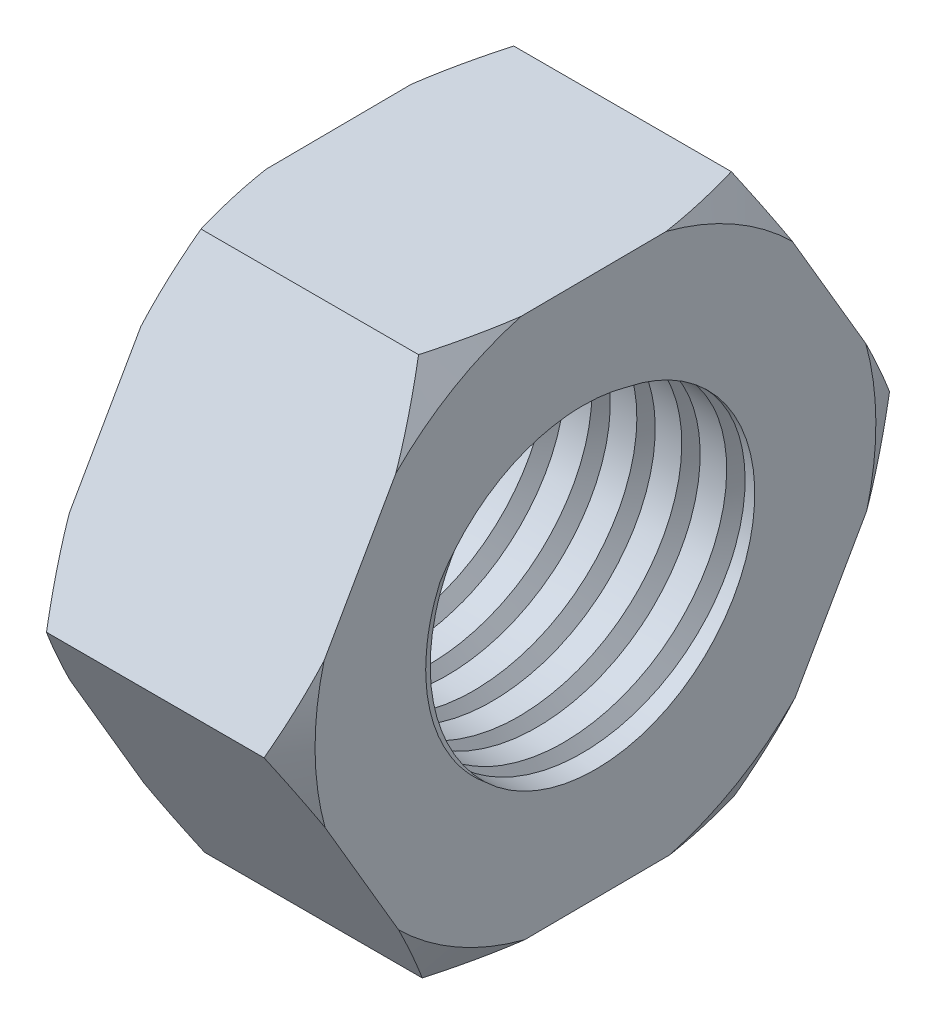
ISO-10303-21;
HEADER;
FILE_DESCRIPTION(('STEP AP214'),'2;1');
FILE_NAME('part.step','',(''),(''),'','','');
FILE_SCHEMA(('AUTOMOTIVE_DESIGN { 1 0 10303 214 1 1 1 1 }'));
ENDSEC;
DATA;
#1=APPLICATION_CONTEXT('core data for automotive mechanical design processes');
#2=APPLICATION_PROTOCOL_DEFINITION('international standard','automotive_design',2000,#1);
#3=PRODUCT_CONTEXT('',#1,'mechanical');
#4=PRODUCT('Part','Part','',(#3));
#5=PRODUCT_RELATED_PRODUCT_CATEGORY('part','',(#4));
#6=PRODUCT_DEFINITION_FORMATION('','',#4);
#7=PRODUCT_DEFINITION_CONTEXT('part definition',#1,'design');
#8=PRODUCT_DEFINITION('design','',#6,#7);
#9=PRODUCT_DEFINITION_SHAPE('','',#8);
#10=(LENGTH_UNIT() NAMED_UNIT(*) SI_UNIT(.MILLI.,.METRE.));
#11=(NAMED_UNIT(*) PLANE_ANGLE_UNIT() SI_UNIT($,.RADIAN.));
#12=(NAMED_UNIT(*) SI_UNIT($,.STERADIAN.) SOLID_ANGLE_UNIT());
#13=UNCERTAINTY_MEASURE_WITH_UNIT(LENGTH_MEASURE(1.E-05),#10,'distance_accuracy_value','');
#14=(GEOMETRIC_REPRESENTATION_CONTEXT(3) GLOBAL_UNCERTAINTY_ASSIGNED_CONTEXT((#13)) GLOBAL_UNIT_ASSIGNED_CONTEXT((#10,
#11,#12)) REPRESENTATION_CONTEXT('',''));
#15=CARTESIAN_POINT('',(0.,0.,0.));
#16=DIRECTION('',(0.,0.,1.));
#17=DIRECTION('',(1.,0.,0.));
#18=AXIS2_PLACEMENT_3D('',#15,#16,#17);
#19=CARTESIAN_POINT('',(8.,8.5332213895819,-4.84948100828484));
#20=DIRECTION('',(1.,0.,0.));
#21=DIRECTION('',(0.,0.,-1.));
#22=AXIS2_PLACEMENT_3D('',#19,#20,#21);
#23=PLANE('',#22);
#24=CARTESIAN_POINT('',(8.00000000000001,2.52481976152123,4.88623425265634));
#25=CARTESIAN_POINT('',(8.,2.38405048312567,4.94657630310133));
#26=CARTESIAN_POINT('',(8.,2.24072980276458,5.00095705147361));
#27=CARTESIAN_POINT('',(8.,1.9500549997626,5.09746647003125));
#28=CARTESIAN_POINT('',(8.,1.80270175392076,5.13959778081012));
#29=CARTESIAN_POINT('',(8.,1.50467271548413,5.21137665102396));
#30=CARTESIAN_POINT('',(8.,1.35399088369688,5.24099915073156));
#31=CARTESIAN_POINT('',(8.,1.0506574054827,5.28743737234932));
#32=CARTESIAN_POINT('',(8.,0.898005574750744,5.3042518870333));
#33=CARTESIAN_POINT('',(8.,0.591710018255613,5.3249490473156));
#34=CARTESIAN_POINT('',(8.,0.438065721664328,5.32882343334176));
#35=CARTESIAN_POINT('',(8.,0.207808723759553,5.32492323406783));
#36=CARTESIAN_POINT('',(8.,0.131085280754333,5.32200392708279));
#37=CARTESIAN_POINT('',(8.,-0.0221685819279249,5.31290530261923));
#38=CARTESIAN_POINT('',(8.,-0.098699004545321,5.30672603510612));
#39=CARTESIAN_POINT('',(8.,-0.327563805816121,5.28305197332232));
#40=CARTESIAN_POINT('',(8.,-0.47939906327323,5.26041789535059));
#41=CARTESIAN_POINT('',(8.,-0.780427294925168,5.20172532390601));
#42=CARTESIAN_POINT('',(8.,-0.92962028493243,5.16566691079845));
#43=CARTESIAN_POINT('',(8.,-1.21938520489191,5.08176961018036));
#44=CARTESIAN_POINT('',(8.,-1.36007956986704,5.03435378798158));
#45=CARTESIAN_POINT('',(8.,-1.63684992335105,4.92755191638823));
#46=CARTESIAN_POINT('',(8.,-1.7729258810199,4.86816578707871));
#47=CARTESIAN_POINT('',(8.,-2.03955253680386,4.73780793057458));
#48=CARTESIAN_POINT('',(8.,-2.17009847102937,4.66682646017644));
#49=CARTESIAN_POINT('',(8.,-2.42456152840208,4.5138454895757));
#50=CARTESIAN_POINT('',(8.,-2.54847894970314,4.43184648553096));
#51=CARTESIAN_POINT('',(8.,-2.78578405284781,4.25960534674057));
#52=CARTESIAN_POINT('',(8.,-2.89935631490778,4.16961711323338));
#53=CARTESIAN_POINT('',(8.,-3.1185283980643,3.98037303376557));
#54=CARTESIAN_POINT('',(8.,-3.22412816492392,3.88111712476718));
#55=CARTESIAN_POINT('',(8.,-3.37591650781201,3.7258697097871));
#56=CARTESIAN_POINT('',(8.,-3.42540608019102,3.67306562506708));
#57=CARTESIAN_POINT('',(8.,-3.52212238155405,3.56544270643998));
#58=CARTESIAN_POINT('',(8.,-3.56934974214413,3.51062444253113));
#59=CARTESIAN_POINT('',(8.,-3.66129329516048,3.39892249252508));
#60=CARTESIAN_POINT('',(8.,-3.70600960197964,3.34203890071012));
#61=CARTESIAN_POINT('',(8.,-3.79285477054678,3.22633021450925));
#62=CARTESIAN_POINT('',(8.,-3.83498344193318,3.16750497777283));
#63=CARTESIAN_POINT('',(7.99999999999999,-3.95602550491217,2.99022866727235));
#64=CARTESIAN_POINT('',(8.,-4.03111280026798,2.86912970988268));
#65=CARTESIAN_POINT('',(8.,-4.17033393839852,2.62078748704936));
#66=CARTESIAN_POINT('',(8.,-4.23446589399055,2.49354316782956));
#67=CARTESIAN_POINT('',(8.,-4.3512498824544,2.2339425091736));
#68=CARTESIAN_POINT('',(8.,-4.40390633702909,2.10158816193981));
#69=CARTESIAN_POINT('',(8.,-4.49733839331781,1.83281094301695));
#70=CARTESIAN_POINT('',(8.,-4.53811820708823,1.69638953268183));
#71=CARTESIAN_POINT('',(8.,-4.6132020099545,1.39778029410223));
#72=CARTESIAN_POINT('',(8.,-4.64533951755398,1.23504327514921));
#73=CARTESIAN_POINT('',(8.,-4.69274620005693,0.907450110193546));
#74=CARTESIAN_POINT('',(8.,-4.70804756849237,0.742598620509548));
#75=CARTESIAN_POINT('',(8.,-4.71481482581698,0.577406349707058));
#76=B_SPLINE_CURVE_WITH_KNOTS('',3,(#24,#25,#26,#27,#28,#29,#30,#31,#32,#33,#34,#35,#36,#37,#38,
#39,#40,#41,#42,#43,#44,#45,#46,#47,#48,#49,#50,#51,#52,#53,#54,#55,#56,#57,#58,#59,#60,#61,#62,
#63,#64,#65,#66,#67,#68,#69,#70,#71,#72,#73,#74,#75),.UNSPECIFIED.,.F.,.F.,(4,2,2,2,2,2,2,2,2,2,
2,2,2,2,2,2,2,2,2,2,2,2,2,2,2,4),(0.,0.459330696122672,0.918562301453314,1.37870960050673,
1.8389002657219,2.29938461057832,2.52966296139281,2.75993778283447,3.2198078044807,
3.67967507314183,4.12452787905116,4.56938365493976,5.01461517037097,5.4598266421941,
5.89403164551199,6.32823960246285,6.54529980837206,6.76229905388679,6.97928840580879,
7.19629370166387,7.62315702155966,8.0500937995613,8.47686577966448,8.9034862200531,
9.40023630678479,9.89603486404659),.UNSPECIFIED.);
#77=CARTESIAN_POINT('',(8.,2.52481976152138,4.88623425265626));
#78=VERTEX_POINT('',#77);
#79=CARTESIAN_POINT('',(8.00000000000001,-3.62047470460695,3.44850154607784));
#80=VERTEX_POINT('',#79);
#81=EDGE_CURVE('E190',#78,#80,#76,.T.);
#82=ORIENTED_EDGE('',*,*,#81,.F.);
#83=CARTESIAN_POINT('',(8.,3.16276949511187,-3.54397602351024));
#84=CARTESIAN_POINT('',(8.,3.21678196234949,-3.50297049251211));
#85=CARTESIAN_POINT('',(8.,3.26985072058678,-3.46073640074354));
#86=CARTESIAN_POINT('',(8.,3.37409642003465,-3.37401917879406));
#87=CARTESIAN_POINT('',(8.,3.42527383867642,-3.32953662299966));
#88=CARTESIAN_POINT('',(8.,3.52575584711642,-3.23851318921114));
#89=CARTESIAN_POINT('',(8.,3.57506058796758,-3.19197247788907));
#90=CARTESIAN_POINT('',(8.,3.67170412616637,-3.09687618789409));
#91=CARTESIAN_POINT('',(8.,3.71904246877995,-3.04832014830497));
#92=CARTESIAN_POINT('',(8.,3.85792952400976,-2.89982369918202));
#93=CARTESIAN_POINT('',(8.,3.94642158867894,-2.79699034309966));
#94=CARTESIAN_POINT('',(8.,4.11461119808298,-2.58432033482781));
#95=CARTESIAN_POINT('',(8.,4.1943051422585,-2.47448084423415));
#96=CARTESIAN_POINT('',(8.,4.34429955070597,-2.24861603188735));
#97=CARTESIAN_POINT('',(8.,4.41460334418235,-2.13259292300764));
#98=CARTESIAN_POINT('',(8.,4.54536480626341,-1.89512517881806));
#99=CARTESIAN_POINT('',(8.,4.60582237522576,-1.77368048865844));
#100=CARTESIAN_POINT('',(8.,4.71644461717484,-1.52627906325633));
#101=CARTESIAN_POINT('',(8.00000000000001,4.76661564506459,-1.40032517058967));
#102=CARTESIAN_POINT('',(7.99999999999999,4.85636944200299,-1.14470843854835));
#103=CARTESIAN_POINT('',(7.99999999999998,4.89595242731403,-1.01504567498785));
#104=CARTESIAN_POINT('',(7.99999999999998,4.96486517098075,-0.750576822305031));
#105=CARTESIAN_POINT('',(8.,4.99400331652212,-0.615720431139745));
#106=CARTESIAN_POINT('',(8.,5.02913086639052,-0.411994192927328));
#107=CARTESIAN_POINT('',(8.,5.03941081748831,-0.343836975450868));
#108=CARTESIAN_POINT('',(8.,5.05709227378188,-0.207145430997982));
#109=CARTESIAN_POINT('',(8.,5.06449378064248,-0.138611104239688));
#110=CARTESIAN_POINT('',(8.,5.076429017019,-0.00124205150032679));
#111=CARTESIAN_POINT('',(8.,5.08096053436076,0.0675928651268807));
#112=CARTESIAN_POINT('',(8.,5.08731949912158,0.205383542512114));
#113=CARTESIAN_POINT('',(8.,5.08914691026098,0.274339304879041));
#114=CARTESIAN_POINT('',(8.,5.09051403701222,0.481239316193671));
#115=CARTESIAN_POINT('',(8.,5.08594019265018,0.619234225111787));
#116=CARTESIAN_POINT('',(8.,5.06559195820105,0.898221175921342));
#117=CARTESIAN_POINT('',(8.,5.0495111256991,1.03919048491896));
#118=CARTESIAN_POINT('',(8.,5.00591402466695,1.31934500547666));
#119=CARTESIAN_POINT('',(8.,4.97839843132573,1.45853032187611));
#120=CARTESIAN_POINT('',(8.,4.91213713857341,1.73410742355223));
#121=CARTESIAN_POINT('',(8.,4.87339857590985,1.8705009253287));
#122=CARTESIAN_POINT('',(8.,4.78494290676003,2.13968126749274));
#123=CARTESIAN_POINT('',(8.,4.73522562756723,2.27246805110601));
#124=CARTESIAN_POINT('',(8.,4.62326724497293,2.53800210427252));
#125=CARTESIAN_POINT('',(8.,4.56065737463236,2.67059410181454));
#126=CARTESIAN_POINT('',(8.,4.42450758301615,2.93002883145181));
#127=CARTESIAN_POINT('',(8.,4.35096806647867,3.05687177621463));
#128=CARTESIAN_POINT('',(8.,4.19339636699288,3.30403936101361));
#129=CARTESIAN_POINT('',(8.,4.10935527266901,3.42435833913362));
#130=CARTESIAN_POINT('',(8.,3.97595531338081,3.59919060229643));
#131=CARTESIAN_POINT('',(8.,3.93026019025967,3.656532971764));
#132=CARTESIAN_POINT('',(8.,3.83648314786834,3.76923246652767));
#133=CARTESIAN_POINT('',(8.,3.7884012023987,3.82458957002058));
#134=CARTESIAN_POINT('',(8.,3.65068220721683,3.97692538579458));
#135=CARTESIAN_POINT('',(8.,3.55861207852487,4.07172167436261));
#136=CARTESIAN_POINT('',(8.,3.3679227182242,4.25444965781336));
#137=CARTESIAN_POINT('',(8.,3.26930406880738,4.34238196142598));
#138=CARTESIAN_POINT('',(8.,3.06619104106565,4.5108032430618));
#139=CARTESIAN_POINT('',(8.,2.96170719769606,4.59130492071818));
#140=CARTESIAN_POINT('',(8.,2.74724700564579,4.74463061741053));
#141=CARTESIAN_POINT('',(8.,2.63727053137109,4.81745446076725));
#142=CARTESIAN_POINT('',(8.00000000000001,2.52481976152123,4.88623425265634));
#143=B_SPLINE_CURVE_WITH_KNOTS('',3,(#83,#84,#85,#86,#87,#88,#89,#90,#91,#92,#93,#94,#95,#96,
#97,#98,#99,#100,#101,#102,#103,#104,#105,#106,#107,#108,#109,#110,#111,#112,#113,#114,#115,
#116,#117,#118,#119,#120,#121,#122,#123,#124,#125,#126,#127,#128,#129,#130,#131,#132,#133,#134,
#135,#136,#137,#138,#139,#140,#141,#142),.UNSPECIFIED.,.F.,.F.,(4,2,2,2,2,2,2,2,2,2,2,2,2,2,2,2,
2,2,2,2,2,2,2,2,2,2,2,2,2,4),(0.,0.203412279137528,0.406772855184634,0.610116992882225,
0.813507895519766,1.22000186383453,1.62666157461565,2.03317672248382,2.43969598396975,
2.8459633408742,3.25222239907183,3.66559305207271,3.87232758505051,4.07906199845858,
4.28595556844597,4.49285191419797,4.90659075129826,5.33177869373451,5.75694153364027,
6.18183460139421,6.60673435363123,7.04610068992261,7.48545075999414,7.92517621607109,
8.14508721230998,8.36500062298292,8.76108411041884,9.15713243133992,9.55249082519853,
9.94785826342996),.UNSPECIFIED.);
#144=CARTESIAN_POINT('',(8.,4.90052891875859,-0.992379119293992));
#145=VERTEX_POINT('',#144);
#146=EDGE_CURVE('E178',#145,#78,#143,.T.);
#147=ORIENTED_EDGE('',*,*,#146,.F.);
#148=CARTESIAN_POINT('',(8.,0.,0.));
#149=DIRECTION('',(1.,0.,0.));
#150=DIRECTION('',(0.,0.,-1.));
#151=AXIS2_PLACEMENT_3D('',#148,#149,#150);
#152=CIRCLE('',#151,5.);
#153=EDGE_CURVE('E196',#80,#145,#152,.T.);
#154=ORIENTED_EDGE('',*,*,#153,.F.);
#155=EDGE_LOOP('',(#82,#147,#154));
#156=FACE_BOUND('',#155,.T.);
#157=CARTESIAN_POINT('',(8.,0.,0.));
#158=DIRECTION('',(1.,0.,0.));
#159=DIRECTION('',(0.,0.,-1.));
#160=AXIS2_PLACEMENT_3D('',#157,#158,#159);
#161=CIRCLE('',#160,8.8);
#162=CARTESIAN_POINT('',(8.,-8.4842893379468,-2.33598682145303));
#163=VERTEX_POINT('',#162);
#164=CARTESIAN_POINT('',(8.,-6.18042675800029,-6.26436948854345));
#165=VERTEX_POINT('',#164);
#166=EDGE_CURVE('E200',#163,#165,#161,.T.);
#167=ORIENTED_EDGE('',*,*,#166,.T.);
#168=DIRECTION('',(0.,0.869410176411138,-0.49409102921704));
#169=VECTOR('',#168,1.);
#170=CARTESIAN_POINT('',(8.,-8.4663844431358,-4.96524599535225));
#171=LINE('',#170,#169);
#172=CARTESIAN_POINT('',(8.,-2.2191207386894,-8.5156035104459));
#173=VERTEX_POINT('',#172);
#174=EDGE_CURVE('E333',#165,#173,#171,.T.);
#175=ORIENTED_EDGE('',*,*,#174,.T.);
#176=CARTESIAN_POINT('',(8.,2.33488973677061,-8.48459132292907));
#177=VERTEX_POINT('',#176);
#178=EDGE_CURVE('E197',#173,#177,#161,.T.);
#179=ORIENTED_EDGE('',*,*,#178,.T.);
#180=DIRECTION('',(0.,0.862600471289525,0.505885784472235));
#181=VECTOR('',#180,1.);
#182=CARTESIAN_POINT('',(8.,0.0668369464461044,-9.81472700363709));
#183=LINE('',#182,#181);
#184=CARTESIAN_POINT('',(8.,6.26516859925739,-6.17961668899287));
#185=VERTEX_POINT('',#184);
#186=EDGE_CURVE('E317',#177,#185,#183,.T.);
#187=ORIENTED_EDGE('',*,*,#186,.T.);
#188=CARTESIAN_POINT('',(8.,8.5153164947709,-2.22022183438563));
#189=VERTEX_POINT('',#188);
#190=EDGE_CURVE('E202',#185,#189,#161,.T.);
#191=ORIENTED_EDGE('',*,*,#190,.T.);
#192=DIRECTION('',(0.,-0.00680970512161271,0.999976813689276));
#193=VECTOR('',#192,1.);
#194=CARTESIAN_POINT('',(8.,8.5332213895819,-4.84948100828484));
#195=LINE('',#194,#193);
#196=CARTESIAN_POINT('',(8.,8.4842893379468,2.33598682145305));
#197=VERTEX_POINT('',#196);
#198=EDGE_CURVE('E320',#189,#197,#195,.T.);
#199=ORIENTED_EDGE('',*,*,#198,.T.);
#200=CARTESIAN_POINT('',(8.,6.1804267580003,6.26436948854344));
#201=VERTEX_POINT('',#200);
#202=EDGE_CURVE('E647',#197,#201,#161,.T.);
#203=ORIENTED_EDGE('',*,*,#202,.T.);
#204=DIRECTION('',(0.,-0.869410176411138,0.49409102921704));
#205=VECTOR('',#204,1.);
#206=CARTESIAN_POINT('',(8.,8.46638444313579,4.96524599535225));
#207=LINE('',#206,#205);
#208=CARTESIAN_POINT('',(8.,2.21912073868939,8.51560351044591));
#209=VERTEX_POINT('',#208);
#210=EDGE_CURVE('E324',#201,#209,#207,.T.);
#211=ORIENTED_EDGE('',*,*,#210,.T.);
#212=CARTESIAN_POINT('',(8.,-2.33488973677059,8.48459132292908));
#213=VERTEX_POINT('',#212);
#214=EDGE_CURVE('E645',#209,#213,#161,.T.);
#215=ORIENTED_EDGE('',*,*,#214,.T.);
#216=DIRECTION('',(0.,-0.862600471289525,-0.505885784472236));
#217=VECTOR('',#216,1.);
#218=CARTESIAN_POINT('',(8.,-0.0668369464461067,9.81472700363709));
#219=LINE('',#218,#217);
#220=CARTESIAN_POINT('',(8.,-6.26516859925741,6.17961668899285));
#221=VERTEX_POINT('',#220);
#222=EDGE_CURVE('E327',#213,#221,#219,.T.);
#223=ORIENTED_EDGE('',*,*,#222,.T.);
#224=CARTESIAN_POINT('',(8.,-8.5153164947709,2.22022183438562));
#225=VERTEX_POINT('',#224);
#226=EDGE_CURVE('E644',#221,#225,#161,.T.);
#227=ORIENTED_EDGE('',*,*,#226,.T.);
#228=DIRECTION('',(0.,0.00680970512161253,-0.999976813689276));
#229=VECTOR('',#228,1.);
#230=CARTESIAN_POINT('',(8.,-8.5332213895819,4.84948100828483));
#231=LINE('',#230,#229);
#232=EDGE_CURVE('E330',#225,#163,#231,.T.);
#233=ORIENTED_EDGE('',*,*,#232,.T.);
#234=EDGE_LOOP('',(#167,#175,#179,#187,#191,#199,#203,#211,#215,#223,#227,#233));
#235=FACE_BOUND('',#234,.T.);
#236=ADVANCED_FACE('F33',(#156,#235),#23,.T.);
#237=CARTESIAN_POINT('',(0.,8.5332213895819,-4.84948100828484));
#238=DIRECTION('',(1.,0.,0.));
#239=DIRECTION('',(0.,0.,-1.));
#240=AXIS2_PLACEMENT_3D('',#237,#238,#239);
#241=PLANE('',#240);
#242=CARTESIAN_POINT('',(0.,0.,0.));
#243=DIRECTION('',(1.,0.,0.));
#244=DIRECTION('',(0.,0.,-1.));
#245=AXIS2_PLACEMENT_3D('',#242,#243,#244);
#246=CIRCLE('',#245,5.5);
#247=CARTESIAN_POINT('',(0.,-5.5,1.74895908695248E-13));
#248=VERTEX_POINT('',#247);
#249=EDGE_CURVE('E615',#248,#248,#246,.T.);
#250=ORIENTED_EDGE('',*,*,#249,.T.);
#251=EDGE_LOOP('',(#250));
#252=FACE_BOUND('',#251,.T.);
#253=DIRECTION('',(0.,0.869410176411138,-0.49409102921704));
#254=VECTOR('',#253,1.);
#255=CARTESIAN_POINT('',(0.,-8.4663844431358,-4.96524599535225));
#256=LINE('',#255,#254);
#257=CARTESIAN_POINT('',(0.,-6.18042675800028,-6.26436948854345));
#258=VERTEX_POINT('',#257);
#259=CARTESIAN_POINT('',(0.,-2.21912073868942,-8.5156035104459));
#260=VERTEX_POINT('',#259);
#261=EDGE_CURVE('E321',#258,#260,#256,.T.);
#262=ORIENTED_EDGE('',*,*,#261,.F.);
#263=CARTESIAN_POINT('',(0.,0.,0.));
#264=DIRECTION('',(1.,0.,0.));
#265=DIRECTION('',(0.,0.,-1.));
#266=AXIS2_PLACEMENT_3D('',#263,#264,#265);
#267=CIRCLE('',#266,8.8);
#268=CARTESIAN_POINT('',(0.,-8.4842893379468,-2.33598682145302));
#269=VERTEX_POINT('',#268);
#270=EDGE_CURVE('E587',#269,#258,#267,.T.);
#271=ORIENTED_EDGE('',*,*,#270,.F.);
#272=DIRECTION('',(0.,0.00680970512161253,-0.999976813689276));
#273=VECTOR('',#272,1.);
#274=CARTESIAN_POINT('',(0.,-8.5332213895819,4.84948100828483));
#275=LINE('',#274,#273);
#276=CARTESIAN_POINT('',(0.,-8.5153164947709,2.22022183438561));
#277=VERTEX_POINT('',#276);
#278=EDGE_CURVE('E348',#277,#269,#275,.T.);
#279=ORIENTED_EDGE('',*,*,#278,.F.);
#280=CARTESIAN_POINT('',(0.,-6.2651685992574,6.17961668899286));
#281=VERTEX_POINT('',#280);
#282=EDGE_CURVE('E575',#281,#277,#267,.T.);
#283=ORIENTED_EDGE('',*,*,#282,.F.);
#284=DIRECTION('',(0.,-0.862600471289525,-0.505885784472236));
#285=VECTOR('',#284,1.);
#286=CARTESIAN_POINT('',(0.,-0.0668369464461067,9.81472700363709));
#287=LINE('',#286,#285);
#288=CARTESIAN_POINT('',(0.,-2.33488973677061,8.48459132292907));
#289=VERTEX_POINT('',#288);
#290=EDGE_CURVE('E345',#289,#281,#287,.T.);
#291=ORIENTED_EDGE('',*,*,#290,.F.);
#292=CARTESIAN_POINT('',(0.,2.2191207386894,8.5156035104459));
#293=VERTEX_POINT('',#292);
#294=EDGE_CURVE('E585',#293,#289,#267,.T.);
#295=ORIENTED_EDGE('',*,*,#294,.F.);
#296=DIRECTION('',(0.,-0.869410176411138,0.49409102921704));
#297=VECTOR('',#296,1.);
#298=CARTESIAN_POINT('',(0.,8.46638444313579,4.96524599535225));
#299=LINE('',#298,#297);
#300=CARTESIAN_POINT('',(0.,6.18042675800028,6.26436948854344));
#301=VERTEX_POINT('',#300);
#302=EDGE_CURVE('E342',#301,#293,#299,.T.);
#303=ORIENTED_EDGE('',*,*,#302,.F.);
#304=CARTESIAN_POINT('',(0.,8.4842893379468,2.33598682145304));
#305=VERTEX_POINT('',#304);
#306=EDGE_CURVE('E588',#305,#301,#267,.T.);
#307=ORIENTED_EDGE('',*,*,#306,.F.);
#308=DIRECTION('',(0.,-0.00680970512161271,0.999976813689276));
#309=VECTOR('',#308,1.);
#310=CARTESIAN_POINT('',(0.,8.5332213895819,-4.84948100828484));
#311=LINE('',#310,#309);
#312=CARTESIAN_POINT('',(0.,8.5153164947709,-2.22022183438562));
#313=VERTEX_POINT('',#312);
#314=EDGE_CURVE('E339',#313,#305,#311,.T.);
#315=ORIENTED_EDGE('',*,*,#314,.F.);
#316=CARTESIAN_POINT('',(0.,6.26516859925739,-6.17961668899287));
#317=VERTEX_POINT('',#316);
#318=EDGE_CURVE('E393',#317,#313,#267,.T.);
#319=ORIENTED_EDGE('',*,*,#318,.F.);
#320=DIRECTION('',(0.,0.862600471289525,0.505885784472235));
#321=VECTOR('',#320,1.);
#322=CARTESIAN_POINT('',(0.,0.0668369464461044,-9.81472700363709));
#323=LINE('',#322,#321);
#324=CARTESIAN_POINT('',(0.,2.33488973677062,-8.48459132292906));
#325=VERTEX_POINT('',#324);
#326=EDGE_CURVE('E315',#325,#317,#323,.T.);
#327=ORIENTED_EDGE('',*,*,#326,.F.);
#328=EDGE_CURVE('E394',#260,#325,#267,.T.);
#329=ORIENTED_EDGE('',*,*,#328,.F.);
#330=EDGE_LOOP('',(#262,#271,#279,#283,#291,#295,#303,#307,#315,#319,#327,#329));
#331=FACE_BOUND('',#330,.T.);
#332=ADVANCED_FACE('F375',(#252,#331),#241,.F.);
#333=CARTESIAN_POINT('',(8.,0.0668369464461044,-9.81472700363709));
#334=DIRECTION('',(0.,-0.505885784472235,0.862600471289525));
#335=DIRECTION('',(0.,-0.862600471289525,-0.505885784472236));
#336=AXIS2_PLACEMENT_3D('',#333,#334,#335);
#337=PLANE('',#336);
#338=DIRECTION('',(-1.,0.,0.));
#339=VECTOR('',#338,1.);
#340=CARTESIAN_POINT('',(8.,8.5332213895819,-4.84948100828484));
#341=LINE('',#340,#339);
#342=CARTESIAN_POINT('',(7.41401570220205,8.5332213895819,-4.84948100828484));
#343=VERTEX_POINT('',#342);
#344=CARTESIAN_POINT('',(0.585984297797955,8.5332213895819,-4.84948100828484));
#345=VERTEX_POINT('',#344);
#346=EDGE_CURVE('E362',#343,#345,#341,.T.);
#347=ORIENTED_EDGE('',*,*,#346,.F.);
#348=CARTESIAN_POINT('',(4.69298075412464,14.4630082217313,-1.37186308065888));
#349=CARTESIAN_POINT('',(4.83750811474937,14.1966872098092,-1.52805127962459));
#350=CARTESIAN_POINT('',(4.98049318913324,13.9297338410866,-1.68461033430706));
#351=CARTESIAN_POINT('',(5.2626553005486,13.3942957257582,-1.99862654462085));
#352=CARTESIAN_POINT('',(5.40183186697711,13.1258107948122,-2.15608380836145));
#353=CARTESIAN_POINT('',(5.67604976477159,12.5862579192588,-2.47251318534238));
#354=CARTESIAN_POINT('',(5.81107665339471,12.3151844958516,-2.63148851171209));
#355=CARTESIAN_POINT('',(6.07554073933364,11.7710206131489,-2.95062208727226));
#356=CARTESIAN_POINT('',(6.20497811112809,11.4979302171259,-3.11078029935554));
#357=CARTESIAN_POINT('',(6.46031899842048,10.9422714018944,-3.43665526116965));
#358=CARTESIAN_POINT('',(6.58604288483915,10.6596412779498,-3.60240819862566));
#359=CARTESIAN_POINT('',(6.82865054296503,10.0915428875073,-3.9355785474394));
#360=CARTESIAN_POINT('',(6.94553388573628,9.80607448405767,-4.10299603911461));
#361=CARTESIAN_POINT('',(7.16826217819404,9.23222418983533,-4.43953968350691));
#362=CARTESIAN_POINT('',(7.27411756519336,8.94384534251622,-4.60866405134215));
#363=CARTESIAN_POINT('',(7.47237099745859,8.36370200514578,-4.94889835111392));
#364=CARTESIAN_POINT('',(7.56477076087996,8.07193795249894,-5.12000802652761));
#365=CARTESIAN_POINT('',(7.76470959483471,7.37491896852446,-5.52878591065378));
#366=CARTESIAN_POINT('',(7.86497741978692,6.96804639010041,-5.76740281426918));
#367=CARTESIAN_POINT('',(7.98605670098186,6.35352724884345,-6.12779735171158));
#368=CARTESIAN_POINT('',(8.02152840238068,6.14799562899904,-6.24833464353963));
#369=CARTESIAN_POINT('',(8.08181724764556,5.73575553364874,-6.49009941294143));
#370=CARTESIAN_POINT('',(8.10663447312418,5.5290470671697,-6.61132688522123));
#371=CARTESIAN_POINT('',(8.14467837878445,5.1172830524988,-6.85281244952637));
#372=CARTESIAN_POINT('',(8.15803808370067,4.91223669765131,-6.97306514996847));
#373=CARTESIAN_POINT('',(8.17326219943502,4.50182655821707,-7.21375671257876));
#374=CARTESIAN_POINT('',(8.17512679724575,4.29646277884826,-7.33419557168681));
#375=CARTESIAN_POINT('',(8.16730238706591,3.88589183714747,-7.57498143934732));
#376=CARTESIAN_POINT('',(8.15761293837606,3.68068468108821,-7.69532844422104));
#377=CARTESIAN_POINT('',(8.12697556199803,3.2708977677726,-7.93565450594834));
#378=CARTESIAN_POINT('',(8.10602713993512,3.06631803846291,-8.05563354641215));
#379=CARTESIAN_POINT('',(8.04404973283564,2.58514595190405,-8.33782457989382));
#380=CARTESIAN_POINT('',(7.99851749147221,2.3089818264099,-8.49978542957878));
#381=CARTESIAN_POINT('',(7.88988461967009,1.75923900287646,-8.82219086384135));
#382=CARTESIAN_POINT('',(7.8267811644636,1.48566072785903,-8.98263520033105));
#383=CARTESIAN_POINT('',(7.68539312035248,0.941180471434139,-9.30195431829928));
#384=CARTESIAN_POINT('',(7.60709333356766,0.670281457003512,-9.46082735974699));
#385=CARTESIAN_POINT('',(7.43777540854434,0.131494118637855,-9.77680777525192));
#386=CARTESIAN_POINT('',(7.34675763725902,-0.136394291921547,-9.9339152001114));
#387=CARTESIAN_POINT('',(7.15303768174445,-0.672482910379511,-10.2483129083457));
#388=CARTESIAN_POINT('',(7.05020952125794,-0.940649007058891,-10.4055831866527));
#389=CARTESIAN_POINT('',(6.83568510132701,-1.47431562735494,-10.7185604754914));
#390=CARTESIAN_POINT('',(6.72398876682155,-1.73981612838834,-10.8742674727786));
#391=CARTESIAN_POINT('',(6.49337531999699,-2.26830721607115,-11.1842094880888));
#392=CARTESIAN_POINT('',(6.37446193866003,-2.53129901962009,-11.3384452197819));
#393=CARTESIAN_POINT('',(6.13065154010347,-3.05519761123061,-11.6456938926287));
#394=CARTESIAN_POINT('',(6.0057546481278,-3.31610444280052,-11.7987068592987));
#395=CARTESIAN_POINT('',(5.78363541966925,-3.76950420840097,-12.0646103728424));
#396=CARTESIAN_POINT('',(5.68751936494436,-3.96240202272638,-12.1777383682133));
#397=CARTESIAN_POINT('',(5.49289767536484,-4.34728969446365,-12.4034618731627));
#398=CARTESIAN_POINT('',(5.39439212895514,-4.53927958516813,-12.5160574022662));
#399=CARTESIAN_POINT('',(5.196416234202,-4.92028357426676,-12.7395032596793));
#400=CARTESIAN_POINT('',(5.09696938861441,-5.10930677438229,-12.8503589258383));
#401=CARTESIAN_POINT('',(4.8962695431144,-5.48664266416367,-13.0716535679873));
#402=CARTESIAN_POINT('',(4.79501651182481,-5.67495534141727,-13.1820925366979));
#403=CARTESIAN_POINT('',(4.69298075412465,-5.86294988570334,-13.2923449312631));
#404=B_SPLINE_CURVE_WITH_KNOTS('',3,(#348,#349,#350,#351,#352,#353,#354,#355,#356,#357,#358,
#359,#360,#361,#362,#363,#364,#365,#366,#367,#368,#369,#370,#371,#372,#373,#374,#375,#376,#377,
#378,#379,#380,#381,#382,#383,#384,#385,#386,#387,#388,#389,#390,#391,#392,#393,#394,#395,#396,
#397,#398,#399,#400,#401,#402,#403),.UNSPECIFIED.,.F.,.F.,(4,2,2,2,2,2,2,2,2,2,2,2,2,2,2,2,2,2,
2,2,2,2,2,2,2,2,2,4),(0.,1.02269745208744,2.0455207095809,3.07157315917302,4.09759355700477,
5.15031538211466,6.20308825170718,7.25485550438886,8.30648833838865,9.75160398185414,
10.4740935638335,11.1965776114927,11.9105552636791,12.6245213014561,13.3385145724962,
14.0525391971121,15.0220790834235,15.9917749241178,16.9624456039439,17.9330882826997,
18.9152633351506,19.8974467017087,20.8791265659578,21.8607858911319,22.5909855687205,
23.3211582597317,24.0430748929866,24.7650040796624),.UNSPECIFIED.);
#405=EDGE_CURVE('E60',#343,#185,#404,.T.);
#406=ORIENTED_EDGE('',*,*,#405,.T.);
#407=ORIENTED_EDGE('',*,*,#186,.F.);
#408=CARTESIAN_POINT('',(7.41401570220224,0.0668369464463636,-9.81472700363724));
#409=VERTEX_POINT('',#408);
#410=EDGE_CURVE('E258',#177,#409,#404,.T.);
#411=ORIENTED_EDGE('',*,*,#410,.T.);
#412=DIRECTION('',(-1.,0.,0.));
#413=VECTOR('',#412,1.);
#414=CARTESIAN_POINT('',(8.,0.0668369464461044,-9.81472700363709));
#415=LINE('',#414,#413);
#416=CARTESIAN_POINT('',(0.585984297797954,0.0668369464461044,-9.81472700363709));
#417=VERTEX_POINT('',#416);
#418=EDGE_CURVE('E336',#409,#417,#415,.T.);
#419=ORIENTED_EDGE('',*,*,#418,.T.);
#420=CARTESIAN_POINT('',(3.30701924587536,-5.86294988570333,-13.292344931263));
#421=CARTESIAN_POINT('',(3.16249188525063,-5.59662887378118,-13.1361567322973));
#422=CARTESIAN_POINT('',(3.01950681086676,-5.32967550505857,-12.9795976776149));
#423=CARTESIAN_POINT('',(2.7373446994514,-4.7942373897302,-12.6655814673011));
#424=CARTESIAN_POINT('',(2.59816813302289,-4.52575245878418,-12.5081242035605));
#425=CARTESIAN_POINT('',(2.32395023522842,-3.98619958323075,-12.1916948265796));
#426=CARTESIAN_POINT('',(2.18892334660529,-3.71512615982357,-12.0327195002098));
#427=CARTESIAN_POINT('',(1.92445926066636,-3.17096227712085,-11.7135859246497));
#428=CARTESIAN_POINT('',(1.79502188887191,-2.89787188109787,-11.5534277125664));
#429=CARTESIAN_POINT('',(1.53968100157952,-2.34221306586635,-11.2275527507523));
#430=CARTESIAN_POINT('',(1.41395711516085,-2.05958294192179,-11.0617998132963));
#431=CARTESIAN_POINT('',(1.17134945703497,-1.49148455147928,-10.7286294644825));
#432=CARTESIAN_POINT('',(1.05446611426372,-1.20601614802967,-10.5612119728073));
#433=CARTESIAN_POINT('',(0.83173782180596,-0.632165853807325,-10.224668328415));
#434=CARTESIAN_POINT('',(0.725882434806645,-0.343787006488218,-10.0555439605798));
#435=CARTESIAN_POINT('',(0.527629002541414,0.236356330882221,-9.71530966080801));
#436=CARTESIAN_POINT('',(0.435229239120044,0.528120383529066,-9.54419998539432));
#437=CARTESIAN_POINT('',(0.235290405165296,1.22513936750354,-9.13542210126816));
#438=CARTESIAN_POINT('',(0.135022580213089,1.63201194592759,-8.89680519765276));
#439=CARTESIAN_POINT('',(0.0139432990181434,2.24653108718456,-8.53641066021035));
#440=CARTESIAN_POINT('',(-0.0215284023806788,2.45206270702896,-8.41587336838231));
#441=CARTESIAN_POINT('',(-0.0818172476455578,2.86430280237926,-8.17410859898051));
#442=CARTESIAN_POINT('',(-0.106634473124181,3.0710112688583,-8.0528811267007));
#443=CARTESIAN_POINT('',(-0.144678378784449,3.4827752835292,-7.81139556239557));
#444=CARTESIAN_POINT('',(-0.158038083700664,3.68782163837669,-7.69114286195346));
#445=CARTESIAN_POINT('',(-0.173262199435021,4.09823177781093,-7.45045129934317));
#446=CARTESIAN_POINT('',(-0.17512679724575,4.30359555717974,-7.33001244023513));
#447=CARTESIAN_POINT('',(-0.167302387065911,4.71416649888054,-7.08922657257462));
#448=CARTESIAN_POINT('',(-0.157612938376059,4.91937365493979,-6.9688795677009));
#449=CARTESIAN_POINT('',(-0.126975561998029,5.32916056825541,-6.7285535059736));
#450=CARTESIAN_POINT('',(-0.106027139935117,5.5337402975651,-6.60857446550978));
#451=CARTESIAN_POINT('',(-0.0440497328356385,6.01491238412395,-6.32638343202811));
#452=CARTESIAN_POINT('',(0.00148250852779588,6.29107650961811,-6.16442258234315));
#453=CARTESIAN_POINT('',(0.11011538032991,6.84081933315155,-5.84201714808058));
#454=CARTESIAN_POINT('',(0.173218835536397,7.11439760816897,-5.68157281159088));
#455=CARTESIAN_POINT('',(0.314606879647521,7.65887786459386,-5.36225369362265));
#456=CARTESIAN_POINT('',(0.392906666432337,7.92977687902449,-5.20338065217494));
#457=CARTESIAN_POINT('',(0.562224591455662,8.46856421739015,-4.88740023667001));
#458=CARTESIAN_POINT('',(0.653242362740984,8.73645262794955,-4.73029281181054));
#459=CARTESIAN_POINT('',(0.846962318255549,9.27254124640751,-4.41589510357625));
#460=CARTESIAN_POINT('',(0.949790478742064,9.54070734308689,-4.25862482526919));
#461=CARTESIAN_POINT('',(1.16431489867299,10.0743739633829,-3.94564753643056));
#462=CARTESIAN_POINT('',(1.27601123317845,10.3398744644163,-3.78994053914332));
#463=CARTESIAN_POINT('',(1.50662468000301,10.8683655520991,-3.47999852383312));
#464=CARTESIAN_POINT('',(1.62553806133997,11.1313573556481,-3.32576279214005));
#465=CARTESIAN_POINT('',(1.86934845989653,11.6552559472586,-3.01851411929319));
#466=CARTESIAN_POINT('',(1.9942453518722,11.9161627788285,-2.86550115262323));
#467=CARTESIAN_POINT('',(2.21636458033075,12.369562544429,-2.59959763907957));
#468=CARTESIAN_POINT('',(2.31248063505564,12.5624603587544,-2.48646964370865));
#469=CARTESIAN_POINT('',(2.50710232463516,12.9473480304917,-2.26074613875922));
#470=CARTESIAN_POINT('',(2.60560787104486,13.1393379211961,-2.14815060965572));
#471=CARTESIAN_POINT('',(2.803583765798,13.5203419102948,-1.92470475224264));
#472=CARTESIAN_POINT('',(2.9030306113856,13.7093651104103,-1.8138490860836));
#473=CARTESIAN_POINT('',(3.1037304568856,14.0867010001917,-1.5925544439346));
#474=CARTESIAN_POINT('',(3.20498348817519,14.2750136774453,-1.48211547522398));
#475=CARTESIAN_POINT('',(3.30701924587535,14.4630082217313,-1.37186308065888));
#476=B_SPLINE_CURVE_WITH_KNOTS('',3,(#420,#421,#422,#423,#424,#425,#426,#427,#428,#429,#430,
#431,#432,#433,#434,#435,#436,#437,#438,#439,#440,#441,#442,#443,#444,#445,#446,#447,#448,#449,
#450,#451,#452,#453,#454,#455,#456,#457,#458,#459,#460,#461,#462,#463,#464,#465,#466,#467,#468,
#469,#470,#471,#472,#473,#474,#475),.UNSPECIFIED.,.F.,.F.,(4,2,2,2,2,2,2,2,2,2,2,2,2,2,2,2,2,2,
2,2,2,2,2,2,2,2,2,4),(0.,1.02269745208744,2.0455207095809,3.07157315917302,4.09759355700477,
5.15031538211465,6.20308825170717,7.25485550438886,8.30648833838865,9.75160398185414,
10.4740935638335,11.1965776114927,11.9105552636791,12.6245213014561,13.3385145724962,
14.0525391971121,15.0220790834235,15.9917749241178,16.9624456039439,17.9330882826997,
18.9152633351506,19.8974467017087,20.8791265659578,21.8607858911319,22.5909855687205,
23.3211582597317,24.0430748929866,24.7650040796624),.UNSPECIFIED.);
#477=EDGE_CURVE('E388',#417,#325,#476,.T.);
#478=ORIENTED_EDGE('',*,*,#477,.T.);
#479=ORIENTED_EDGE('',*,*,#326,.T.);
#480=EDGE_CURVE('E316',#317,#345,#476,.T.);
#481=ORIENTED_EDGE('',*,*,#480,.T.);
#482=EDGE_LOOP('',(#347,#406,#407,#411,#419,#478,#479,#481));
#483=FACE_BOUND('',#482,.T.);
#484=ADVANCED_FACE('F395',(#483),#337,.F.);
#485=CARTESIAN_POINT('',(8.,8.5332213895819,-4.84948100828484));
#486=DIRECTION('',(0.,-0.999976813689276,-0.00680970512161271));
#487=DIRECTION('',(0.,0.00680970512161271,-0.999976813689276));
#488=AXIS2_PLACEMENT_3D('',#485,#486,#487);
#489=PLANE('',#488);
#490=DIRECTION('',(-1.,0.,0.));
#491=VECTOR('',#490,1.);
#492=CARTESIAN_POINT('',(8.,8.46638444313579,4.96524599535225));
#493=LINE('',#492,#491);
#494=CARTESIAN_POINT('',(7.41401570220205,8.46638444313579,4.96524599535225));
#495=VERTEX_POINT('',#494);
#496=CARTESIAN_POINT('',(0.585984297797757,8.46638444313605,4.9652459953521));
#497=VERTEX_POINT('',#496);
#498=EDGE_CURVE('E360',#495,#497,#493,.T.);
#499=ORIENTED_EDGE('',*,*,#498,.F.);
#500=CARTESIAN_POINT('',(5.12875862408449,8.42600340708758,10.8950328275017));
#501=CARTESIAN_POINT('',(5.26828849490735,8.42809549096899,10.5878190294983));
#502=CARTESIAN_POINT('',(5.4060099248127,8.4301932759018,10.2797680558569));
#503=CARTESIAN_POINT('',(5.67695884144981,8.43440269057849,9.66163305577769));
#504=CARTESIAN_POINT('',(5.81018552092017,8.43651432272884,9.35154867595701));
#505=CARTESIAN_POINT('',(6.07175820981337,8.44076191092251,8.72780805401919));
#506=CARTESIAN_POINT('',(6.20008170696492,8.44289793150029,8.41414233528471));
#507=CARTESIAN_POINT('',(6.45005011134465,8.44718797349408,7.78416754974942));
#508=CARTESIAN_POINT('',(6.57169532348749,8.44934199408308,7.46785860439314));
#509=CARTESIAN_POINT('',(6.80631634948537,8.45366142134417,6.83356871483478));
#510=CARTESIAN_POINT('',(6.91932710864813,8.45582673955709,6.51560076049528));
#511=CARTESIAN_POINT('',(7.13543050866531,8.46018048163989,5.87627188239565));
#512=CARTESIAN_POINT('',(7.23852265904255,8.46236890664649,5.55491079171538));
#513=CARTESIAN_POINT('',(7.43243781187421,8.46676777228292,4.90895570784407));
#514=CARTESIAN_POINT('',(7.52327724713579,8.46897817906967,4.58436668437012));
#515=CARTESIAN_POINT('',(7.69028325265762,8.473424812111,3.93139715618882));
#516=CARTESIAN_POINT('',(7.76645045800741,8.47566103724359,3.60301681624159));
#517=CARTESIAN_POINT('',(7.88218483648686,8.47951955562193,3.03640947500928));
#518=CARTESIAN_POINT('',(7.9260040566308,8.48113593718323,2.79905057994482));
#519=CARTESIAN_POINT('',(8.00368781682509,8.48437959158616,2.32273345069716));
#520=CARTESIAN_POINT('',(8.03755399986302,8.48600686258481,2.08377548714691));
#521=CARTESIAN_POINT('',(8.09445060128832,8.48926992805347,1.6046079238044));
#522=CARTESIAN_POINT('',(8.11748303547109,8.49090572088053,1.3643985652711));
#523=CARTESIAN_POINT('',(8.15205513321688,8.49418297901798,0.88314686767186));
#524=CARTESIAN_POINT('',(8.16359482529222,8.49582444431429,0.642104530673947));
#525=CARTESIAN_POINT('',(8.17482207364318,8.49910835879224,0.159875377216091));
#526=CARTESIAN_POINT('',(8.17451621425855,8.50075080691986,-0.0813112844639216));
#527=CARTESIAN_POINT('',(8.16207858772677,8.50403359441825,-0.563374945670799));
#528=CARTESIAN_POINT('',(8.1499468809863,8.50567393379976,-0.804251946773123));
#529=CARTESIAN_POINT('',(8.1142283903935,8.50894892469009,-1.28517070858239));
#530=CARTESIAN_POINT('',(8.09064056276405,8.51058357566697,-1.52521239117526));
#531=CARTESIAN_POINT('',(8.03269038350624,8.51384395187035,-2.00398504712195));
#532=CARTESIAN_POINT('',(7.99832758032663,8.51546967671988,-2.24271596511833));
#533=CARTESIAN_POINT('',(7.89966023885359,8.51953627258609,-2.83987861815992));
#534=CARTESIAN_POINT('',(7.82902295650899,8.52197005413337,-3.19726929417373));
#535=CARTESIAN_POINT('',(7.66866426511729,8.5268082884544,-3.90774383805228));
#536=CARTESIAN_POINT('',(7.57893848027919,8.52921273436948,-4.26082669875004));
#537=CARTESIAN_POINT('',(7.3836244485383,8.533997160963,-4.96339980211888));
#538=CARTESIAN_POINT('',(7.27800059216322,8.53637707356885,-5.31288004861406));
#539=CARTESIAN_POINT('',(7.0540802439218,8.54110864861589,-6.00769212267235));
#540=CARTESIAN_POINT('',(6.93578466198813,8.54346031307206,-6.35302424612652));
#541=CARTESIAN_POINT('',(6.6875546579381,8.54816634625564,-7.04408560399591));
#542=CARTESIAN_POINT('',(6.5574988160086,8.55052041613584,-7.38977095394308));
#543=CARTESIAN_POINT('',(6.28903168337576,8.55520641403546,-8.0778902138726));
#544=CARTESIAN_POINT('',(6.15061985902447,8.5575383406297,-8.42032391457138));
#545=CARTESIAN_POINT('',(5.86797549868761,8.56216833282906,-9.1002189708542));
#546=CARTESIAN_POINT('',(5.72378557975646,8.56446651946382,-9.43769809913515));
#547=CARTESIAN_POINT('',(5.50347388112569,8.56790143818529,-9.94210159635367));
#548=CARTESIAN_POINT('',(5.42937444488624,8.56904421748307,-10.1099139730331));
#549=CARTESIAN_POINT('',(5.27995295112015,8.57132604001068,-10.4449901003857));
#550=CARTESIAN_POINT('',(5.20463091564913,8.57246508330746,-10.6122538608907));
#551=CARTESIAN_POINT('',(5.12875862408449,8.57360242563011,-10.7792678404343));
#552=B_SPLINE_CURVE_WITH_KNOTS('',3,(#500,#501,#502,#503,#504,#505,#506,#507,#508,#509,#510,
#511,#512,#513,#514,#515,#516,#517,#518,#519,#520,#521,#522,#523,#524,#525,#526,#527,#528,#529,
#530,#531,#532,#533,#534,#535,#536,#537,#538,#539,#540,#541,#542,#543,#544,#545,#546,#547,#548,
#549,#550,#551),.UNSPECIFIED.,.F.,.F.,(4,2,2,2,2,2,2,2,2,2,2,2,2,2,2,2,2,2,2,2,2,2,2,2,2,4),(0.,
1.01228024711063,2.02474134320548,3.04139789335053,4.05800798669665,5.07025784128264,
6.08255772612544,7.09348616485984,8.10437083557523,8.82831319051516,9.55213597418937,
10.2758240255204,10.9995102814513,11.7227942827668,12.4460745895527,13.1694208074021,
13.892797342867,14.985064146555,16.0775816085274,17.1725836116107,18.267507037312,
19.3754190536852,20.4834019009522,21.584338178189,22.1346771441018,22.6850061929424),.UNSPECIFIED.);
#553=EDGE_CURVE('E277',#495,#197,#552,.T.);
#554=ORIENTED_EDGE('',*,*,#553,.T.);
#555=ORIENTED_EDGE('',*,*,#198,.F.);
#556=EDGE_CURVE('E593',#189,#343,#552,.T.);
#557=ORIENTED_EDGE('',*,*,#556,.T.);
#558=ORIENTED_EDGE('',*,*,#346,.T.);
#559=CARTESIAN_POINT('',(2.87124137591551,8.57360242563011,-10.7792678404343));
#560=CARTESIAN_POINT('',(2.73171150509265,8.57151034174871,-10.4720540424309));
#561=CARTESIAN_POINT('',(2.5939900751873,8.56941255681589,-10.1640030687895));
#562=CARTESIAN_POINT('',(2.32304115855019,8.56520314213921,-9.54586806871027));
#563=CARTESIAN_POINT('',(2.18981447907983,8.56309150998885,-9.23578368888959));
#564=CARTESIAN_POINT('',(1.92824179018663,8.55884392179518,-8.61204306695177));
#565=CARTESIAN_POINT('',(1.79991829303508,8.55670790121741,-8.29837734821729));
#566=CARTESIAN_POINT('',(1.54994988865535,8.55241785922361,-7.668402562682));
#567=CARTESIAN_POINT('',(1.42830467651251,8.55026383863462,-7.35209361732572));
#568=CARTESIAN_POINT('',(1.19368365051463,8.54594441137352,-6.71780372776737));
#569=CARTESIAN_POINT('',(1.08067289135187,8.54377909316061,-6.39983577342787));
#570=CARTESIAN_POINT('',(0.864569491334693,8.5394253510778,-5.76050689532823));
#571=CARTESIAN_POINT('',(0.761477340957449,8.53723692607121,-5.43914580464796));
#572=CARTESIAN_POINT('',(0.567562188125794,8.53283806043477,-4.79319072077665));
#573=CARTESIAN_POINT('',(0.476722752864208,8.53062765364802,-4.46860169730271));
#574=CARTESIAN_POINT('',(0.309716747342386,8.52618102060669,-3.8156321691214));
#575=CARTESIAN_POINT('',(0.233549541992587,8.52394479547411,-3.48725182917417));
#576=CARTESIAN_POINT('',(0.117815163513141,8.52008627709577,-2.92064448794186));
#577=CARTESIAN_POINT('',(0.0739959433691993,8.51846989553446,-2.6832855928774));
#578=CARTESIAN_POINT('',(-0.0036878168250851,8.51522624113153,-2.20696846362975));
#579=CARTESIAN_POINT('',(-0.0375539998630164,8.51359897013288,-1.9680105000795));
#580=CARTESIAN_POINT('',(-0.0944506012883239,8.51033590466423,-1.48884293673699));
#581=CARTESIAN_POINT('',(-0.117483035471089,8.50870011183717,-1.24863357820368));
#582=CARTESIAN_POINT('',(-0.152055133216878,8.50542285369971,-0.767381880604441));
#583=CARTESIAN_POINT('',(-0.163594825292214,8.50378138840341,-0.526339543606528));
#584=CARTESIAN_POINT('',(-0.174822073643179,8.50049747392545,-0.0441103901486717));
#585=CARTESIAN_POINT('',(-0.174516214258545,8.49885502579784,0.19707627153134));
#586=CARTESIAN_POINT('',(-0.162078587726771,8.49557223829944,0.679139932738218));
#587=CARTESIAN_POINT('',(-0.149946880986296,8.49393189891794,0.920016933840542));
#588=CARTESIAN_POINT('',(-0.1142283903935,8.49065690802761,1.40093569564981));
#589=CARTESIAN_POINT('',(-0.0906405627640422,8.48902225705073,1.64097737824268));
#590=CARTESIAN_POINT('',(-0.0326903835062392,8.48576188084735,2.11975003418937));
#591=CARTESIAN_POINT('',(0.00167241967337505,8.48413615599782,2.35848095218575));
#592=CARTESIAN_POINT('',(0.100339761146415,8.48006956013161,2.95564360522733));
#593=CARTESIAN_POINT('',(0.170977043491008,8.47763577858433,3.31303428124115));
#594=CARTESIAN_POINT('',(0.331335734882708,8.4727975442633,4.02350882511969));
#595=CARTESIAN_POINT('',(0.421061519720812,8.47039309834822,4.37659168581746));
#596=CARTESIAN_POINT('',(0.616375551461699,8.4656086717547,5.0791647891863));
#597=CARTESIAN_POINT('',(0.721999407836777,8.46322875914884,5.42864503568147));
#598=CARTESIAN_POINT('',(0.945919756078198,8.4584971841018,6.12345710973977));
#599=CARTESIAN_POINT('',(1.06421533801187,8.45614551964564,6.46878923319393));
#600=CARTESIAN_POINT('',(1.3124453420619,8.45143948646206,7.15985059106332));
#601=CARTESIAN_POINT('',(1.4425011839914,8.44908541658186,7.50553594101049));
#602=CARTESIAN_POINT('',(1.71096831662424,8.44439941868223,8.19365520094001));
#603=CARTESIAN_POINT('',(1.84938014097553,8.442067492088,8.53608890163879));
#604=CARTESIAN_POINT('',(2.13202450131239,8.43743749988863,9.21598395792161));
#605=CARTESIAN_POINT('',(2.27621442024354,8.43513931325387,9.55346308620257));
#606=CARTESIAN_POINT('',(2.49652611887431,8.43170439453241,10.0578665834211));
#607=CARTESIAN_POINT('',(2.57062555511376,8.43056161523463,10.2256789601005));
#608=CARTESIAN_POINT('',(2.72004704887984,8.42827979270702,10.5607550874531));
#609=CARTESIAN_POINT('',(2.79536908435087,8.42714074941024,10.7280188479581));
#610=CARTESIAN_POINT('',(2.87124137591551,8.42600340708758,10.8950328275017));
#611=B_SPLINE_CURVE_WITH_KNOTS('',3,(#559,#560,#561,#562,#563,#564,#565,#566,#567,#568,#569,
#570,#571,#572,#573,#574,#575,#576,#577,#578,#579,#580,#581,#582,#583,#584,#585,#586,#587,#588,
#589,#590,#591,#592,#593,#594,#595,#596,#597,#598,#599,#600,#601,#602,#603,#604,#605,#606,#607,
#608,#609,#610),.UNSPECIFIED.,.F.,.F.,(4,2,2,2,2,2,2,2,2,2,2,2,2,2,2,2,2,2,2,2,2,2,2,2,2,4),(0.,
1.01228024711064,2.02474134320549,3.04139789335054,4.05800798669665,5.07025784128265,
6.08255772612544,7.09348616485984,8.10437083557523,8.82831319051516,9.55213597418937,
10.2758240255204,10.9995102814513,11.7227942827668,12.4460745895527,13.1694208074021,
13.892797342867,14.985064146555,16.0775816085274,17.1725836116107,18.267507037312,
19.3754190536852,20.4834019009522,21.584338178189,22.1346771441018,22.6850061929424),.UNSPECIFIED.);
#612=EDGE_CURVE('E313',#345,#313,#611,.T.);
#613=ORIENTED_EDGE('',*,*,#612,.T.);
#614=ORIENTED_EDGE('',*,*,#314,.T.);
#615=EDGE_CURVE('E307',#305,#497,#611,.T.);
#616=ORIENTED_EDGE('',*,*,#615,.T.);
#617=EDGE_LOOP('',(#499,#554,#555,#557,#558,#613,#614,#616));
#618=FACE_BOUND('',#617,.T.);
#619=ADVANCED_FACE('F287',(#618),#489,.F.);
#620=CARTESIAN_POINT('',(8.,8.46638444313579,4.96524599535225));
#621=DIRECTION('',(0.,-0.49409102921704,-0.869410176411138));
#622=DIRECTION('',(0.,0.869410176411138,-0.49409102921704));
#623=AXIS2_PLACEMENT_3D('',#620,#621,#622);
#624=PLANE('',#623);
#625=DIRECTION('',(-1.,0.,0.));
#626=VECTOR('',#625,1.);
#627=CARTESIAN_POINT('',(8.,-0.0668369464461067,9.81472700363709));
#628=LINE('',#627,#626);
#629=CARTESIAN_POINT('',(7.41401570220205,-0.0668369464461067,9.81472700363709));
#630=VERTEX_POINT('',#629);
#631=CARTESIAN_POINT('',(0.585984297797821,-0.0668369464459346,9.81472700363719));
#632=VERTEX_POINT('',#631);
#633=EDGE_CURVE('E358',#630,#632,#628,.T.);
#634=ORIENTED_EDGE('',*,*,#633,.F.);
#635=CARTESIAN_POINT('',(4.71817139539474,-5.99662377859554,13.1846605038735));
#636=CARTESIAN_POINT('',(4.86231598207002,-5.72848928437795,13.0322780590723));
#637=CARTESIAN_POINT('',(5.00490683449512,-5.45971361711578,12.8795312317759));
#638=CARTESIAN_POINT('',(5.28625150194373,-4.92060956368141,12.5731551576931));
#639=CARTESIAN_POINT('',(5.4250048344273,-4.65028098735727,12.4195258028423));
#640=CARTESIAN_POINT('',(5.69834574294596,-4.10699856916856,12.1107751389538));
#641=CARTESIAN_POINT('',(5.83291854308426,-3.83403909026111,11.9556506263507));
#642=CARTESIAN_POINT('',(6.09642959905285,-3.28607641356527,11.6442401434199));
#643=CARTESIAN_POINT('',(6.22536803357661,-3.01107328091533,11.4879542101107));
#644=CARTESIAN_POINT('',(6.47957430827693,-2.45165887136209,11.1700356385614));
#645=CARTESIAN_POINT('',(6.60466489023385,-2.16718642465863,11.0083682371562));
#646=CARTESIAN_POINT('',(6.8459457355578,-1.59537323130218,10.6834033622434));
#647=CARTESIAN_POINT('',(6.96213556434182,-1.30803234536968,10.5201058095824));
#648=CARTESIAN_POINT('',(7.18340551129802,-0.73041459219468,10.1918421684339));
#649=CARTESIAN_POINT('',(7.28849631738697,-0.440140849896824,10.0268778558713));
#650=CARTESIAN_POINT('',(7.48514452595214,0.143814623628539,9.6950124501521));
#651=CARTESIAN_POINT('',(7.57670367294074,0.437495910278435,9.52811160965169));
#652=CARTESIAN_POINT('',(7.77474891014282,1.13976729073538,9.1290065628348));
#653=CARTESIAN_POINT('',(7.87387746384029,1.54999289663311,8.89587288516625));
#654=CARTESIAN_POINT('',(7.9930706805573,2.16952981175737,8.5437863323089));
#655=CARTESIAN_POINT('',(8.02788419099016,2.37673185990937,8.42603216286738));
#656=CARTESIAN_POINT('',(8.08680884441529,2.7923002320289,8.18986215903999));
#657=CARTESIAN_POINT('',(8.11092008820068,3.00066654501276,8.07144633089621));
#658=CARTESIAN_POINT('',(8.14753164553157,3.41573640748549,7.8355596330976));
#659=CARTESIAN_POINT('',(8.16016366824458,3.62243113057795,7.71809377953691));
#660=CARTESIAN_POINT('',(8.17391881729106,4.03611087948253,7.48299709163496));
#661=CARTESIAN_POINT('',(8.17504206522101,4.24309590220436,7.36536625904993));
#662=CARTESIAN_POINT('',(8.16574405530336,4.65686730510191,7.13021748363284));
#663=CARTESIAN_POINT('',(8.1553228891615,4.86365368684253,7.01269953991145));
#664=CARTESIAN_POINT('',(8.12325157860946,5.27658902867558,6.77802590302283));
#665=CARTESIAN_POINT('',(8.10159968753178,5.48273788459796,6.66087026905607));
#666=CARTESIAN_POINT('',(8.03776530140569,5.96949716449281,6.38424204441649));
#667=CARTESIAN_POINT('',(7.99096339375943,6.24965319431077,6.22502768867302));
#668=CARTESIAN_POINT('',(7.87967705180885,6.80728975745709,5.90811947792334));
#669=CARTESIAN_POINT('',(7.81519006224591,7.0847698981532,5.7504258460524));
#670=CARTESIAN_POINT('',(7.67096751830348,7.63701839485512,5.43657970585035));
#671=CARTESIAN_POINT('',(7.59121474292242,7.91178331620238,5.28042914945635));
#672=CARTESIAN_POINT('',(7.41897356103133,8.45823140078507,4.96987941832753));
#673=CARTESIAN_POINT('',(7.32648595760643,8.72991475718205,4.81548013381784));
#674=CARTESIAN_POINT('',(7.12980654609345,9.27361143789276,4.50649404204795));
#675=CARTESIAN_POINT('',(7.02548802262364,9.5455898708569,4.35192706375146));
#676=CARTESIAN_POINT('',(6.80807265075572,10.086665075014,4.04443077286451));
#677=CARTESIAN_POINT('',(6.69498162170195,10.3557636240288,3.89150044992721));
#678=CARTESIAN_POINT('',(6.46157632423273,10.8915072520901,3.58703412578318));
#679=CARTESIAN_POINT('',(6.34126357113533,11.1581528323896,3.43549783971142));
#680=CARTESIAN_POINT('',(6.09467821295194,11.6893519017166,3.13361421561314));
#681=CARTESIAN_POINT('',(5.96840549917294,11.9539053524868,2.98326689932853));
#682=CARTESIAN_POINT('',(5.74978270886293,12.4016266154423,2.72882421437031));
#683=CARTESIAN_POINT('',(5.65869498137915,12.5852623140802,2.62446294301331));
#684=CARTESIAN_POINT('',(5.47440811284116,12.95172367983,2.41620074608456));
#685=CARTESIAN_POINT('',(5.38120904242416,13.1345493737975,2.31229980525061));
#686=CARTESIAN_POINT('',(5.19394901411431,13.4975373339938,2.10601156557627));
#687=CARTESIAN_POINT('',(5.09990770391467,13.6777072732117,2.0036199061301));
#688=CARTESIAN_POINT('',(4.91020421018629,14.0374050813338,1.79920147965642));
#689=CARTESIAN_POINT('',(4.81454199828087,14.2169329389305,1.69717471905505));
#690=CARTESIAN_POINT('',(4.71817139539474,14.3961712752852,1.59531249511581));
#691=B_SPLINE_CURVE_WITH_KNOTS('',3,(#635,#636,#637,#638,#639,#640,#641,#642,#643,#644,#645,
#646,#647,#648,#649,#650,#651,#652,#653,#654,#655,#656,#657,#658,#659,#660,#661,#662,#663,#664,
#665,#666,#667,#668,#669,#670,#671,#672,#673,#674,#675,#676,#677,#678,#679,#680,#681,#682,#683,
#684,#685,#686,#687,#688,#689,#690),.UNSPECIFIED.,.F.,.F.,(4,2,2,2,2,2,2,2,2,2,2,2,2,2,2,2,2,2,
2,2,2,2,2,2,2,2,2,4),(0.,1.02130793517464,2.04274371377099,3.06745306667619,4.09212989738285,
5.14291756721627,6.19375650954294,7.24357412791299,8.29325628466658,9.73812075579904,
10.4604839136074,11.1828402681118,11.8967998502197,12.6107518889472,13.3246982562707,
14.0387556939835,15.0150189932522,15.9914234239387,16.9689358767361,17.946386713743,
18.9355240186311,19.9240106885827,20.9122906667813,21.9005886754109,22.5906446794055,
23.2806776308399,23.9633865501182,24.6461074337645),.UNSPECIFIED.);
#692=EDGE_CURVE('E269',#630,#209,#691,.T.);
#693=ORIENTED_EDGE('',*,*,#692,.T.);
#694=ORIENTED_EDGE('',*,*,#210,.F.);
#695=EDGE_CURVE('E275',#201,#495,#691,.T.);
#696=ORIENTED_EDGE('',*,*,#695,.T.);
#697=ORIENTED_EDGE('',*,*,#498,.T.);
#698=CARTESIAN_POINT('',(3.28182860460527,14.3961712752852,1.59531249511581));
#699=CARTESIAN_POINT('',(3.13768401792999,14.1280367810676,1.747694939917));
#700=CARTESIAN_POINT('',(2.99509316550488,13.8592611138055,1.90044176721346));
#701=CARTESIAN_POINT('',(2.71374849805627,13.3201570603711,2.20681784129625));
#702=CARTESIAN_POINT('',(2.5749951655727,13.049828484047,2.36044719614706));
#703=CARTESIAN_POINT('',(2.30165425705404,12.5065460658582,2.66919786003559));
#704=CARTESIAN_POINT('',(2.16708145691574,12.2335865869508,2.82432237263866));
#705=CARTESIAN_POINT('',(1.90357040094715,11.685623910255,3.13573285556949));
#706=CARTESIAN_POINT('',(1.7746319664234,11.410620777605,3.29201878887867));
#707=CARTESIAN_POINT('',(1.52042569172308,10.8512063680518,3.60993736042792));
#708=CARTESIAN_POINT('',(1.39533510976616,10.5667339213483,3.77160476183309));
#709=CARTESIAN_POINT('',(1.1540542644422,9.99492072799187,4.09656963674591));
#710=CARTESIAN_POINT('',(1.03786443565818,9.70757984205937,4.25986718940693));
#711=CARTESIAN_POINT('',(0.816594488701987,9.12996208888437,4.58813083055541));
#712=CARTESIAN_POINT('',(0.711503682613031,8.83968834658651,4.75309514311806));
#713=CARTESIAN_POINT('',(0.514855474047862,8.25573287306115,5.08496054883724));
#714=CARTESIAN_POINT('',(0.423296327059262,7.96205158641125,5.25186138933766));
#715=CARTESIAN_POINT('',(0.225251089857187,7.25978020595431,5.65096643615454));
#716=CARTESIAN_POINT('',(0.126122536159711,6.84955460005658,5.88410011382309));
#717=CARTESIAN_POINT('',(0.00692931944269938,6.23001768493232,6.23618666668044));
#718=CARTESIAN_POINT('',(-0.0278841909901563,6.02281563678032,6.35394083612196));
#719=CARTESIAN_POINT('',(-0.0868088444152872,5.60724726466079,6.59011083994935));
#720=CARTESIAN_POINT('',(-0.110920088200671,5.39888095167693,6.70852666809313));
#721=CARTESIAN_POINT('',(-0.147531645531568,4.9838110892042,6.94441336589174));
#722=CARTESIAN_POINT('',(-0.160163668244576,4.77711636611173,7.06187921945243));
#723=CARTESIAN_POINT('',(-0.173918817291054,4.36343661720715,7.29697590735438));
#724=CARTESIAN_POINT('',(-0.17504206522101,4.15645159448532,7.41460673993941));
#725=CARTESIAN_POINT('',(-0.165744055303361,3.74268019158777,7.6497555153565));
#726=CARTESIAN_POINT('',(-0.155322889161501,3.53589380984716,7.76727345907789));
#727=CARTESIAN_POINT('',(-0.123251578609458,3.12295846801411,8.00194709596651));
#728=CARTESIAN_POINT('',(-0.101599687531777,2.91680961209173,8.11910272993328));
#729=CARTESIAN_POINT('',(-0.0377653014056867,2.43005033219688,8.39573095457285));
#730=CARTESIAN_POINT('',(0.00903660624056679,2.14989430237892,8.55494531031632));
#731=CARTESIAN_POINT('',(0.120322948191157,1.59225773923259,8.87185352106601));
#732=CARTESIAN_POINT('',(0.184809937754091,1.31477759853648,9.02954715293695));
#733=CARTESIAN_POINT('',(0.329032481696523,0.762529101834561,9.343393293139));
#734=CARTESIAN_POINT('',(0.408785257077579,0.487764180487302,9.499543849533));
#735=CARTESIAN_POINT('',(0.581026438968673,-0.0586839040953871,9.81009358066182));
#736=CARTESIAN_POINT('',(0.673514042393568,-0.330367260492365,9.96449286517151));
#737=CARTESIAN_POINT('',(0.870193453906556,-0.874063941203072,10.2734789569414));
#738=CARTESIAN_POINT('',(0.974511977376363,-1.14604237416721,10.4280459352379));
#739=CARTESIAN_POINT('',(1.19192734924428,-1.6871175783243,10.7355422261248));
#740=CARTESIAN_POINT('',(1.30501837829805,-1.95621612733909,10.8884725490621));
#741=CARTESIAN_POINT('',(1.53842367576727,-2.49195975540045,11.1929388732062));
#742=CARTESIAN_POINT('',(1.65873642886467,-2.75860533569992,11.3444751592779));
#743=CARTESIAN_POINT('',(1.90532178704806,-3.28980440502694,11.6463587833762));
#744=CARTESIAN_POINT('',(2.03159450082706,-3.55435785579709,11.7967060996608));
#745=CARTESIAN_POINT('',(2.25021729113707,-4.00207911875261,12.051148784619));
#746=CARTESIAN_POINT('',(2.34130501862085,-4.18571481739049,12.155510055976));
#747=CARTESIAN_POINT('',(2.52559188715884,-4.55217618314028,12.3637722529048));
#748=CARTESIAN_POINT('',(2.61879095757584,-4.73500187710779,12.4676731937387));
#749=CARTESIAN_POINT('',(2.80605098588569,-5.09798983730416,12.6739614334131));
#750=CARTESIAN_POINT('',(2.90009229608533,-5.27815977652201,12.7763530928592));
#751=CARTESIAN_POINT('',(3.08979578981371,-5.63785758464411,12.9807715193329));
#752=CARTESIAN_POINT('',(3.18545800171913,-5.81738544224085,13.0827982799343));
#753=CARTESIAN_POINT('',(3.28182860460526,-5.99662377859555,13.1846605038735));
#754=B_SPLINE_CURVE_WITH_KNOTS('',3,(#698,#699,#700,#701,#702,#703,#704,#705,#706,#707,#708,
#709,#710,#711,#712,#713,#714,#715,#716,#717,#718,#719,#720,#721,#722,#723,#724,#725,#726,#727,
#728,#729,#730,#731,#732,#733,#734,#735,#736,#737,#738,#739,#740,#741,#742,#743,#744,#745,#746,
#747,#748,#749,#750,#751,#752,#753),.UNSPECIFIED.,.F.,.F.,(4,2,2,2,2,2,2,2,2,2,2,2,2,2,2,2,2,2,
2,2,2,2,2,2,2,2,2,4),(0.,1.02130793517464,2.04274371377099,3.06745306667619,4.09212989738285,
5.14291756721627,6.19375650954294,7.24357412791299,8.29325628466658,9.73812075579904,
10.4604839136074,11.1828402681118,11.8967998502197,12.6107518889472,13.3246982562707,
14.0387556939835,15.0150189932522,15.9914234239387,16.9689358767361,17.946386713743,
18.9355240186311,19.9240106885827,20.9122906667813,21.9005886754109,22.5906446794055,
23.2806776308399,23.9633865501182,24.6461074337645),.UNSPECIFIED.);
#755=EDGE_CURVE('E300',#497,#301,#754,.T.);
#756=ORIENTED_EDGE('',*,*,#755,.T.);
#757=ORIENTED_EDGE('',*,*,#302,.T.);
#758=EDGE_CURVE('E293',#293,#632,#754,.T.);
#759=ORIENTED_EDGE('',*,*,#758,.T.);
#760=EDGE_LOOP('',(#634,#693,#694,#696,#697,#756,#757,#759));
#761=FACE_BOUND('',#760,.T.);
#762=ADVANCED_FACE('F283',(#761),#624,.F.);
#763=CARTESIAN_POINT('',(8.,-0.0668369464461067,9.81472700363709));
#764=DIRECTION('',(0.,0.505885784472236,-0.862600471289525));
#765=DIRECTION('',(0.,0.862600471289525,0.505885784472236));
#766=AXIS2_PLACEMENT_3D('',#763,#764,#765);
#767=PLANE('',#766);
#768=DIRECTION('',(-1.,0.,0.));
#769=VECTOR('',#768,1.);
#770=CARTESIAN_POINT('',(8.,-8.5332213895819,4.84948100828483));
#771=LINE('',#770,#769);
#772=CARTESIAN_POINT('',(7.41401570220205,-8.5332213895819,4.84948100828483));
#773=VERTEX_POINT('',#772);
#774=CARTESIAN_POINT('',(0.585984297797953,-8.5332213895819,4.84948100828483));
#775=VERTEX_POINT('',#774);
#776=EDGE_CURVE('E356',#773,#775,#771,.T.);
#777=ORIENTED_EDGE('',*,*,#776,.F.);
#778=CARTESIAN_POINT('',(4.69298075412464,-14.4630082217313,1.37186308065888));
#779=CARTESIAN_POINT('',(4.83750811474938,-14.1966872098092,1.52805127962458));
#780=CARTESIAN_POINT('',(4.98049318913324,-13.9297338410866,1.68461033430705));
#781=CARTESIAN_POINT('',(5.2626553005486,-13.3942957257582,1.99862654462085));
#782=CARTESIAN_POINT('',(5.40183186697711,-13.1258107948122,2.15608380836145));
#783=CARTESIAN_POINT('',(5.67604976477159,-12.5862579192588,2.47251318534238));
#784=CARTESIAN_POINT('',(5.81107665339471,-12.3151844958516,2.63148851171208));
#785=CARTESIAN_POINT('',(6.07554073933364,-11.7710206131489,2.95062208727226));
#786=CARTESIAN_POINT('',(6.20497811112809,-11.4979302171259,3.11078029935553));
#787=CARTESIAN_POINT('',(6.46031899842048,-10.9422714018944,3.43665526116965));
#788=CARTESIAN_POINT('',(6.58604288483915,-10.6596412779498,3.60240819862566));
#789=CARTESIAN_POINT('',(6.82865054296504,-10.0915428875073,3.9355785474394));
#790=CARTESIAN_POINT('',(6.94553388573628,-9.80607448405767,4.1029960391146));
#791=CARTESIAN_POINT('',(7.16826217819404,-9.23222418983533,4.43953968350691));
#792=CARTESIAN_POINT('',(7.27411756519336,-8.94384534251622,4.60866405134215));
#793=CARTESIAN_POINT('',(7.47237099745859,-8.36370200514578,4.94889835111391));
#794=CARTESIAN_POINT('',(7.56477076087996,-8.07193795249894,5.12000802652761));
#795=CARTESIAN_POINT('',(7.76470959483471,-7.37491896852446,5.52878591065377));
#796=CARTESIAN_POINT('',(7.86497741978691,-6.96804639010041,5.76740281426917));
#797=CARTESIAN_POINT('',(7.98605670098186,-6.35352724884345,6.12779735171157));
#798=CARTESIAN_POINT('',(8.02152840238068,-6.14799562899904,6.24833464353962));
#799=CARTESIAN_POINT('',(8.08181724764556,-5.73575553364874,6.49009941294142));
#800=CARTESIAN_POINT('',(8.10663447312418,-5.52904706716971,6.61132688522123));
#801=CARTESIAN_POINT('',(8.14467837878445,-5.11728305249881,6.85281244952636));
#802=CARTESIAN_POINT('',(8.15803808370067,-4.91223669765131,6.97306514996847));
#803=CARTESIAN_POINT('',(8.17326219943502,-4.50182655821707,7.21375671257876));
#804=CARTESIAN_POINT('',(8.17512679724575,-4.29646277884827,7.3341955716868));
#805=CARTESIAN_POINT('',(8.16730238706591,-3.88589183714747,7.57498143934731));
#806=CARTESIAN_POINT('',(8.15761293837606,-3.68068468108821,7.69532844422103));
#807=CARTESIAN_POINT('',(8.12697556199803,-3.2708977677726,7.93565450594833));
#808=CARTESIAN_POINT('',(8.10602713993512,-3.06631803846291,8.05563354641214));
#809=CARTESIAN_POINT('',(8.04404973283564,-2.58514595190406,8.33782457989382));
#810=CARTESIAN_POINT('',(7.99851749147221,-2.3089818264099,8.49978542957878));
#811=CARTESIAN_POINT('',(7.88988461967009,-1.75923900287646,8.82219086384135));
#812=CARTESIAN_POINT('',(7.82678116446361,-1.48566072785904,8.98263520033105));
#813=CARTESIAN_POINT('',(7.68539312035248,-0.941180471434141,9.30195431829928));
#814=CARTESIAN_POINT('',(7.60709333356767,-0.670281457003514,9.46082735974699));
#815=CARTESIAN_POINT('',(7.43777540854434,-0.131494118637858,9.77680777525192));
#816=CARTESIAN_POINT('',(7.34675763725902,0.136394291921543,9.93391520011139));
#817=CARTESIAN_POINT('',(7.15303768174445,0.672482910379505,10.2483129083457));
#818=CARTESIAN_POINT('',(7.05020952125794,0.940649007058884,10.4055831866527));
#819=CARTESIAN_POINT('',(6.83568510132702,1.47431562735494,10.7185604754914));
#820=CARTESIAN_POINT('',(6.72398876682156,1.73981612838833,10.8742674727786));
#821=CARTESIAN_POINT('',(6.49337531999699,2.26830721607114,11.1842094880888));
#822=CARTESIAN_POINT('',(6.37446193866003,2.53129901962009,11.3384452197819));
#823=CARTESIAN_POINT('',(6.13065154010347,3.0551976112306,11.6456938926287));
#824=CARTESIAN_POINT('',(6.0057546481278,3.31610444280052,11.7987068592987));
#825=CARTESIAN_POINT('',(5.78363541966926,3.76950420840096,12.0646103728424));
#826=CARTESIAN_POINT('',(5.68751936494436,3.96240202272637,12.1777383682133));
#827=CARTESIAN_POINT('',(5.49289767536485,4.34728969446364,12.4034618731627));
#828=CARTESIAN_POINT('',(5.39439212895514,4.53927958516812,12.5160574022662));
#829=CARTESIAN_POINT('',(5.19641623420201,4.92028357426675,12.7395032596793));
#830=CARTESIAN_POINT('',(5.09696938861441,5.10930677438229,12.8503589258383));
#831=CARTESIAN_POINT('',(4.8962695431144,5.48664266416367,13.0716535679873));
#832=CARTESIAN_POINT('',(4.79501651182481,5.67495534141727,13.1820925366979));
#833=CARTESIAN_POINT('',(4.69298075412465,5.86294988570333,13.292344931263));
#834=B_SPLINE_CURVE_WITH_KNOTS('',3,(#778,#779,#780,#781,#782,#783,#784,#785,#786,#787,#788,
#789,#790,#791,#792,#793,#794,#795,#796,#797,#798,#799,#800,#801,#802,#803,#804,#805,#806,#807,
#808,#809,#810,#811,#812,#813,#814,#815,#816,#817,#818,#819,#820,#821,#822,#823,#824,#825,#826,
#827,#828,#829,#830,#831,#832,#833),.UNSPECIFIED.,.F.,.F.,(4,2,2,2,2,2,2,2,2,2,2,2,2,2,2,2,2,2,
2,2,2,2,2,2,2,2,2,4),(0.,1.02269745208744,2.0455207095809,3.07157315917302,4.09759355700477,
5.15031538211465,6.20308825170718,7.25485550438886,8.30648833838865,9.75160398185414,
10.4740935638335,11.1965776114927,11.9105552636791,12.6245213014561,13.3385145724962,
14.0525391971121,15.0220790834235,15.9917749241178,16.9624456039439,17.9330882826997,
18.9152633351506,19.8974467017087,20.8791265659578,21.8607858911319,22.5909855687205,
23.3211582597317,24.0430748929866,24.7650040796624),.UNSPECIFIED.);
#835=EDGE_CURVE('E263',#773,#221,#834,.T.);
#836=ORIENTED_EDGE('',*,*,#835,.T.);
#837=ORIENTED_EDGE('',*,*,#222,.F.);
#838=EDGE_CURVE('E276',#213,#630,#834,.T.);
#839=ORIENTED_EDGE('',*,*,#838,.T.);
#840=ORIENTED_EDGE('',*,*,#633,.T.);
#841=CARTESIAN_POINT('',(3.30701924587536,5.86294988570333,13.292344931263));
#842=CARTESIAN_POINT('',(3.16249188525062,5.59662887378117,13.1361567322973));
#843=CARTESIAN_POINT('',(3.01950681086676,5.32967550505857,12.9795976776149));
#844=CARTESIAN_POINT('',(2.7373446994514,4.7942373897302,12.6655814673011));
#845=CARTESIAN_POINT('',(2.59816813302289,4.52575245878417,12.5081242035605));
#846=CARTESIAN_POINT('',(2.32395023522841,3.98619958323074,12.1916948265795));
#847=CARTESIAN_POINT('',(2.18892334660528,3.71512615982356,12.0327195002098));
#848=CARTESIAN_POINT('',(1.92445926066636,3.17096227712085,11.7135859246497));
#849=CARTESIAN_POINT('',(1.79502188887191,2.89787188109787,11.5534277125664));
#850=CARTESIAN_POINT('',(1.53968100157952,2.34221306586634,11.2275527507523));
#851=CARTESIAN_POINT('',(1.41395711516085,2.05958294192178,11.0617998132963));
#852=CARTESIAN_POINT('',(1.17134945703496,1.49148455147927,10.7286294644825));
#853=CARTESIAN_POINT('',(1.05446611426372,1.20601614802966,10.5612119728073));
#854=CARTESIAN_POINT('',(0.831737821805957,0.63216585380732,10.224668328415));
#855=CARTESIAN_POINT('',(0.725882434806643,0.343787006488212,10.0555439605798));
#856=CARTESIAN_POINT('',(0.527629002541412,-0.236356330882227,9.71530966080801));
#857=CARTESIAN_POINT('',(0.435229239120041,-0.528120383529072,9.54419998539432));
#858=CARTESIAN_POINT('',(0.235290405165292,-1.22513936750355,9.13542210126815));
#859=CARTESIAN_POINT('',(0.135022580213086,-1.6320119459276,8.89680519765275));
#860=CARTESIAN_POINT('',(0.0139432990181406,-2.24653108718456,8.53641066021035));
#861=CARTESIAN_POINT('',(-0.0215284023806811,-2.45206270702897,8.4158733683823));
#862=CARTESIAN_POINT('',(-0.0818172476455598,-2.86430280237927,8.1741085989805));
#863=CARTESIAN_POINT('',(-0.106634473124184,-3.0710112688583,8.0528811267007));
#864=CARTESIAN_POINT('',(-0.144678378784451,-3.4827752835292,7.81139556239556));
#865=CARTESIAN_POINT('',(-0.158038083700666,-3.6878216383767,7.69114286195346));
#866=CARTESIAN_POINT('',(-0.173262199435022,-4.09823177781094,7.45045129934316));
#867=CARTESIAN_POINT('',(-0.17512679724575,-4.30359555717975,7.33001244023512));
#868=CARTESIAN_POINT('',(-0.167302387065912,-4.71416649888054,7.08922657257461));
#869=CARTESIAN_POINT('',(-0.15761293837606,-4.9193736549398,6.96887956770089));
#870=CARTESIAN_POINT('',(-0.126975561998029,-5.32916056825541,6.72855350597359));
#871=CARTESIAN_POINT('',(-0.106027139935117,-5.5337402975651,6.60857446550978));
#872=CARTESIAN_POINT('',(-0.0440497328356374,-6.01491238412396,6.32638343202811));
#873=CARTESIAN_POINT('',(0.00148250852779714,-6.29107650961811,6.16442258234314));
#874=CARTESIAN_POINT('',(0.110115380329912,-6.84081933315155,5.84201714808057));
#875=CARTESIAN_POINT('',(0.173218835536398,-7.11439760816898,5.68157281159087));
#876=CARTESIAN_POINT('',(0.314606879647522,-7.65887786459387,5.36225369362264));
#877=CARTESIAN_POINT('',(0.392906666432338,-7.9297768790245,5.20338065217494));
#878=CARTESIAN_POINT('',(0.562224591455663,-8.46856421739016,4.88740023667));
#879=CARTESIAN_POINT('',(0.653242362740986,-8.73645262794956,4.73029281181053));
#880=CARTESIAN_POINT('',(0.846962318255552,-9.27254124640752,4.41589510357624));
#881=CARTESIAN_POINT('',(0.949790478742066,-9.5407073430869,4.25862482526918));
#882=CARTESIAN_POINT('',(1.16431489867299,-10.074373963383,3.94564753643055));
#883=CARTESIAN_POINT('',(1.27601123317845,-10.3398744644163,3.78994053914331));
#884=CARTESIAN_POINT('',(1.50662468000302,-10.8683655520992,3.47999852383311));
#885=CARTESIAN_POINT('',(1.62553806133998,-11.1313573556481,3.32576279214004));
#886=CARTESIAN_POINT('',(1.86934845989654,-11.6552559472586,3.01851411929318));
#887=CARTESIAN_POINT('',(1.9942453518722,-11.9161627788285,2.86550115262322));
#888=CARTESIAN_POINT('',(2.21636458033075,-12.369562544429,2.59959763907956));
#889=CARTESIAN_POINT('',(2.31248063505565,-12.5624603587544,2.48646964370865));
#890=CARTESIAN_POINT('',(2.50710232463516,-12.9473480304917,2.26074613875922));
#891=CARTESIAN_POINT('',(2.60560787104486,-13.1393379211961,2.14815060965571));
#892=CARTESIAN_POINT('',(2.803583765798,-13.5203419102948,1.92470475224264));
#893=CARTESIAN_POINT('',(2.9030306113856,-13.7093651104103,1.8138490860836));
#894=CARTESIAN_POINT('',(3.10373045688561,-14.0867010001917,1.59255444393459));
#895=CARTESIAN_POINT('',(3.20498348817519,-14.2750136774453,1.48211547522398));
#896=CARTESIAN_POINT('',(3.30701924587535,-14.4630082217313,1.37186308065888));
#897=B_SPLINE_CURVE_WITH_KNOTS('',3,(#841,#842,#843,#844,#845,#846,#847,#848,#849,#850,#851,
#852,#853,#854,#855,#856,#857,#858,#859,#860,#861,#862,#863,#864,#865,#866,#867,#868,#869,#870,
#871,#872,#873,#874,#875,#876,#877,#878,#879,#880,#881,#882,#883,#884,#885,#886,#887,#888,#889,
#890,#891,#892,#893,#894,#895,#896),.UNSPECIFIED.,.F.,.F.,(4,2,2,2,2,2,2,2,2,2,2,2,2,2,2,2,2,2,
2,2,2,2,2,2,2,2,2,4),(0.,1.02269745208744,2.0455207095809,3.07157315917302,4.09759355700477,
5.15031538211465,6.20308825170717,7.25485550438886,8.30648833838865,9.75160398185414,
10.4740935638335,11.1965776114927,11.9105552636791,12.6245213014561,13.3385145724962,
14.0525391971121,15.0220790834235,15.9917749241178,16.9624456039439,17.9330882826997,
18.9152633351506,19.8974467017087,20.8791265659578,21.8607858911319,22.5909855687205,
23.3211582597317,24.0430748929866,24.7650040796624),.UNSPECIFIED.);
#898=EDGE_CURVE('E301',#632,#289,#897,.T.);
#899=ORIENTED_EDGE('',*,*,#898,.T.);
#900=ORIENTED_EDGE('',*,*,#290,.T.);
#901=EDGE_CURVE('E302',#281,#775,#897,.T.);
#902=ORIENTED_EDGE('',*,*,#901,.T.);
#903=EDGE_LOOP('',(#777,#836,#837,#839,#840,#899,#900,#902));
#904=FACE_BOUND('',#903,.T.);
#905=ADVANCED_FACE('F286',(#904),#767,.F.);
#906=CARTESIAN_POINT('',(8.,-8.5332213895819,4.84948100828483));
#907=DIRECTION('',(0.,0.999976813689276,0.00680970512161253));
#908=DIRECTION('',(0.,-0.00680970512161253,0.999976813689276));
#909=AXIS2_PLACEMENT_3D('',#906,#907,#908);
#910=PLANE('',#909);
#911=DIRECTION('',(-1.,0.,0.));
#912=VECTOR('',#911,1.);
#913=CARTESIAN_POINT('',(8.,-8.4663844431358,-4.96524599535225));
#914=LINE('',#913,#912);
#915=CARTESIAN_POINT('',(7.41401570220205,-8.4663844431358,-4.96524599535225));
#916=VERTEX_POINT('',#915);
#917=CARTESIAN_POINT('',(0.585984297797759,-8.46638444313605,-4.96524599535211));
#918=VERTEX_POINT('',#917);
#919=EDGE_CURVE('E354',#916,#918,#914,.T.);
#920=ORIENTED_EDGE('',*,*,#919,.F.);
#921=CARTESIAN_POINT('',(5.12875862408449,-8.42600340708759,-10.8950328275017));
#922=CARTESIAN_POINT('',(5.26828849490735,-8.42809549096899,-10.5878190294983));
#923=CARTESIAN_POINT('',(5.4060099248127,-8.4301932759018,-10.2797680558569));
#924=CARTESIAN_POINT('',(5.67695884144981,-8.43440269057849,-9.66163305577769));
#925=CARTESIAN_POINT('',(5.81018552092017,-8.43651432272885,-9.35154867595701));
#926=CARTESIAN_POINT('',(6.07175820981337,-8.44076191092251,-8.72780805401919));
#927=CARTESIAN_POINT('',(6.20008170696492,-8.44289793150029,-8.41414233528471));
#928=CARTESIAN_POINT('',(6.45005011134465,-8.44718797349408,-7.78416754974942));
#929=CARTESIAN_POINT('',(6.57169532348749,-8.44934199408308,-7.46785860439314));
#930=CARTESIAN_POINT('',(6.80631634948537,-8.45366142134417,-6.83356871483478));
#931=CARTESIAN_POINT('',(6.91932710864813,-8.45582673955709,-6.51560076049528));
#932=CARTESIAN_POINT('',(7.13543050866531,-8.4601804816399,-5.87627188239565));
#933=CARTESIAN_POINT('',(7.23852265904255,-8.46236890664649,-5.55491079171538));
#934=CARTESIAN_POINT('',(7.43243781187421,-8.46676777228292,-4.90895570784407));
#935=CARTESIAN_POINT('',(7.52327724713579,-8.46897817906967,-4.58436668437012));
#936=CARTESIAN_POINT('',(7.69028325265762,-8.473424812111,-3.93139715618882));
#937=CARTESIAN_POINT('',(7.76645045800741,-8.47566103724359,-3.60301681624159));
#938=CARTESIAN_POINT('',(7.88218483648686,-8.47951955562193,-3.03640947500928));
#939=CARTESIAN_POINT('',(7.9260040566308,-8.48113593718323,-2.79905057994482));
#940=CARTESIAN_POINT('',(8.00368781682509,-8.48437959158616,-2.32273345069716));
#941=CARTESIAN_POINT('',(8.03755399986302,-8.48600686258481,-2.08377548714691));
#942=CARTESIAN_POINT('',(8.09445060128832,-8.48926992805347,-1.6046079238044));
#943=CARTESIAN_POINT('',(8.11748303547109,-8.49090572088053,-1.3643985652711));
#944=CARTESIAN_POINT('',(8.15205513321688,-8.49418297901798,-0.88314686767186));
#945=CARTESIAN_POINT('',(8.16359482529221,-8.49582444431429,-0.642104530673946));
#946=CARTESIAN_POINT('',(8.17482207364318,-8.49910835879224,-0.15987537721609));
#947=CARTESIAN_POINT('',(8.17451621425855,-8.50075080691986,0.0813112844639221));
#948=CARTESIAN_POINT('',(8.16207858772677,-8.50403359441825,0.563374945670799));
#949=CARTESIAN_POINT('',(8.1499468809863,-8.50567393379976,0.804251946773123));
#950=CARTESIAN_POINT('',(8.1142283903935,-8.50894892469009,1.28517070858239));
#951=CARTESIAN_POINT('',(8.09064056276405,-8.51058357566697,1.52521239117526));
#952=CARTESIAN_POINT('',(8.03269038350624,-8.51384395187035,2.00398504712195));
#953=CARTESIAN_POINT('',(7.99832758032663,-8.51546967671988,2.24271596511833));
#954=CARTESIAN_POINT('',(7.89966023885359,-8.51953627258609,2.83987861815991));
#955=CARTESIAN_POINT('',(7.82902295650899,-8.52197005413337,3.19726929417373));
#956=CARTESIAN_POINT('',(7.66866426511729,-8.5268082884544,3.90774383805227));
#957=CARTESIAN_POINT('',(7.57893848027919,-8.52921273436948,4.26082669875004));
#958=CARTESIAN_POINT('',(7.3836244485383,-8.533997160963,4.96339980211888));
#959=CARTESIAN_POINT('',(7.27800059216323,-8.53637707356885,5.31288004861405));
#960=CARTESIAN_POINT('',(7.0540802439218,-8.54110864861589,6.00769212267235));
#961=CARTESIAN_POINT('',(6.93578466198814,-8.54346031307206,6.35302424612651));
#962=CARTESIAN_POINT('',(6.68755465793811,-8.54816634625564,7.0440856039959));
#963=CARTESIAN_POINT('',(6.5574988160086,-8.55052041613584,7.38977095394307));
#964=CARTESIAN_POINT('',(6.28903168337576,-8.55520641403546,8.07789021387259));
#965=CARTESIAN_POINT('',(6.15061985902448,-8.5575383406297,8.42032391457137));
#966=CARTESIAN_POINT('',(5.86797549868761,-8.56216833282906,9.1002189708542));
#967=CARTESIAN_POINT('',(5.72378557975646,-8.56446651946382,9.43769809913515));
#968=CARTESIAN_POINT('',(5.50347388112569,-8.56790143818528,9.94210159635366));
#969=CARTESIAN_POINT('',(5.42937444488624,-8.56904421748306,10.109913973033));
#970=CARTESIAN_POINT('',(5.27995295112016,-8.57132604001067,10.4449901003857));
#971=CARTESIAN_POINT('',(5.20463091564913,-8.57246508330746,10.6122538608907));
#972=CARTESIAN_POINT('',(5.12875862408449,-8.57360242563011,10.7792678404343));
#973=B_SPLINE_CURVE_WITH_KNOTS('',3,(#921,#922,#923,#924,#925,#926,#927,#928,#929,#930,#931,
#932,#933,#934,#935,#936,#937,#938,#939,#940,#941,#942,#943,#944,#945,#946,#947,#948,#949,#950,
#951,#952,#953,#954,#955,#956,#957,#958,#959,#960,#961,#962,#963,#964,#965,#966,#967,#968,#969,
#970,#971,#972),.UNSPECIFIED.,.F.,.F.,(4,2,2,2,2,2,2,2,2,2,2,2,2,2,2,2,2,2,2,2,2,2,2,2,2,4),(0.,
1.01228024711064,2.02474134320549,3.04139789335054,4.05800798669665,5.07025784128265,
6.08255772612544,7.09348616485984,8.10437083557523,8.82831319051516,9.55213597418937,
10.2758240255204,10.9995102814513,11.7227942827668,12.4460745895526,13.1694208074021,
13.892797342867,14.985064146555,16.0775816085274,17.1725836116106,18.267507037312,
19.3754190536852,20.4834019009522,21.584338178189,22.1346771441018,22.6850061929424),.UNSPECIFIED.);
#974=EDGE_CURVE('E251',#916,#163,#973,.T.);
#975=ORIENTED_EDGE('',*,*,#974,.T.);
#976=ORIENTED_EDGE('',*,*,#232,.F.);
#977=EDGE_CURVE('E573',#225,#773,#973,.T.);
#978=ORIENTED_EDGE('',*,*,#977,.T.);
#979=ORIENTED_EDGE('',*,*,#776,.T.);
#980=CARTESIAN_POINT('',(2.87124137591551,-8.57360242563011,10.7792678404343));
#981=CARTESIAN_POINT('',(2.73171150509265,-8.57151034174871,10.4720540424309));
#982=CARTESIAN_POINT('',(2.5939900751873,-8.56941255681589,10.1640030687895));
#983=CARTESIAN_POINT('',(2.32304115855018,-8.56520314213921,9.54586806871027));
#984=CARTESIAN_POINT('',(2.18981447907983,-8.56309150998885,9.23578368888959));
#985=CARTESIAN_POINT('',(1.92824179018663,-8.55884392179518,8.61204306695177));
#986=CARTESIAN_POINT('',(1.79991829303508,-8.5567079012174,8.29837734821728));
#987=CARTESIAN_POINT('',(1.54994988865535,-8.55241785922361,7.668402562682));
#988=CARTESIAN_POINT('',(1.4283046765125,-8.55026383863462,7.35209361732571));
#989=CARTESIAN_POINT('',(1.19368365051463,-8.54594441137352,6.71780372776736));
#990=CARTESIAN_POINT('',(1.08067289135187,-8.54377909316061,6.39983577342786));
#991=CARTESIAN_POINT('',(0.86456949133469,-8.5394253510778,5.76050689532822));
#992=CARTESIAN_POINT('',(0.761477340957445,-8.53723692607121,5.43914580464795));
#993=CARTESIAN_POINT('',(0.567562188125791,-8.53283806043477,4.79319072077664));
#994=CARTESIAN_POINT('',(0.476722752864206,-8.53062765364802,4.4686016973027));
#995=CARTESIAN_POINT('',(0.309716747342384,-8.52618102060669,3.81563216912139));
#996=CARTESIAN_POINT('',(0.233549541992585,-8.52394479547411,3.48725182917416));
#997=CARTESIAN_POINT('',(0.117815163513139,-8.52008627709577,2.92064448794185));
#998=CARTESIAN_POINT('',(0.0739959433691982,-8.51846989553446,2.68328559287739));
#999=CARTESIAN_POINT('',(-0.00368781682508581,-8.51522624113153,2.20696846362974));
#1000=CARTESIAN_POINT('',(-0.0375539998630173,-8.51359897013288,1.96801050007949));
#1001=CARTESIAN_POINT('',(-0.0944506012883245,-8.51033590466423,1.48884293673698));
#1002=CARTESIAN_POINT('',(-0.117483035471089,-8.50870011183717,1.24863357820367));
#1003=CARTESIAN_POINT('',(-0.152055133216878,-8.50542285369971,0.767381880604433));
#1004=CARTESIAN_POINT('',(-0.163594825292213,-8.50378138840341,0.52633954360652));
#1005=CARTESIAN_POINT('',(-0.174822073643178,-8.50049747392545,0.0441103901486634));
#1006=CARTESIAN_POINT('',(-0.174516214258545,-8.49885502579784,-0.197076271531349));
#1007=CARTESIAN_POINT('',(-0.162078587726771,-8.49557223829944,-0.679139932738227));
#1008=CARTESIAN_POINT('',(-0.149946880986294,-8.49393189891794,-0.920016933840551));
#1009=CARTESIAN_POINT('',(-0.114228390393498,-8.49065690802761,-1.40093569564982));
#1010=CARTESIAN_POINT('',(-0.0906405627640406,-8.48902225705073,-1.64097737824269));
#1011=CARTESIAN_POINT('',(-0.0326903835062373,-8.48576188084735,-2.11975003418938));
#1012=CARTESIAN_POINT('',(0.00167241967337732,-8.48413615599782,-2.35848095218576));
#1013=CARTESIAN_POINT('',(0.100339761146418,-8.48006956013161,-2.95564360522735));
#1014=CARTESIAN_POINT('',(0.170977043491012,-8.47763577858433,-3.31303428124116));
#1015=CARTESIAN_POINT('',(0.331335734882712,-8.4727975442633,-4.0235088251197));
#1016=CARTESIAN_POINT('',(0.421061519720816,-8.47039309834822,-4.37659168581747));
#1017=CARTESIAN_POINT('',(0.616375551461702,-8.4656086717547,-5.07916478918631));
#1018=CARTESIAN_POINT('',(0.721999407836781,-8.46322875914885,-5.42864503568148));
#1019=CARTESIAN_POINT('',(0.945919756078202,-8.4584971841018,-6.12345710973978));
#1020=CARTESIAN_POINT('',(1.06421533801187,-8.45614551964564,-6.46878923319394));
#1021=CARTESIAN_POINT('',(1.3124453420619,-8.45143948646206,-7.15985059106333));
#1022=CARTESIAN_POINT('',(1.4425011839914,-8.44908541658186,-7.5055359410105));
#1023=CARTESIAN_POINT('',(1.71096831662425,-8.44439941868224,-8.19365520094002));
#1024=CARTESIAN_POINT('',(1.84938014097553,-8.442067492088,-8.5360889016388));
#1025=CARTESIAN_POINT('',(2.13202450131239,-8.43743749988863,-9.21598395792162));
#1026=CARTESIAN_POINT('',(2.27621442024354,-8.43513931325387,-9.55346308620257));
#1027=CARTESIAN_POINT('',(2.49652611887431,-8.43170439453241,-10.0578665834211));
#1028=CARTESIAN_POINT('',(2.57062555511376,-8.43056161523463,-10.2256789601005));
#1029=CARTESIAN_POINT('',(2.72004704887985,-8.42827979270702,-10.5607550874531));
#1030=CARTESIAN_POINT('',(2.79536908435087,-8.42714074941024,-10.7280188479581));
#1031=CARTESIAN_POINT('',(2.87124137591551,-8.42600340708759,-10.8950328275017));
#1032=B_SPLINE_CURVE_WITH_KNOTS('',3,(#980,#981,#982,#983,#984,#985,#986,#987,#988,#989,#990,
#991,#992,#993,#994,#995,#996,#997,#998,#999,#1000,#1001,#1002,#1003,#1004,#1005,#1006,#1007,
#1008,#1009,#1010,#1011,#1012,#1013,#1014,#1015,#1016,#1017,#1018,#1019,#1020,#1021,#1022,#1023,
#1024,#1025,#1026,#1027,#1028,#1029,#1030,#1031),.UNSPECIFIED.,.F.,.F.,(4,2,2,2,2,2,2,2,2,2,2,2,
2,2,2,2,2,2,2,2,2,2,2,2,2,4),(0.,1.01228024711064,2.02474134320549,3.04139789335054,
4.05800798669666,5.07025784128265,6.08255772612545,7.09348616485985,8.10437083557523,
8.82831319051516,9.55213597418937,10.2758240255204,10.9995102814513,11.7227942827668,
12.4460745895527,13.1694208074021,13.892797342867,14.985064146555,16.0775816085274,
17.1725836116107,18.267507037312,19.3754190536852,20.4834019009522,21.584338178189,
22.1346771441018,22.6850061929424),.UNSPECIFIED.);
#1033=EDGE_CURVE('E387',#775,#277,#1032,.T.);
#1034=ORIENTED_EDGE('',*,*,#1033,.T.);
#1035=ORIENTED_EDGE('',*,*,#278,.T.);
#1036=EDGE_CURVE('E381',#269,#918,#1032,.T.);
#1037=ORIENTED_EDGE('',*,*,#1036,.T.);
#1038=EDGE_LOOP('',(#920,#975,#976,#978,#979,#1034,#1035,#1037));
#1039=FACE_BOUND('',#1038,.T.);
#1040=ADVANCED_FACE('F373',(#1039),#910,.F.);
#1041=CARTESIAN_POINT('',(8.,-8.4663844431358,-4.96524599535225));
#1042=DIRECTION('',(0.,0.49409102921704,0.869410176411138));
#1043=DIRECTION('',(0.,-0.869410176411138,0.49409102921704));
#1044=AXIS2_PLACEMENT_3D('',#1041,#1042,#1043);
#1045=PLANE('',#1044);
#1046=ORIENTED_EDGE('',*,*,#418,.F.);
#1047=CARTESIAN_POINT('',(4.71817139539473,5.99662377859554,-13.1846605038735));
#1048=CARTESIAN_POINT('',(4.86231598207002,5.72848928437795,-13.0322780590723));
#1049=CARTESIAN_POINT('',(5.00490683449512,5.45971361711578,-12.8795312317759));
#1050=CARTESIAN_POINT('',(5.28625150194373,4.92060956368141,-12.5731551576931));
#1051=CARTESIAN_POINT('',(5.4250048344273,4.65028098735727,-12.4195258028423));
#1052=CARTESIAN_POINT('',(5.69834574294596,4.10699856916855,-12.1107751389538));
#1053=CARTESIAN_POINT('',(5.83291854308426,3.83403909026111,-11.9556506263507));
#1054=CARTESIAN_POINT('',(6.09642959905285,3.28607641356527,-11.6442401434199));
#1055=CARTESIAN_POINT('',(6.22536803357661,3.01107328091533,-11.4879542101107));
#1056=CARTESIAN_POINT('',(6.47957430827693,2.45165887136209,-11.1700356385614));
#1057=CARTESIAN_POINT('',(6.60466489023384,2.16718642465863,-11.0083682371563));
#1058=CARTESIAN_POINT('',(6.8459457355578,1.59537323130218,-10.6834033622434));
#1059=CARTESIAN_POINT('',(6.96213556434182,1.30803234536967,-10.5201058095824));
#1060=CARTESIAN_POINT('',(7.18340551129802,0.730414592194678,-10.1918421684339));
#1061=CARTESIAN_POINT('',(7.28849631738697,0.440140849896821,-10.0268778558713));
#1062=CARTESIAN_POINT('',(7.48514452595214,-0.143814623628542,-9.6950124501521));
#1063=CARTESIAN_POINT('',(7.57670367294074,-0.437495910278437,-9.52811160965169));
#1064=CARTESIAN_POINT('',(7.77474891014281,-1.13976729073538,-9.1290065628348));
#1065=CARTESIAN_POINT('',(7.87387746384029,-1.54999289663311,-8.89587288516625));
#1066=CARTESIAN_POINT('',(7.9930706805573,-2.16952981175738,-8.5437863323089));
#1067=CARTESIAN_POINT('',(8.02788419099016,-2.37673185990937,-8.42603216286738));
#1068=CARTESIAN_POINT('',(8.08680884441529,-2.7923002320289,-8.18986215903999));
#1069=CARTESIAN_POINT('',(8.11092008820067,-3.00066654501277,-8.07144633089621));
#1070=CARTESIAN_POINT('',(8.14753164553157,-3.41573640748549,-7.83555963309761));
#1071=CARTESIAN_POINT('',(8.16016366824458,-3.62243113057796,-7.71809377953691));
#1072=CARTESIAN_POINT('',(8.17391881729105,-4.03611087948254,-7.48299709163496));
#1073=CARTESIAN_POINT('',(8.17504206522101,-4.24309590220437,-7.36536625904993));
#1074=CARTESIAN_POINT('',(8.16574405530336,-4.65686730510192,-7.13021748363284));
#1075=CARTESIAN_POINT('',(8.1553228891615,-4.86365368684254,-7.01269953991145));
#1076=CARTESIAN_POINT('',(8.12325157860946,-5.27658902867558,-6.77802590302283));
#1077=CARTESIAN_POINT('',(8.10159968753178,-5.48273788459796,-6.66087026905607));
#1078=CARTESIAN_POINT('',(8.03776530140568,-5.96949716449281,-6.38424204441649));
#1079=CARTESIAN_POINT('',(7.99096339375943,-6.24965319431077,-6.22502768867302));
#1080=CARTESIAN_POINT('',(7.87967705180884,-6.8072897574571,-5.90811947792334));
#1081=CARTESIAN_POINT('',(7.81519006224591,-7.08476989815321,-5.7504258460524));
#1082=CARTESIAN_POINT('',(7.67096751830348,-7.63701839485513,-5.43657970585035));
#1083=CARTESIAN_POINT('',(7.59121474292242,-7.91178331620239,-5.28042914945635));
#1084=CARTESIAN_POINT('',(7.41897356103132,-8.45823140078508,-4.96987941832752));
#1085=CARTESIAN_POINT('',(7.32648595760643,-8.72991475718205,-4.81548013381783));
#1086=CARTESIAN_POINT('',(7.12980654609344,-9.27361143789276,-4.50649404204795));
#1087=CARTESIAN_POINT('',(7.02548802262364,-9.5455898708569,-4.35192706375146));
#1088=CARTESIAN_POINT('',(6.80807265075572,-10.086665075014,-4.04443077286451));
#1089=CARTESIAN_POINT('',(6.69498162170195,-10.3557636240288,-3.89150044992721));
#1090=CARTESIAN_POINT('',(6.46157632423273,-10.8915072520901,-3.58703412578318));
#1091=CARTESIAN_POINT('',(6.34126357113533,-11.1581528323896,-3.43549783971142));
#1092=CARTESIAN_POINT('',(6.09467821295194,-11.6893519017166,-3.13361421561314));
#1093=CARTESIAN_POINT('',(5.96840549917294,-11.9539053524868,-2.98326689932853));
#1094=CARTESIAN_POINT('',(5.74978270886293,-12.4016266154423,-2.72882421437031));
#1095=CARTESIAN_POINT('',(5.65869498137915,-12.5852623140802,-2.62446294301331));
#1096=CARTESIAN_POINT('',(5.47440811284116,-12.95172367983,-2.41620074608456));
#1097=CARTESIAN_POINT('',(5.38120904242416,-13.1345493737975,-2.31229980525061));
#1098=CARTESIAN_POINT('',(5.19394901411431,-13.4975373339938,-2.10601156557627));
#1099=CARTESIAN_POINT('',(5.09990770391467,-13.6777072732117,-2.0036199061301));
#1100=CARTESIAN_POINT('',(4.91020421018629,-14.0374050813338,-1.79920147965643));
#1101=CARTESIAN_POINT('',(4.81454199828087,-14.2169329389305,-1.69717471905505));
#1102=CARTESIAN_POINT('',(4.71817139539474,-14.3961712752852,-1.59531249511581));
#1103=B_SPLINE_CURVE_WITH_KNOTS('',3,(#1047,#1048,#1049,#1050,#1051,#1052,#1053,#1054,#1055,
#1056,#1057,#1058,#1059,#1060,#1061,#1062,#1063,#1064,#1065,#1066,#1067,#1068,#1069,#1070,#1071,
#1072,#1073,#1074,#1075,#1076,#1077,#1078,#1079,#1080,#1081,#1082,#1083,#1084,#1085,#1086,#1087,
#1088,#1089,#1090,#1091,#1092,#1093,#1094,#1095,#1096,#1097,#1098,#1099,#1100,#1101,#1102),
.UNSPECIFIED.,.F.,.F.,(4,2,2,2,2,2,2,2,2,2,2,2,2,2,2,2,2,2,2,2,2,2,2,2,2,2,2,4),(0.,
1.02130793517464,2.04274371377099,3.06745306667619,4.09212989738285,5.14291756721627,
6.19375650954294,7.24357412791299,8.29325628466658,9.73812075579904,10.4604839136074,
11.1828402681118,11.8967998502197,12.6107518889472,13.3246982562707,14.0387556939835,
15.0150189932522,15.9914234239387,16.9689358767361,17.946386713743,18.9355240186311,
19.9240106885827,20.9122906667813,21.9005886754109,22.5906446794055,23.2806776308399,
23.9633865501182,24.6461074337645),.UNSPECIFIED.);
#1104=EDGE_CURVE('E613',#409,#173,#1103,.T.);
#1105=ORIENTED_EDGE('',*,*,#1104,.T.);
#1106=ORIENTED_EDGE('',*,*,#174,.F.);
#1107=EDGE_CURVE('E241',#165,#916,#1103,.T.);
#1108=ORIENTED_EDGE('',*,*,#1107,.T.);
#1109=ORIENTED_EDGE('',*,*,#919,.T.);
#1110=CARTESIAN_POINT('',(3.28182860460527,-14.3961712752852,-1.59531249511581));
#1111=CARTESIAN_POINT('',(3.13768401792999,-14.1280367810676,-1.747694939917));
#1112=CARTESIAN_POINT('',(2.99509316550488,-13.8592611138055,-1.90044176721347));
#1113=CARTESIAN_POINT('',(2.71374849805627,-13.3201570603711,-2.20681784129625));
#1114=CARTESIAN_POINT('',(2.5749951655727,-13.049828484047,-2.36044719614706));
#1115=CARTESIAN_POINT('',(2.30165425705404,-12.5065460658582,-2.66919786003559));
#1116=CARTESIAN_POINT('',(2.16708145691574,-12.2335865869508,-2.82432237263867));
#1117=CARTESIAN_POINT('',(1.90357040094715,-11.685623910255,-3.13573285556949));
#1118=CARTESIAN_POINT('',(1.7746319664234,-11.410620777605,-3.29201878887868));
#1119=CARTESIAN_POINT('',(1.52042569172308,-10.8512063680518,-3.60993736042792));
#1120=CARTESIAN_POINT('',(1.39533510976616,-10.5667339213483,-3.7716047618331));
#1121=CARTESIAN_POINT('',(1.1540542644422,-9.99492072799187,-4.09656963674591));
#1122=CARTESIAN_POINT('',(1.03786443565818,-9.70757984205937,-4.25986718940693));
#1123=CARTESIAN_POINT('',(0.816594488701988,-9.12996208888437,-4.58813083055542));
#1124=CARTESIAN_POINT('',(0.711503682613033,-8.83968834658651,-4.75309514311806));
#1125=CARTESIAN_POINT('',(0.514855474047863,-8.25573287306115,-5.08496054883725));
#1126=CARTESIAN_POINT('',(0.423296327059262,-7.96205158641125,-5.25186138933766));
#1127=CARTESIAN_POINT('',(0.225251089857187,-7.25978020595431,-5.65096643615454));
#1128=CARTESIAN_POINT('',(0.126122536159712,-6.84955460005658,-5.8841001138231));
#1129=CARTESIAN_POINT('',(0.00692931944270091,-6.23001768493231,-6.23618666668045));
#1130=CARTESIAN_POINT('',(-0.0278841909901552,-6.02281563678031,-6.35394083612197));
#1131=CARTESIAN_POINT('',(-0.0868088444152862,-5.60724726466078,-6.59011083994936));
#1132=CARTESIAN_POINT('',(-0.11092008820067,-5.39888095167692,-6.70852666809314));
#1133=CARTESIAN_POINT('',(-0.147531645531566,-4.9838110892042,-6.94441336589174));
#1134=CARTESIAN_POINT('',(-0.160163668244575,-4.77711636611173,-7.06187921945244));
#1135=CARTESIAN_POINT('',(-0.173918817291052,-4.36343661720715,-7.29697590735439));
#1136=CARTESIAN_POINT('',(-0.175042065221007,-4.15645159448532,-7.41460673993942));
#1137=CARTESIAN_POINT('',(-0.165744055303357,-3.74268019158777,-7.6497555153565));
#1138=CARTESIAN_POINT('',(-0.155322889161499,-3.53589380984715,-7.7672734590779));
#1139=CARTESIAN_POINT('',(-0.123251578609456,-3.1229584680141,-8.00194709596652));
#1140=CARTESIAN_POINT('',(-0.101599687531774,-2.91680961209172,-8.11910272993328));
#1141=CARTESIAN_POINT('',(-0.0377653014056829,-2.43005033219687,-8.39573095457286));
#1142=CARTESIAN_POINT('',(0.00903660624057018,-2.14989430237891,-8.55494531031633));
#1143=CARTESIAN_POINT('',(0.120322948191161,-1.59225773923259,-8.87185352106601));
#1144=CARTESIAN_POINT('',(0.184809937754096,-1.31477759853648,-9.02954715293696));
#1145=CARTESIAN_POINT('',(0.329032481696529,-0.762529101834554,-9.34339329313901));
#1146=CARTESIAN_POINT('',(0.408785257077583,-0.487764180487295,-9.499543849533));
#1147=CARTESIAN_POINT('',(0.581026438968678,0.0586839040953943,-9.81009358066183));
#1148=CARTESIAN_POINT('',(0.673514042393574,0.330367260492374,-9.96449286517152));
#1149=CARTESIAN_POINT('',(0.870193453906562,0.874063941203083,-10.2734789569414));
#1150=CARTESIAN_POINT('',(0.974511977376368,1.14604237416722,-10.4280459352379));
#1151=CARTESIAN_POINT('',(1.19192734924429,1.68711757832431,-10.7355422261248));
#1152=CARTESIAN_POINT('',(1.30501837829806,1.9562161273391,-10.8884725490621));
#1153=CARTESIAN_POINT('',(1.53842367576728,2.49195975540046,-11.1929388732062));
#1154=CARTESIAN_POINT('',(1.65873642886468,2.75860533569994,-11.3444751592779));
#1155=CARTESIAN_POINT('',(1.90532178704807,3.28980440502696,-11.6463587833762));
#1156=CARTESIAN_POINT('',(2.03159450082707,3.55435785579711,-11.7967060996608));
#1157=CARTESIAN_POINT('',(2.25021729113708,4.00207911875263,-12.051148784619));
#1158=CARTESIAN_POINT('',(2.34130501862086,4.18571481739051,-12.155510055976));
#1159=CARTESIAN_POINT('',(2.52559188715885,4.55217618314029,-12.3637722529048));
#1160=CARTESIAN_POINT('',(2.61879095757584,4.7350018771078,-12.4676731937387));
#1161=CARTESIAN_POINT('',(2.80605098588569,5.09798983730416,-12.6739614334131));
#1162=CARTESIAN_POINT('',(2.90009229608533,5.27815977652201,-12.7763530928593));
#1163=CARTESIAN_POINT('',(3.08979578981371,5.63785758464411,-12.9807715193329));
#1164=CARTESIAN_POINT('',(3.18545800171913,5.81738544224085,-13.0827982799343));
#1165=CARTESIAN_POINT('',(3.28182860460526,5.99662377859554,-13.1846605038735));
#1166=B_SPLINE_CURVE_WITH_KNOTS('',3,(#1110,#1111,#1112,#1113,#1114,#1115,#1116,#1117,#1118,
#1119,#1120,#1121,#1122,#1123,#1124,#1125,#1126,#1127,#1128,#1129,#1130,#1131,#1132,#1133,#1134,
#1135,#1136,#1137,#1138,#1139,#1140,#1141,#1142,#1143,#1144,#1145,#1146,#1147,#1148,#1149,#1150,
#1151,#1152,#1153,#1154,#1155,#1156,#1157,#1158,#1159,#1160,#1161,#1162,#1163,#1164,#1165),
.UNSPECIFIED.,.F.,.F.,(4,2,2,2,2,2,2,2,2,2,2,2,2,2,2,2,2,2,2,2,2,2,2,2,2,2,2,4),(0.,
1.02130793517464,2.04274371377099,3.06745306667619,4.09212989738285,5.14291756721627,
6.19375650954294,7.24357412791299,8.29325628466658,9.73812075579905,10.4604839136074,
11.1828402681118,11.8967998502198,12.6107518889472,13.3246982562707,14.0387556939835,
15.0150189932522,15.9914234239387,16.9689358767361,17.946386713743,18.9355240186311,
19.9240106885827,20.9122906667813,21.9005886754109,22.5906446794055,23.2806776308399,
23.9633865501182,24.6461074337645),.UNSPECIFIED.);
#1167=EDGE_CURVE('E368',#918,#258,#1166,.T.);
#1168=ORIENTED_EDGE('',*,*,#1167,.T.);
#1169=ORIENTED_EDGE('',*,*,#261,.T.);
#1170=EDGE_CURVE('E363',#260,#417,#1166,.T.);
#1171=ORIENTED_EDGE('',*,*,#1170,.T.);
#1172=EDGE_LOOP('',(#1046,#1105,#1106,#1108,#1109,#1168,#1169,#1171));
#1173=FACE_BOUND('',#1172,.T.);
#1174=ADVANCED_FACE('F369',(#1173),#1045,.F.);
#1175=CARTESIAN_POINT('',(8.,0.,0.));
#1176=DIRECTION('',(-1.,0.,0.));
#1177=DIRECTION('',(0.,0.,1.));
#1178=AXIS2_PLACEMENT_3D('',#1175,#1176,#1177);
#1179=CYLINDRICAL_SURFACE('',#1178,5.);
#1180=CARTESIAN_POINT('',(-0.288394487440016,-4.99998324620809,-0.0129436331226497));
#1181=CARTESIAN_POINT('',(-0.200269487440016,-4.99462181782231,-2.08400450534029));
#1182=CARTESIAN_POINT('',(-0.112144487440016,-3.52636952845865,-3.54467458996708));
#1183=CARTESIAN_POINT('',(-0.0240194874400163,-2.058117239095,-5.00534467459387));
#1184=CARTESIAN_POINT('',(0.0641055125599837,0.0129436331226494,-4.99998324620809));
#1185=CARTESIAN_POINT('',(0.152230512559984,2.08400450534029,-4.99462181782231));
#1186=CARTESIAN_POINT('',(0.240355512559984,3.54467458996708,-3.52636952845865));
#1187=CARTESIAN_POINT('',(0.328480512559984,5.00534467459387,-2.058117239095));
#1188=CARTESIAN_POINT('',(0.416605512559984,4.99998324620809,0.012943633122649));
#1189=CARTESIAN_POINT('',(0.504730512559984,4.99462181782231,2.08400450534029));
#1190=CARTESIAN_POINT('',(0.592855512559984,3.52636952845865,3.54467458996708));
#1191=CARTESIAN_POINT('',(0.680980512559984,2.058117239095,5.00534467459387));
#1192=CARTESIAN_POINT('',(0.769105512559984,-0.0129436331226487,4.99998324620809));
#1193=CARTESIAN_POINT('',(0.857230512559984,-2.0840045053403,4.99462181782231));
#1194=CARTESIAN_POINT('',(0.945355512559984,-3.54467458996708,3.52636952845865));
#1195=CARTESIAN_POINT('',(1.03348051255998,-5.00534467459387,2.058117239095));
#1196=CARTESIAN_POINT('',(1.12160551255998,-4.99998324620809,-0.0129436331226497));
#1197=CARTESIAN_POINT('',(1.20973051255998,-4.99462181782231,-2.08400450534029));
#1198=CARTESIAN_POINT('',(1.29785551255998,-3.52636952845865,-3.54467458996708));
#1199=CARTESIAN_POINT('',(1.38598051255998,-2.058117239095,-5.00534467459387));
#1200=CARTESIAN_POINT('',(1.47410551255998,0.0129436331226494,-4.99998324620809));
#1201=CARTESIAN_POINT('',(1.56223051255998,2.08400450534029,-4.99462181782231));
#1202=CARTESIAN_POINT('',(1.65035551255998,3.54467458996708,-3.52636952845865));
#1203=CARTESIAN_POINT('',(1.73848051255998,5.00534467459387,-2.058117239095));
#1204=CARTESIAN_POINT('',(1.82660551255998,4.99998324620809,0.012943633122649));
#1205=CARTESIAN_POINT('',(1.91473051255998,4.99462181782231,2.08400450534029));
#1206=CARTESIAN_POINT('',(2.00285551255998,3.52636952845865,3.54467458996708));
#1207=CARTESIAN_POINT('',(2.09098051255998,2.058117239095,5.00534467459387));
#1208=CARTESIAN_POINT('',(2.17910551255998,-0.0129436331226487,4.99998324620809));
#1209=CARTESIAN_POINT('',(2.26723051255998,-2.0840045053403,4.99462181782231));
#1210=CARTESIAN_POINT('',(2.35535551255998,-3.54467458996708,3.52636952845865));
#1211=CARTESIAN_POINT('',(2.44348051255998,-5.00534467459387,2.058117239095));
#1212=CARTESIAN_POINT('',(2.53160551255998,-4.99998324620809,-0.0129436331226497));
#1213=CARTESIAN_POINT('',(2.61973051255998,-4.99462181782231,-2.08400450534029));
#1214=CARTESIAN_POINT('',(2.70785551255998,-3.52636952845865,-3.54467458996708));
#1215=CARTESIAN_POINT('',(2.79598051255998,-2.058117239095,-5.00534467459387));
#1216=CARTESIAN_POINT('',(2.88410551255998,0.0129436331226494,-4.99998324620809));
#1217=CARTESIAN_POINT('',(2.97223051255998,2.08400450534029,-4.99462181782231));
#1218=CARTESIAN_POINT('',(3.06035551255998,3.54467458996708,-3.52636952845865));
#1219=CARTESIAN_POINT('',(3.14848051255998,5.00534467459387,-2.058117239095));
#1220=CARTESIAN_POINT('',(3.23660551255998,4.99998324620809,0.012943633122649));
#1221=CARTESIAN_POINT('',(3.32473051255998,4.99462181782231,2.08400450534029));
#1222=CARTESIAN_POINT('',(3.41285551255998,3.52636952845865,3.54467458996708));
#1223=CARTESIAN_POINT('',(3.50098051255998,2.058117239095,5.00534467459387));
#1224=CARTESIAN_POINT('',(3.58910551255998,-0.0129436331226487,4.99998324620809));
#1225=CARTESIAN_POINT('',(3.67723051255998,-2.0840045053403,4.99462181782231));
#1226=CARTESIAN_POINT('',(3.76535551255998,-3.54467458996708,3.52636952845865));
#1227=CARTESIAN_POINT('',(3.85348051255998,-5.00534467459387,2.058117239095));
#1228=CARTESIAN_POINT('',(3.94160551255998,-4.99998324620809,-0.0129436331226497));
#1229=CARTESIAN_POINT('',(4.02973051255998,-4.99462181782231,-2.08400450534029));
#1230=CARTESIAN_POINT('',(4.11785551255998,-3.52636952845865,-3.54467458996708));
#1231=CARTESIAN_POINT('',(4.20598051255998,-2.058117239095,-5.00534467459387));
#1232=CARTESIAN_POINT('',(4.29410551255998,0.0129436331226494,-4.99998324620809));
#1233=CARTESIAN_POINT('',(4.38223051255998,2.08400450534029,-4.99462181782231));
#1234=CARTESIAN_POINT('',(4.47035551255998,3.54467458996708,-3.52636952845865));
#1235=CARTESIAN_POINT('',(4.55848051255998,5.00534467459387,-2.058117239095));
#1236=CARTESIAN_POINT('',(4.64660551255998,4.99998324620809,0.012943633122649));
#1237=CARTESIAN_POINT('',(4.73473051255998,4.99462181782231,2.08400450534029));
#1238=CARTESIAN_POINT('',(4.82285551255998,3.52636952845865,3.54467458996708));
#1239=CARTESIAN_POINT('',(4.91098051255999,2.058117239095,5.00534467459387));
#1240=CARTESIAN_POINT('',(4.99910551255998,-0.0129436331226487,4.99998324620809));
#1241=CARTESIAN_POINT('',(5.08723051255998,-2.0840045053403,4.99462181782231));
#1242=CARTESIAN_POINT('',(5.17535551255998,-3.54467458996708,3.52636952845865));
#1243=CARTESIAN_POINT('',(5.26348051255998,-5.00534467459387,2.058117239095));
#1244=CARTESIAN_POINT('',(5.35160551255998,-4.99998324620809,-0.0129436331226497));
#1245=CARTESIAN_POINT('',(5.43973051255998,-4.99462181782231,-2.08400450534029));
#1246=CARTESIAN_POINT('',(5.52785551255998,-3.52636952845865,-3.54467458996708));
#1247=CARTESIAN_POINT('',(5.61598051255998,-2.058117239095,-5.00534467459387));
#1248=CARTESIAN_POINT('',(5.70410551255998,0.0129436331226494,-4.99998324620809));
#1249=CARTESIAN_POINT('',(5.79223051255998,2.08400450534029,-4.99462181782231));
#1250=CARTESIAN_POINT('',(5.88035551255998,3.54467458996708,-3.52636952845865));
#1251=CARTESIAN_POINT('',(5.96848051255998,5.00534467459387,-2.058117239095));
#1252=CARTESIAN_POINT('',(6.05660551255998,4.99998324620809,0.012943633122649));
#1253=CARTESIAN_POINT('',(6.14473051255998,4.99462181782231,2.08400450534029));
#1254=CARTESIAN_POINT('',(6.23285551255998,3.52636952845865,3.54467458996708));
#1255=CARTESIAN_POINT('',(6.32098051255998,2.058117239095,5.00534467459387));
#1256=CARTESIAN_POINT('',(6.40910551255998,-0.0129436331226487,4.99998324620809));
#1257=CARTESIAN_POINT('',(6.49723051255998,-2.0840045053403,4.99462181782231));
#1258=CARTESIAN_POINT('',(6.58535551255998,-3.54467458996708,3.52636952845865));
#1259=CARTESIAN_POINT('',(6.67348051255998,-5.00534467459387,2.058117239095));
#1260=CARTESIAN_POINT('',(6.76160551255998,-4.99998324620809,-0.0129436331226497));
#1261=CARTESIAN_POINT('',(6.84973051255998,-4.99462181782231,-2.08400450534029));
#1262=CARTESIAN_POINT('',(6.93785551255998,-3.52636952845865,-3.54467458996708));
#1263=CARTESIAN_POINT('',(7.02598051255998,-2.058117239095,-5.00534467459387));
#1264=CARTESIAN_POINT('',(7.11410551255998,0.0129436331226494,-4.99998324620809));
#1265=CARTESIAN_POINT('',(7.20223051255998,2.08400450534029,-4.99462181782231));
#1266=CARTESIAN_POINT('',(7.29035551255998,3.54467458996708,-3.52636952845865));
#1267=CARTESIAN_POINT('',(7.37848051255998,5.00534467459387,-2.058117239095));
#1268=CARTESIAN_POINT('',(7.46660551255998,4.99998324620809,0.012943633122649));
#1269=CARTESIAN_POINT('',(7.55473051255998,4.99462181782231,2.08400450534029));
#1270=CARTESIAN_POINT('',(7.64285551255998,3.52636952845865,3.54467458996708));
#1271=CARTESIAN_POINT('',(7.73098051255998,2.058117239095,5.00534467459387));
#1272=CARTESIAN_POINT('',(7.81910551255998,-0.0129436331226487,4.99998324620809));
#1273=CARTESIAN_POINT('',(7.90723051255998,-2.0840045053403,4.99462181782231));
#1274=CARTESIAN_POINT('',(7.99535551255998,-3.54467458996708,3.52636952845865));
#1275=CARTESIAN_POINT('',(8.08348051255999,-5.00534467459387,2.058117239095));
#1276=CARTESIAN_POINT('',(8.17160551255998,-4.99998324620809,-0.0129436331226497));
#1277=(BOUNDED_CURVE() B_SPLINE_CURVE(2,(#1180,#1181,#1182,#1183,#1184,#1185,#1186,#1187,#1188,
#1189,#1190,#1191,#1192,#1193,#1194,#1195,#1196,#1197,#1198,#1199,#1200,#1201,#1202,#1203,#1204,
#1205,#1206,#1207,#1208,#1209,#1210,#1211,#1212,#1213,#1214,#1215,#1216,#1217,#1218,#1219,#1220,
#1221,#1222,#1223,#1224,#1225,#1226,#1227,#1228,#1229,#1230,#1231,#1232,#1233,#1234,#1235,#1236,
#1237,#1238,#1239,#1240,#1241,#1242,#1243,#1244,#1245,#1246,#1247,#1248,#1249,#1250,#1251,#1252,
#1253,#1254,#1255,#1256,#1257,#1258,#1259,#1260,#1261,#1262,#1263,#1264,#1265,#1266,#1267,#1268,
#1269,#1270,#1271,#1272,#1273,#1274,#1275,#1276),.UNSPECIFIED.,.F.,
.F.) B_SPLINE_CURVE_WITH_KNOTS((3,2,2,2,2,2,2,2,2,2,2,2,2,2,2,2,2,2,2,2,2,2,2,2,2,2,2,2,2,2,2,2,
2,2,2,2,2,2,2,2,2,2,2,2,2,2,2,2,3),(0.,0.0208333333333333,0.0416666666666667,0.0625,
0.0833333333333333,0.104166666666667,0.125,0.145833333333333,0.166666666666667,0.1875,
0.208333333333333,0.229166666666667,0.25,0.270833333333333,0.291666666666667,0.3125,
0.333333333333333,0.354166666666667,0.375,0.395833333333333,0.416666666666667,0.4375,
0.458333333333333,0.479166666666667,0.5,0.520833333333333,0.541666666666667,0.5625,
0.583333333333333,0.604166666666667,0.625,0.645833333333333,0.666666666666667,0.6875,
0.708333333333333,0.729166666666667,0.75,0.770833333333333,0.791666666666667,0.8125,
0.833333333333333,0.854166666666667,0.875,0.895833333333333,0.916666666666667,0.9375,
0.958333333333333,0.979166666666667,1.),
.UNSPECIFIED.) CURVE() GEOMETRIC_REPRESENTATION_ITEM() RATIONAL_B_SPLINE_CURVE((1.,
0.923879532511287,1.,0.923879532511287,1.,0.923879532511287,1.,0.923879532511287,1.,
0.923879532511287,1.,0.923879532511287,1.,0.923879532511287,1.,0.923879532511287,1.,
0.923879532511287,1.,0.923879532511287,1.,0.923879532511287,1.,0.923879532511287,1.,
0.923879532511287,1.,0.923879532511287,1.,0.923879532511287,1.,0.923879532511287,1.,
0.923879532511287,1.,0.923879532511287,1.,0.923879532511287,1.,0.923879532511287,1.,
0.923879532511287,1.,0.923879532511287,1.,0.923879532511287,1.,0.923879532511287,1.,
0.923879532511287,1.,0.923879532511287,1.,0.923879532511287,1.,0.923879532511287,1.,
0.923879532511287,1.,0.923879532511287,1.,0.923879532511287,1.,0.923879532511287,1.,
0.923879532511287,1.,0.923879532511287,1.,0.923879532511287,1.,0.923879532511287,1.,
0.923879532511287,1.,0.923879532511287,1.,0.923879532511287,1.,0.923879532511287,1.,
0.923879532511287,1.,0.923879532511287,1.,0.923879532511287,1.,0.923879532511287,1.,
0.923879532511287,1.,0.923879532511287,1.,0.923879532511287,1.,0.923879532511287,1.)) REPRESENTATION_ITEM(''));
#1278=CARTESIAN_POINT('',(0.500000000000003,4.65300663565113,1.830171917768));
#1279=VERTEX_POINT('',#1278);
#1280=EDGE_CURVE('E186',#80,#1279,#1277,.F.);
#1281=ORIENTED_EDGE('',*,*,#1280,.F.);
#1282=ORIENTED_EDGE('',*,*,#153,.T.);
#1283=CARTESIAN_POINT('',(0.288394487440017,-4.99998324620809,0.0129436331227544));
#1284=CARTESIAN_POINT('',(0.376519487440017,-5.00534467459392,-2.05811723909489));
#1285=CARTESIAN_POINT('',(0.464644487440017,-3.54467458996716,-3.52636952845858));
#1286=CARTESIAN_POINT('',(0.552769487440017,-2.0840045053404,-4.99462181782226));
#1287=CARTESIAN_POINT('',(0.640894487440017,-0.0129436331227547,-4.99998324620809));
#1288=CARTESIAN_POINT('',(0.729019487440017,2.05811723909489,-5.00534467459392));
#1289=CARTESIAN_POINT('',(0.817144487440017,3.52636952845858,-3.54467458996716));
#1290=CARTESIAN_POINT('',(0.905269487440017,4.99462181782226,-2.0840045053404));
#1291=CARTESIAN_POINT('',(0.993394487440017,4.99998324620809,-0.012943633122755));
#1292=CARTESIAN_POINT('',(1.08151948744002,5.00534467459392,2.05811723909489));
#1293=CARTESIAN_POINT('',(1.16964448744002,3.54467458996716,3.52636952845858));
#1294=CARTESIAN_POINT('',(1.25776948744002,2.0840045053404,4.99462181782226));
#1295=CARTESIAN_POINT('',(1.34589448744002,0.0129436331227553,4.99998324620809));
#1296=CARTESIAN_POINT('',(1.43401948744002,-2.05811723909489,5.00534467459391));
#1297=CARTESIAN_POINT('',(1.52214448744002,-3.52636952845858,3.54467458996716));
#1298=CARTESIAN_POINT('',(1.61026948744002,-4.99462181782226,2.0840045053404));
#1299=CARTESIAN_POINT('',(1.69839448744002,-4.99998324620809,0.0129436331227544));
#1300=CARTESIAN_POINT('',(1.78651948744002,-5.00534467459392,-2.05811723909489));
#1301=CARTESIAN_POINT('',(1.87464448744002,-3.54467458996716,-3.52636952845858));
#1302=CARTESIAN_POINT('',(1.96276948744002,-2.0840045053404,-4.99462181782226));
#1303=CARTESIAN_POINT('',(2.05089448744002,-0.0129436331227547,-4.99998324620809));
#1304=CARTESIAN_POINT('',(2.13901948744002,2.05811723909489,-5.00534467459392));
#1305=CARTESIAN_POINT('',(2.22714448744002,3.52636952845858,-3.54467458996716));
#1306=CARTESIAN_POINT('',(2.31526948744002,4.99462181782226,-2.0840045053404));
#1307=CARTESIAN_POINT('',(2.40339448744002,4.99998324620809,-0.012943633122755));
#1308=CARTESIAN_POINT('',(2.49151948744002,5.00534467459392,2.05811723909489));
#1309=CARTESIAN_POINT('',(2.57964448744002,3.54467458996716,3.52636952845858));
#1310=CARTESIAN_POINT('',(2.66776948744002,2.0840045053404,4.99462181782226));
#1311=CARTESIAN_POINT('',(2.75589448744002,0.0129436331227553,4.99998324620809));
#1312=CARTESIAN_POINT('',(2.84401948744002,-2.05811723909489,5.00534467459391));
#1313=CARTESIAN_POINT('',(2.93214448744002,-3.52636952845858,3.54467458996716));
#1314=CARTESIAN_POINT('',(3.02026948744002,-4.99462181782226,2.0840045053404));
#1315=CARTESIAN_POINT('',(3.10839448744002,-4.99998324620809,0.0129436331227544));
#1316=CARTESIAN_POINT('',(3.19651948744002,-5.00534467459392,-2.05811723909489));
#1317=CARTESIAN_POINT('',(3.28464448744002,-3.54467458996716,-3.52636952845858));
#1318=CARTESIAN_POINT('',(3.37276948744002,-2.0840045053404,-4.99462181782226));
#1319=CARTESIAN_POINT('',(3.46089448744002,-0.0129436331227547,-4.99998324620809));
#1320=CARTESIAN_POINT('',(3.54901948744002,2.05811723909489,-5.00534467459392));
#1321=CARTESIAN_POINT('',(3.63714448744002,3.52636952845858,-3.54467458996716));
#1322=CARTESIAN_POINT('',(3.72526948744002,4.99462181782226,-2.0840045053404));
#1323=CARTESIAN_POINT('',(3.81339448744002,4.99998324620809,-0.012943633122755));
#1324=CARTESIAN_POINT('',(3.90151948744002,5.00534467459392,2.05811723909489));
#1325=CARTESIAN_POINT('',(3.98964448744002,3.54467458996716,3.52636952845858));
#1326=CARTESIAN_POINT('',(4.07776948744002,2.0840045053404,4.99462181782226));
#1327=CARTESIAN_POINT('',(4.16589448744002,0.0129436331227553,4.99998324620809));
#1328=CARTESIAN_POINT('',(4.25401948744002,-2.05811723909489,5.00534467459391));
#1329=CARTESIAN_POINT('',(4.34214448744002,-3.52636952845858,3.54467458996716));
#1330=CARTESIAN_POINT('',(4.43026948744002,-4.99462181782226,2.0840045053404));
#1331=CARTESIAN_POINT('',(4.51839448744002,-4.99998324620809,0.0129436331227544));
#1332=CARTESIAN_POINT('',(4.60651948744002,-5.00534467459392,-2.05811723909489));
#1333=CARTESIAN_POINT('',(4.69464448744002,-3.54467458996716,-3.52636952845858));
#1334=CARTESIAN_POINT('',(4.78276948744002,-2.0840045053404,-4.99462181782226));
#1335=CARTESIAN_POINT('',(4.87089448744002,-0.0129436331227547,-4.99998324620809));
#1336=CARTESIAN_POINT('',(4.95901948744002,2.05811723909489,-5.00534467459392));
#1337=CARTESIAN_POINT('',(5.04714448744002,3.52636952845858,-3.54467458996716));
#1338=CARTESIAN_POINT('',(5.13526948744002,4.99462181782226,-2.0840045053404));
#1339=CARTESIAN_POINT('',(5.22339448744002,4.99998324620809,-0.012943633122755));
#1340=CARTESIAN_POINT('',(5.31151948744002,5.00534467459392,2.05811723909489));
#1341=CARTESIAN_POINT('',(5.39964448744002,3.54467458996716,3.52636952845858));
#1342=CARTESIAN_POINT('',(5.48776948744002,2.0840045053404,4.99462181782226));
#1343=CARTESIAN_POINT('',(5.57589448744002,0.0129436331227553,4.99998324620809));
#1344=CARTESIAN_POINT('',(5.66401948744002,-2.05811723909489,5.00534467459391));
#1345=CARTESIAN_POINT('',(5.75214448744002,-3.52636952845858,3.54467458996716));
#1346=CARTESIAN_POINT('',(5.84026948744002,-4.99462181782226,2.0840045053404));
#1347=CARTESIAN_POINT('',(5.92839448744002,-4.99998324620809,0.0129436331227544));
#1348=CARTESIAN_POINT('',(6.01651948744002,-5.00534467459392,-2.05811723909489));
#1349=CARTESIAN_POINT('',(6.10464448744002,-3.54467458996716,-3.52636952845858));
#1350=CARTESIAN_POINT('',(6.19276948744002,-2.0840045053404,-4.99462181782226));
#1351=CARTESIAN_POINT('',(6.28089448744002,-0.0129436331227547,-4.99998324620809));
#1352=CARTESIAN_POINT('',(6.36901948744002,2.05811723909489,-5.00534467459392));
#1353=CARTESIAN_POINT('',(6.45714448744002,3.52636952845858,-3.54467458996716));
#1354=CARTESIAN_POINT('',(6.54526948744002,4.99462181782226,-2.0840045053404));
#1355=CARTESIAN_POINT('',(6.63339448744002,4.99998324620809,-0.012943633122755));
#1356=CARTESIAN_POINT('',(6.72151948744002,5.00534467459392,2.05811723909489));
#1357=CARTESIAN_POINT('',(6.80964448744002,3.54467458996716,3.52636952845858));
#1358=CARTESIAN_POINT('',(6.89776948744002,2.0840045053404,4.99462181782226));
#1359=CARTESIAN_POINT('',(6.98589448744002,0.0129436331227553,4.99998324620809));
#1360=CARTESIAN_POINT('',(7.07401948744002,-2.05811723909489,5.00534467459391));
#1361=CARTESIAN_POINT('',(7.16214448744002,-3.52636952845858,3.54467458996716));
#1362=CARTESIAN_POINT('',(7.25026948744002,-4.99462181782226,2.0840045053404));
#1363=CARTESIAN_POINT('',(7.33839448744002,-4.99998324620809,0.0129436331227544));
#1364=CARTESIAN_POINT('',(7.42651948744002,-5.00534467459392,-2.05811723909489));
#1365=CARTESIAN_POINT('',(7.51464448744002,-3.54467458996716,-3.52636952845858));
#1366=CARTESIAN_POINT('',(7.60276948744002,-2.0840045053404,-4.99462181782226));
#1367=CARTESIAN_POINT('',(7.69089448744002,-0.0129436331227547,-4.99998324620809));
#1368=CARTESIAN_POINT('',(7.77901948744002,2.05811723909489,-5.00534467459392));
#1369=CARTESIAN_POINT('',(7.86714448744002,3.52636952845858,-3.54467458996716));
#1370=CARTESIAN_POINT('',(7.95526948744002,4.99462181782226,-2.0840045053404));
#1371=CARTESIAN_POINT('',(8.04339448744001,4.99998324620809,-0.012943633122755));
#1372=CARTESIAN_POINT('',(8.13151948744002,5.00534467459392,2.05811723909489));
#1373=CARTESIAN_POINT('',(8.21964448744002,3.54467458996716,3.52636952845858));
#1374=CARTESIAN_POINT('',(8.30776948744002,2.0840045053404,4.99462181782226));
#1375=CARTESIAN_POINT('',(8.39589448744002,0.0129436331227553,4.99998324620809));
#1376=CARTESIAN_POINT('',(8.48401948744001,-2.05811723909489,5.00534467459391));
#1377=CARTESIAN_POINT('',(8.57214448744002,-3.52636952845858,3.54467458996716));
#1378=CARTESIAN_POINT('',(8.66026948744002,-4.99462181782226,2.0840045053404));
#1379=CARTESIAN_POINT('',(8.74839448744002,-4.99998324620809,0.0129436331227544));
#1380=(BOUNDED_CURVE() B_SPLINE_CURVE(2,(#1283,#1284,#1285,#1286,#1287,#1288,#1289,#1290,#1291,
#1292,#1293,#1294,#1295,#1296,#1297,#1298,#1299,#1300,#1301,#1302,#1303,#1304,#1305,#1306,#1307,
#1308,#1309,#1310,#1311,#1312,#1313,#1314,#1315,#1316,#1317,#1318,#1319,#1320,#1321,#1322,#1323,
#1324,#1325,#1326,#1327,#1328,#1329,#1330,#1331,#1332,#1333,#1334,#1335,#1336,#1337,#1338,#1339,
#1340,#1341,#1342,#1343,#1344,#1345,#1346,#1347,#1348,#1349,#1350,#1351,#1352,#1353,#1354,#1355,
#1356,#1357,#1358,#1359,#1360,#1361,#1362,#1363,#1364,#1365,#1366,#1367,#1368,#1369,#1370,#1371,
#1372,#1373,#1374,#1375,#1376,#1377,#1378,#1379),.UNSPECIFIED.,.F.,
.F.) B_SPLINE_CURVE_WITH_KNOTS((3,2,2,2,2,2,2,2,2,2,2,2,2,2,2,2,2,2,2,2,2,2,2,2,2,2,2,2,2,2,2,2,
2,2,2,2,2,2,2,2,2,2,2,2,2,2,2,2,3),(0.,0.0208333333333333,0.0416666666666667,0.0625,
0.0833333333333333,0.104166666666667,0.125,0.145833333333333,0.166666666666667,0.1875,
0.208333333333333,0.229166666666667,0.25,0.270833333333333,0.291666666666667,0.3125,
0.333333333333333,0.354166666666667,0.375,0.395833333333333,0.416666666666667,0.4375,
0.458333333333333,0.479166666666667,0.5,0.520833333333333,0.541666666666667,0.5625,
0.583333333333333,0.604166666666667,0.625,0.645833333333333,0.666666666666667,0.6875,
0.708333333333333,0.729166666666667,0.75,0.770833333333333,0.791666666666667,0.8125,
0.833333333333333,0.854166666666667,0.875,0.895833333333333,0.916666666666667,0.9375,
0.958333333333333,0.979166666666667,1.),
.UNSPECIFIED.) CURVE() GEOMETRIC_REPRESENTATION_ITEM() RATIONAL_B_SPLINE_CURVE((1.,
0.923879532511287,1.,0.923879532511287,1.,0.923879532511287,1.,0.923879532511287,1.,
0.923879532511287,1.,0.923879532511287,1.,0.923879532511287,1.,0.923879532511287,1.,
0.923879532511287,1.,0.923879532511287,1.,0.923879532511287,1.,0.923879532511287,1.,
0.923879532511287,1.,0.923879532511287,1.,0.923879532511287,1.,0.923879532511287,1.,
0.923879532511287,1.,0.923879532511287,1.,0.923879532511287,1.,0.923879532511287,1.,
0.923879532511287,1.,0.923879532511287,1.,0.923879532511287,1.,0.923879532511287,1.,
0.923879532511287,1.,0.923879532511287,1.,0.923879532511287,1.,0.923879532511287,1.,
0.923879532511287,1.,0.923879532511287,1.,0.923879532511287,1.,0.923879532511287,1.,
0.923879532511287,1.,0.923879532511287,1.,0.923879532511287,1.,0.923879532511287,1.,
0.923879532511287,1.,0.923879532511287,1.,0.923879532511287,1.,0.923879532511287,1.,
0.923879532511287,1.,0.923879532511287,1.,0.923879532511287,1.,0.923879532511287,1.,
0.923879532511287,1.,0.923879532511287,1.,0.923879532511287,1.,0.923879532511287,1.)) REPRESENTATION_ITEM(''));
#1381=CARTESIAN_POINT('',(0.500000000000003,-2.93154135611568,-4.05044013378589));
#1382=VERTEX_POINT('',#1381);
#1383=EDGE_CURVE('E181',#1382,#145,#1380,.T.);
#1384=ORIENTED_EDGE('',*,*,#1383,.F.);
#1385=CARTESIAN_POINT('',(0.500000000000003,0.,0.));
#1386=DIRECTION('',(1.,0.,0.));
#1387=DIRECTION('',(0.,0.,-1.));
#1388=AXIS2_PLACEMENT_3D('',#1385,#1386,#1387);
#1389=CIRCLE('',#1388,5.);
#1390=EDGE_CURVE('E617',#1382,#1279,#1389,.F.);
#1391=ORIENTED_EDGE('',*,*,#1390,.T.);
#1392=EDGE_LOOP('',(#1281,#1282,#1384,#1391));
#1393=FACE_BOUND('',#1392,.T.);
#1394=ADVANCED_FACE('F372',(#1393),#1179,.F.);
#1395=CARTESIAN_POINT('',(0.,0.,0.));
#1396=DIRECTION('',(1.,0.,0.));
#1397=DIRECTION('',(0.,0.,-1.));
#1398=AXIS2_PLACEMENT_3D('',#1395,#1396,#1397);
#1399=CONICAL_SURFACE('',#1398,8.8,1.0471975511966);
#1400=ORIENTED_EDGE('',*,*,#1170,.F.);
#1401=ORIENTED_EDGE('',*,*,#328,.T.);
#1402=ORIENTED_EDGE('',*,*,#477,.F.);
#1403=EDGE_LOOP('',(#1400,#1401,#1402));
#1404=FACE_BOUND('',#1403,.T.);
#1405=ADVANCED_FACE('F425',(#1404),#1399,.T.);
#1406=ORIENTED_EDGE('',*,*,#270,.T.);
#1407=ORIENTED_EDGE('',*,*,#1167,.F.);
#1408=ORIENTED_EDGE('',*,*,#1036,.F.);
#1409=EDGE_LOOP('',(#1406,#1407,#1408));
#1410=FACE_BOUND('',#1409,.T.);
#1411=ADVANCED_FACE('F514',(#1410),#1399,.T.);
#1412=ORIENTED_EDGE('',*,*,#282,.T.);
#1413=ORIENTED_EDGE('',*,*,#1033,.F.);
#1414=ORIENTED_EDGE('',*,*,#901,.F.);
#1415=EDGE_LOOP('',(#1412,#1413,#1414));
#1416=FACE_BOUND('',#1415,.T.);
#1417=ADVANCED_FACE('F507',(#1416),#1399,.T.);
#1418=ORIENTED_EDGE('',*,*,#294,.T.);
#1419=ORIENTED_EDGE('',*,*,#898,.F.);
#1420=ORIENTED_EDGE('',*,*,#758,.F.);
#1421=EDGE_LOOP('',(#1418,#1419,#1420));
#1422=FACE_BOUND('',#1421,.T.);
#1423=ADVANCED_FACE('F500',(#1422),#1399,.T.);
#1424=ORIENTED_EDGE('',*,*,#306,.T.);
#1425=ORIENTED_EDGE('',*,*,#755,.F.);
#1426=ORIENTED_EDGE('',*,*,#615,.F.);
#1427=EDGE_LOOP('',(#1424,#1425,#1426));
#1428=FACE_BOUND('',#1427,.T.);
#1429=ADVANCED_FACE('F493',(#1428),#1399,.T.);
#1430=ORIENTED_EDGE('',*,*,#318,.T.);
#1431=ORIENTED_EDGE('',*,*,#612,.F.);
#1432=ORIENTED_EDGE('',*,*,#480,.F.);
#1433=EDGE_LOOP('',(#1430,#1431,#1432));
#1434=FACE_BOUND('',#1433,.T.);
#1435=ADVANCED_FACE('F236',(#1434),#1399,.T.);
#1436=CARTESIAN_POINT('',(6.84529946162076,0.,0.));
#1437=DIRECTION('',(-1.,0.,0.));
#1438=DIRECTION('',(0.,0.,1.));
#1439=AXIS2_PLACEMENT_3D('',#1436,#1437,#1438);
#1440=CONICAL_SURFACE('',#1439,10.8,1.0471975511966);
#1441=ORIENTED_EDGE('',*,*,#1107,.F.);
#1442=ORIENTED_EDGE('',*,*,#166,.F.);
#1443=ORIENTED_EDGE('',*,*,#974,.F.);
#1444=EDGE_LOOP('',(#1441,#1442,#1443));
#1445=FACE_BOUND('',#1444,.T.);
#1446=ADVANCED_FACE('F235',(#1445),#1440,.T.);
#1447=ORIENTED_EDGE('',*,*,#178,.F.);
#1448=ORIENTED_EDGE('',*,*,#1104,.F.);
#1449=ORIENTED_EDGE('',*,*,#410,.F.);
#1450=EDGE_LOOP('',(#1447,#1448,#1449));
#1451=FACE_BOUND('',#1450,.T.);
#1452=ADVANCED_FACE('F474',(#1451),#1440,.T.);
#1453=ORIENTED_EDGE('',*,*,#977,.F.);
#1454=ORIENTED_EDGE('',*,*,#226,.F.);
#1455=ORIENTED_EDGE('',*,*,#835,.F.);
#1456=EDGE_LOOP('',(#1453,#1454,#1455));
#1457=FACE_BOUND('',#1456,.T.);
#1458=ADVANCED_FACE('F467',(#1457),#1440,.T.);
#1459=ORIENTED_EDGE('',*,*,#838,.F.);
#1460=ORIENTED_EDGE('',*,*,#214,.F.);
#1461=ORIENTED_EDGE('',*,*,#692,.F.);
#1462=EDGE_LOOP('',(#1459,#1460,#1461));
#1463=FACE_BOUND('',#1462,.T.);
#1464=ADVANCED_FACE('F460',(#1463),#1440,.T.);
#1465=ORIENTED_EDGE('',*,*,#695,.F.);
#1466=ORIENTED_EDGE('',*,*,#202,.F.);
#1467=ORIENTED_EDGE('',*,*,#553,.F.);
#1468=EDGE_LOOP('',(#1465,#1466,#1467));
#1469=FACE_BOUND('',#1468,.T.);
#1470=ADVANCED_FACE('F234',(#1469),#1440,.T.);
#1471=ORIENTED_EDGE('',*,*,#556,.F.);
#1472=ORIENTED_EDGE('',*,*,#190,.F.);
#1473=ORIENTED_EDGE('',*,*,#405,.F.);
#1474=EDGE_LOOP('',(#1471,#1472,#1473));
#1475=FACE_BOUND('',#1474,.T.);
#1476=ADVANCED_FACE('F223',(#1475),#1440,.T.);
#1477=CARTESIAN_POINT('',(0.,0.,0.));
#1478=DIRECTION('',(-1.,0.,0.));
#1479=DIRECTION('',(0.,0.,1.));
#1480=AXIS2_PLACEMENT_3D('',#1477,#1478,#1479);
#1481=CONICAL_SURFACE('',#1480,5.5,0.785398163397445);
#1482=CARTESIAN_POINT('',(0.500000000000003,4.65300663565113,1.830171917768));
#1483=CARTESIAN_POINT('',(0.495899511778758,4.70827885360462,1.70089223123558));
#1484=CARTESIAN_POINT('',(0.491807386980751,4.75806468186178,1.5692692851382));
#1485=CARTESIAN_POINT('',(0.483669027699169,4.84636896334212,1.30230301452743));
#1486=CARTESIAN_POINT('',(0.479622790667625,4.88488804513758,1.16695989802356));
#1487=CARTESIAN_POINT('',(0.47161084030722,4.95032200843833,0.893707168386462));
#1488=CARTESIAN_POINT('',(0.467645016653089,4.97725398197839,0.755801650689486));
#1489=CARTESIAN_POINT('',(0.459810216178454,5.01941373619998,0.478213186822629));
#1490=CARTESIAN_POINT('',(0.455941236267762,5.03464189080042,0.338530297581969));
#1491=CARTESIAN_POINT('',(0.448343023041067,5.05326838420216,0.0583860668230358));
#1492=CARTESIAN_POINT('',(0.444613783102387,5.0566672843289,-0.0820752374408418));
#1493=CARTESIAN_POINT('',(0.43701768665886,5.05191654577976,-0.362800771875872));
#1494=CARTESIAN_POINT('',(0.433150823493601,5.04376634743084,-0.503064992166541));
#1495=CARTESIAN_POINT('',(0.425346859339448,5.01592892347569,-0.782470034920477));
#1496=CARTESIAN_POINT('',(0.42140974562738,4.99623958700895,-0.92161064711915));
#1497=CARTESIAN_POINT('',(0.413482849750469,4.94546787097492,-1.19779053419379));
#1498=CARTESIAN_POINT('',(0.409493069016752,4.91438580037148,-1.33482986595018));
#1499=CARTESIAN_POINT('',(0.401409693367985,4.84028929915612,-1.60864161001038));
#1500=CARTESIAN_POINT('',(0.397315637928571,4.7970449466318,-1.74535185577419));
#1501=CARTESIAN_POINT('',(0.389132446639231,4.69921754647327,-2.01465364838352));
#1502=CARTESIAN_POINT('',(0.385043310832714,4.64463439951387,-2.14724515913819));
#1503=CARTESIAN_POINT('',(0.376899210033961,4.52451838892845,-2.40736328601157));
#1504=CARTESIAN_POINT('',(0.372844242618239,4.45898630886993,-2.53489026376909));
#1505=CARTESIAN_POINT('',(0.364795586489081,4.31744039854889,-2.78397902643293));
#1506=CARTESIAN_POINT('',(0.360801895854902,4.24142689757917,-2.90554099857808));
#1507=CARTESIAN_POINT('',(0.352896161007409,4.07925312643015,-3.14212728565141));
#1508=CARTESIAN_POINT('',(0.348984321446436,3.99307033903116,-3.25713622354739));
#1509=CARTESIAN_POINT('',(0.34319770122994,3.85678818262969,-3.42387939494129));
#1510=CARTESIAN_POINT('',(0.3412821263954,3.81018679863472,-3.47850494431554));
#1511=CARTESIAN_POINT('',(0.337494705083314,3.71471387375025,-3.58573723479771));
#1512=CARTESIAN_POINT('',(0.335622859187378,3.66584230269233,-3.63834394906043));
#1513=CARTESIAN_POINT('',(0.329969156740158,3.51601379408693,-3.79308083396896));
#1514=CARTESIAN_POINT('',(0.326149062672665,3.4118412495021,-3.89212995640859));
#1515=CARTESIAN_POINT('',(0.318414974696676,3.19570032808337,-4.08129140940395));
#1516=CARTESIAN_POINT('',(0.314500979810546,3.08373187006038,-4.17140364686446));
#1517=CARTESIAN_POINT('',(0.306567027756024,2.85142941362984,-4.3430600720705));
#1518=CARTESIAN_POINT('',(0.302546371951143,2.7310148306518,-4.42449529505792));
#1519=CARTESIAN_POINT('',(0.294469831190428,2.48381736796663,-4.57703774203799));
#1520=CARTESIAN_POINT('',(0.290413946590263,2.35703455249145,-4.64814507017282));
#1521=CARTESIAN_POINT('',(0.282296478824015,2.09800523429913,-4.77952634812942));
#1522=CARTESIAN_POINT('',(0.278234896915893,1.96575979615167,-4.83980239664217));
#1523=CARTESIAN_POINT('',(0.270133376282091,1.69670328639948,-4.94911837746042));
#1524=CARTESIAN_POINT('',(0.266093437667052,1.5598921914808,-4.99815825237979));
#1525=CARTESIAN_POINT('',(0.258019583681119,1.28118060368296,-5.08512076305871));
#1526=CARTESIAN_POINT('',(0.253986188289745,1.13924148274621,-5.12291975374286));
#1527=CARTESIAN_POINT('',(0.245998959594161,0.852690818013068,-5.18642152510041));
#1528=CARTESIAN_POINT('',(0.242045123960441,0.708079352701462,-5.2121246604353));
#1529=CARTESIAN_POINT('',(0.234235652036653,0.417153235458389,-5.25126474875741));
#1530=CARTESIAN_POINT('',(0.230380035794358,0.270838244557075,-5.26469921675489));
#1531=CARTESIAN_POINT('',(0.224710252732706,0.0509467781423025,-5.2755543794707));
#1532=CARTESIAN_POINT('',(0.222839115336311,-0.0224262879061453,-5.27762313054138));
#1533=CARTESIAN_POINT('',(0.219064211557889,-0.169208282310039,-5.27873426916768));
#1534=CARTESIAN_POINT('',(0.217160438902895,-0.242617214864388,-5.27777606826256));
#1535=CARTESIAN_POINT('',(0.211401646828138,-0.463088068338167,-5.27033800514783));
#1536=CARTESIAN_POINT('',(0.207508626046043,-0.610020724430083,-5.2592764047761));
#1537=CARTESIAN_POINT('',(0.199646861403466,-0.90249657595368,-5.22502835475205));
#1538=CARTESIAN_POINT('',(0.195678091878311,-1.04803927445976,-5.20183772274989));
#1539=CARTESIAN_POINT('',(0.187695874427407,-1.33665534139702,-5.14349842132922));
#1540=CARTESIAN_POINT('',(0.183682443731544,-1.47972961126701,-5.1083542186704));
#1541=CARTESIAN_POINT('',(0.175635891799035,-1.76252564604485,-5.02633310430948));
#1542=CARTESIAN_POINT('',(0.171602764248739,-1.90224623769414,-4.97945215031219));
#1543=CARTESIAN_POINT('',(0.163472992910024,-2.17981590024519,-4.87333348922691));
#1544=CARTESIAN_POINT('',(0.159376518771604,-2.31758549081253,-4.81388774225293));
#1545=CARTESIAN_POINT('',(0.151221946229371,-2.5876260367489,-4.68359640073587));
#1546=CARTESIAN_POINT('',(0.147163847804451,-2.71989699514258,-4.6127508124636));
#1547=CARTESIAN_POINT('',(0.139113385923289,-2.97802844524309,-4.46014845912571));
#1548=CARTESIAN_POINT('',(0.135121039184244,-3.1038873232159,-4.37838896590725));
#1549=CARTESIAN_POINT('',(0.127231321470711,-3.34821681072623,-4.20458424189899));
#1550=CARTESIAN_POINT('',(0.123333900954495,-3.46669132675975,-4.11254452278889));
#1551=CARTESIAN_POINT('',(0.117580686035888,-3.63822411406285,-3.96728830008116));
#1552=CARTESIAN_POINT('',(0.115678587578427,-3.69436747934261,-3.91767453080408));
#1553=CARTESIAN_POINT('',(0.111905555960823,-3.80450646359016,-3.81613649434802));
#1554=CARTESIAN_POINT('',(0.110034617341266,-3.85850246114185,-3.76421263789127));
#1555=CARTESIAN_POINT('',(0.104368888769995,-4.01722050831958,-3.60516154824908));
#1556=CARTESIAN_POINT('',(0.100520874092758,-4.11868244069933,-3.49474644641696));
#1557=CARTESIAN_POINT('',(0.0927462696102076,-4.31216286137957,-3.26589868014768));
#1558=CARTESIAN_POINT('',(0.0888196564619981,-4.40417849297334,-3.14746360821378));
#1559=CARTESIAN_POINT('',(0.0809068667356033,-4.57812388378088,-2.90340968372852));
#1560=CARTESIAN_POINT('',(0.0769206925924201,-4.66005405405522,-2.77779112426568));
#1561=CARTESIAN_POINT('',(0.0688465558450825,-4.81465462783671,-2.51789309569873));
#1562=CARTESIAN_POINT('',(0.0647580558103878,-4.88713086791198,-2.38349811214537));
#1563=CARTESIAN_POINT('',(0.0565788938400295,-5.02053872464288,-2.10909501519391));
#1564=CARTESIAN_POINT('',(0.0524882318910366,-5.08147026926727,-1.96908686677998));
#1565=CARTESIAN_POINT('',(0.0443367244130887,-5.1913154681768,-1.68455504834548));
#1566=CARTESIAN_POINT('',(0.0402758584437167,-5.24023829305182,-1.54003491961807));
#1567=CARTESIAN_POINT('',(0.0322101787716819,-5.32576834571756,-1.24744873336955));
#1568=CARTESIAN_POINT('',(0.0282053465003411,-5.36237975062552,-1.09938389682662));
#1569=CARTESIAN_POINT('',(0.0200878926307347,-5.42449757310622,-0.793552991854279));
#1570=CARTESIAN_POINT('',(0.0159792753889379,-5.44938918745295,-0.635661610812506));
#1571=CARTESIAN_POINT('',(0.00788894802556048,-5.48518494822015,-0.31856955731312));
#1572=CARTESIAN_POINT('',(0.00390703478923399,-5.49611270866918,-0.159371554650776));
#1573=CARTESIAN_POINT('',(0.,-5.5,0.));
#1574=B_SPLINE_CURVE_WITH_KNOTS('',3,(#1482,#1483,#1484,#1485,#1486,#1487,#1488,#1489,#1490,
#1491,#1492,#1493,#1494,#1495,#1496,#1497,#1498,#1499,#1500,#1501,#1502,#1503,#1504,#1505,#1506,
#1507,#1508,#1509,#1510,#1511,#1512,#1513,#1514,#1515,#1516,#1517,#1518,#1519,#1520,#1521,#1522,
#1523,#1524,#1525,#1526,#1527,#1528,#1529,#1530,#1531,#1532,#1533,#1534,#1535,#1536,#1537,#1538,
#1539,#1540,#1541,#1542,#1543,#1544,#1545,#1546,#1547,#1548,#1549,#1550,#1551,#1552,#1553,#1554,
#1555,#1556,#1557,#1558,#1559,#1560,#1561,#1562,#1563,#1564,#1565,#1566,#1567,#1568,#1569,#1570,
#1571,#1572,#1573),.UNSPECIFIED.,.F.,.F.,(4,2,2,2,2,2,2,2,2,2,2,2,2,2,2,2,2,2,2,2,2,2,2,2,2,2,2,
2,2,2,2,2,2,2,2,2,2,2,2,2,2,2,2,2,2,4),(0.,0.421850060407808,0.843676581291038,1.26487871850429,
1.68606739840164,2.10723609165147,2.52842519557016,2.94969137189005,3.37094612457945,
3.80077223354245,4.23060210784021,4.66040123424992,5.09018686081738,5.52094265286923,
5.73637217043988,5.95180455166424,6.38266076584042,6.81352146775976,7.24927685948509,
7.68502785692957,8.12069433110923,8.55636303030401,8.9966602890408,9.43694463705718,
9.87731814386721,10.0975412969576,10.3178072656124,10.7594574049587,11.2012599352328,
11.6428975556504,12.0846874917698,12.5344631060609,12.9842384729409,13.434126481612,
13.883774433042,14.1085611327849,14.3333080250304,14.782763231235,15.2323539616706,
15.6819263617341,16.1396257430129,16.5973279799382,17.0546795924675,17.5118758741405,
17.9909365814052,18.4691860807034),.UNSPECIFIED.);
#1575=EDGE_CURVE('E11',#1279,#248,#1574,.T.);
#1576=ORIENTED_EDGE('',*,*,#1575,.F.);
#1577=ORIENTED_EDGE('',*,*,#1390,.F.);
#1578=CARTESIAN_POINT('',(0.,-5.50000000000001,1.74895908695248E-13));
#1579=CARTESIAN_POINT('',(0.0135861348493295,-5.48642864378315,-0.148311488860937));
#1580=CARTESIAN_POINT('',(0.0274491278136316,-5.4665526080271,-0.296017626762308));
#1581=CARTESIAN_POINT('',(0.0556465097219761,-5.41440517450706,-0.589170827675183));
#1582=CARTESIAN_POINT('',(0.0699808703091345,-5.38213452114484,-0.734618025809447));
#1583=CARTESIAN_POINT('',(0.0990357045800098,-5.30542235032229,-1.022177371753));
#1584=CARTESIAN_POINT('',(0.113756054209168,-5.26098470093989,-1.16429056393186));
#1585=CARTESIAN_POINT('',(0.1434981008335,-5.16025641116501,-1.44421896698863));
#1586=CARTESIAN_POINT('',(0.158519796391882,-5.10396582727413,-1.58203419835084));
#1587=CARTESIAN_POINT('',(0.188778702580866,-4.97989514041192,-1.85246682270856));
#1588=CARTESIAN_POINT('',(0.204016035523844,-4.91210825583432,-1.98508109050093));
#1589=CARTESIAN_POINT('',(0.234596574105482,-4.76554976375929,-2.24408417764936));
#1590=CARTESIAN_POINT('',(0.249939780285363,-4.68677810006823,-2.37047296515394));
#1591=CARTESIAN_POINT('',(0.280611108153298,-4.51888711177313,-2.61601805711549));
#1592=CARTESIAN_POINT('',(0.295939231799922,-4.42977642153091,-2.73518027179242));
#1593=CARTESIAN_POINT('',(0.326482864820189,-4.24176998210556,-2.96555705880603));
#1594=CARTESIAN_POINT('',(0.341698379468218,-4.14287469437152,-3.07677200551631));
#1595=CARTESIAN_POINT('',(0.362764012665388,-3.9985751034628,-3.225835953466));
#1596=CARTESIAN_POINT('',(0.368716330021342,-3.95696744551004,-3.26740038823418));
#1597=CARTESIAN_POINT('',(0.380577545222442,-3.87237839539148,-3.34911831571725));
#1598=CARTESIAN_POINT('',(0.386486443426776,-3.82939701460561,-3.38927182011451));
#1599=CARTESIAN_POINT('',(0.39824984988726,-3.7421248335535,-3.46810883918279));
#1600=CARTESIAN_POINT('',(0.40410437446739,-3.69783444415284,-3.50679280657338));
#1601=CARTESIAN_POINT('',(0.415757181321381,-3.60797961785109,-3.58265707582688));
#1602=CARTESIAN_POINT('',(0.42155546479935,-3.56241520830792,-3.61983740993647));
#1603=CARTESIAN_POINT('',(0.439123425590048,-3.4237145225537,-3.72885246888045));
#1604=CARTESIAN_POINT('',(0.451064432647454,-3.32858457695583,-3.79814868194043));
#1605=CARTESIAN_POINT('',(0.475298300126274,-3.13351539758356,-3.92968618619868));
#1606=CARTESIAN_POINT('',(0.487591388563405,-3.03357301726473,-3.99192276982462));
#1607=CARTESIAN_POINT('',(0.500000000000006,-2.93154135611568,-4.05044013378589));
#1608=B_SPLINE_CURVE_WITH_KNOTS('',3,(#1578,#1579,#1580,#1581,#1582,#1583,#1584,#1585,#1586,
#1587,#1588,#1589,#1590,#1591,#1592,#1593,#1594,#1595,#1596,#1597,#1598,#1599,#1600,#1601,#1602,
#1603,#1604,#1605,#1606,#1607),.UNSPECIFIED.,.F.,.F.,(4,2,2,2,2,2,2,2,2,2,2,2,2,2,4),(0.,
0.448511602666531,0.896996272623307,1.34533852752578,1.79367864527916,2.2422841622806,
2.69089197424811,3.13912780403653,3.5873425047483,3.76465480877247,3.94196564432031,
4.11922140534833,4.29647336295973,4.65103336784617,5.00582843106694),.UNSPECIFIED.);
#1609=EDGE_CURVE('E46',#248,#1382,#1608,.T.);
#1610=ORIENTED_EDGE('',*,*,#1609,.F.);
#1611=ORIENTED_EDGE('',*,*,#249,.F.);
#1612=EDGE_LOOP('',(#1576,#1577,#1610,#1611));
#1613=FACE_BOUND('',#1612,.T.);
#1614=ADVANCED_FACE('F35',(#1613),#1481,.F.);
#1615=CARTESIAN_POINT('',(0.,-5.50000000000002,0.));
#1616=CARTESIAN_POINT('',(0.0881249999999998,-5.50000000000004,-2.27817459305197));
#1617=CARTESIAN_POINT('',(0.17625,-3.88908729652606,-3.88908729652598));
#1618=CARTESIAN_POINT('',(0.264375,-2.27817459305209,-5.49999999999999));
#1619=CARTESIAN_POINT('',(0.3525,0.,-5.50000000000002));
#1620=CARTESIAN_POINT('',(0.440625,2.27817459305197,-5.50000000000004));
#1621=CARTESIAN_POINT('',(0.52875,3.88908729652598,-3.88908729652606));
#1622=CARTESIAN_POINT('',(0.616875,5.49999999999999,-2.27817459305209));
#1623=CARTESIAN_POINT('',(0.705,5.50000000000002,0.));
#1624=CARTESIAN_POINT('',(0.793125,5.50000000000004,2.27817459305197));
#1625=CARTESIAN_POINT('',(0.88125,3.88908729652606,3.88908729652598));
#1626=CARTESIAN_POINT('',(0.969375,2.27817459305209,5.49999999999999));
#1627=CARTESIAN_POINT('',(1.0575,0.,5.50000000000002));
#1628=CARTESIAN_POINT('',(1.145625,-2.27817459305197,5.50000000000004));
#1629=CARTESIAN_POINT('',(1.23375,-3.88908729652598,3.88908729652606));
#1630=CARTESIAN_POINT('',(1.321875,-5.49999999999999,2.27817459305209));
#1631=CARTESIAN_POINT('',(1.41,-5.50000000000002,0.));
#1632=CARTESIAN_POINT('',(1.498125,-5.50000000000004,-2.27817459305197));
#1633=CARTESIAN_POINT('',(1.58625,-3.88908729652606,-3.88908729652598));
#1634=CARTESIAN_POINT('',(1.674375,-2.27817459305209,-5.49999999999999));
#1635=CARTESIAN_POINT('',(1.7625,0.,-5.50000000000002));
#1636=CARTESIAN_POINT('',(1.850625,2.27817459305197,-5.50000000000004));
#1637=CARTESIAN_POINT('',(1.93875,3.88908729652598,-3.88908729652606));
#1638=CARTESIAN_POINT('',(2.026875,5.49999999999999,-2.27817459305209));
#1639=CARTESIAN_POINT('',(2.115,5.50000000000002,0.));
#1640=CARTESIAN_POINT('',(2.203125,5.50000000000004,2.27817459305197));
#1641=CARTESIAN_POINT('',(2.29125,3.88908729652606,3.88908729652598));
#1642=CARTESIAN_POINT('',(2.379375,2.27817459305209,5.49999999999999));
#1643=CARTESIAN_POINT('',(2.4675,0.,5.50000000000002));
#1644=CARTESIAN_POINT('',(2.555625,-2.27817459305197,5.50000000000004));
#1645=CARTESIAN_POINT('',(2.64375,-3.88908729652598,3.88908729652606));
#1646=CARTESIAN_POINT('',(2.731875,-5.49999999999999,2.27817459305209));
#1647=CARTESIAN_POINT('',(2.82,-5.50000000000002,0.));
#1648=CARTESIAN_POINT('',(2.908125,-5.50000000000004,-2.27817459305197));
#1649=CARTESIAN_POINT('',(2.99625,-3.88908729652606,-3.88908729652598));
#1650=CARTESIAN_POINT('',(3.084375,-2.27817459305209,-5.49999999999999));
#1651=CARTESIAN_POINT('',(3.1725,0.,-5.50000000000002));
#1652=CARTESIAN_POINT('',(3.260625,2.27817459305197,-5.50000000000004));
#1653=CARTESIAN_POINT('',(3.34875,3.88908729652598,-3.88908729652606));
#1654=CARTESIAN_POINT('',(3.436875,5.49999999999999,-2.27817459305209));
#1655=CARTESIAN_POINT('',(3.525,5.50000000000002,0.));
#1656=CARTESIAN_POINT('',(3.613125,5.50000000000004,2.27817459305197));
#1657=CARTESIAN_POINT('',(3.70125,3.88908729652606,3.88908729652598));
#1658=CARTESIAN_POINT('',(3.789375,2.27817459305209,5.49999999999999));
#1659=CARTESIAN_POINT('',(3.8775,0.,5.50000000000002));
#1660=CARTESIAN_POINT('',(3.965625,-2.27817459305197,5.50000000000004));
#1661=CARTESIAN_POINT('',(4.05375,-3.88908729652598,3.88908729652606));
#1662=CARTESIAN_POINT('',(4.141875,-5.49999999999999,2.27817459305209));
#1663=CARTESIAN_POINT('',(4.23,-5.50000000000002,0.));
#1664=CARTESIAN_POINT('',(4.318125,-5.50000000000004,-2.27817459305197));
#1665=CARTESIAN_POINT('',(4.40625,-3.88908729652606,-3.88908729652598));
#1666=CARTESIAN_POINT('',(4.494375,-2.27817459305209,-5.49999999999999));
#1667=CARTESIAN_POINT('',(4.5825,0.,-5.50000000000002));
#1668=CARTESIAN_POINT('',(4.670625,2.27817459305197,-5.50000000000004));
#1669=CARTESIAN_POINT('',(4.75875,3.88908729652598,-3.88908729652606));
#1670=CARTESIAN_POINT('',(4.846875,5.49999999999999,-2.27817459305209));
#1671=CARTESIAN_POINT('',(4.935,5.50000000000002,0.));
#1672=CARTESIAN_POINT('',(5.023125,5.50000000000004,2.27817459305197));
#1673=CARTESIAN_POINT('',(5.11125,3.88908729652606,3.88908729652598));
#1674=CARTESIAN_POINT('',(5.199375,2.27817459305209,5.49999999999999));
#1675=CARTESIAN_POINT('',(5.2875,0.,5.50000000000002));
#1676=CARTESIAN_POINT('',(5.375625,-2.27817459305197,5.50000000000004));
#1677=CARTESIAN_POINT('',(5.46375,-3.88908729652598,3.88908729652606));
#1678=CARTESIAN_POINT('',(5.551875,-5.49999999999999,2.27817459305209));
#1679=CARTESIAN_POINT('',(5.64,-5.50000000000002,0.));
#1680=CARTESIAN_POINT('',(5.728125,-5.50000000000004,-2.27817459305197));
#1681=CARTESIAN_POINT('',(5.81625,-3.88908729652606,-3.88908729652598));
#1682=CARTESIAN_POINT('',(5.904375,-2.27817459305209,-5.49999999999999));
#1683=CARTESIAN_POINT('',(5.9925,0.,-5.50000000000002));
#1684=CARTESIAN_POINT('',(6.080625,2.27817459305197,-5.50000000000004));
#1685=CARTESIAN_POINT('',(6.16875,3.88908729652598,-3.88908729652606));
#1686=CARTESIAN_POINT('',(6.256875,5.49999999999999,-2.27817459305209));
#1687=CARTESIAN_POINT('',(6.345,5.50000000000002,0.));
#1688=CARTESIAN_POINT('',(6.433125,5.50000000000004,2.27817459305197));
#1689=CARTESIAN_POINT('',(6.52125,3.88908729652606,3.88908729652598));
#1690=CARTESIAN_POINT('',(6.609375,2.27817459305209,5.49999999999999));
#1691=CARTESIAN_POINT('',(6.6975,0.,5.50000000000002));
#1692=CARTESIAN_POINT('',(6.785625,-2.27817459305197,5.50000000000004));
#1693=CARTESIAN_POINT('',(6.87375,-3.88908729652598,3.88908729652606));
#1694=CARTESIAN_POINT('',(6.961875,-5.49999999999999,2.27817459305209));
#1695=CARTESIAN_POINT('',(7.05,-5.50000000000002,0.));
#1696=CARTESIAN_POINT('',(7.138125,-5.50000000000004,-2.27817459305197));
#1697=CARTESIAN_POINT('',(7.22625,-3.88908729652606,-3.88908729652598));
#1698=CARTESIAN_POINT('',(7.314375,-2.27817459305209,-5.49999999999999));
#1699=CARTESIAN_POINT('',(7.4025,0.,-5.50000000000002));
#1700=CARTESIAN_POINT('',(7.490625,2.27817459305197,-5.50000000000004));
#1701=CARTESIAN_POINT('',(7.57875,3.88908729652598,-3.88908729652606));
#1702=CARTESIAN_POINT('',(7.666875,5.49999999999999,-2.27817459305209));
#1703=CARTESIAN_POINT('',(7.755,5.50000000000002,0.));
#1704=CARTESIAN_POINT('',(7.843125,5.50000000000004,2.27817459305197));
#1705=CARTESIAN_POINT('',(7.93125,3.88908729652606,3.88908729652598));
#1706=CARTESIAN_POINT('',(8.019375,2.27817459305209,5.49999999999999));
#1707=CARTESIAN_POINT('',(8.1075,0.,5.50000000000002));
#1708=CARTESIAN_POINT('',(8.195625,-2.27817459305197,5.50000000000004));
#1709=CARTESIAN_POINT('',(8.28375,-3.88908729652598,3.88908729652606));
#1710=CARTESIAN_POINT('',(8.371875,-5.49999999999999,2.27817459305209));
#1711=CARTESIAN_POINT('',(8.46,-5.50000000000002,0.));
#1712=CARTESIAN_POINT('',(-0.432577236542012,-4.74999999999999,-0.0194147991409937));
#1713=CARTESIAN_POINT('',(-0.344452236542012,-4.74195812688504,-1.98692922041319));
#1714=CARTESIAN_POINT('',(-0.256327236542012,-3.34502887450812,-3.37248554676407));
#1715=CARTESIAN_POINT('',(-0.168202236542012,-1.94809962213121,-4.75804187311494));
#1716=CARTESIAN_POINT('',(-0.0800772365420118,0.0194147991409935,-4.74999999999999));
#1717=CARTESIAN_POINT('',(0.00804776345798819,1.98692922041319,-4.74195812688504));
#1718=CARTESIAN_POINT('',(0.0961727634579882,3.37248554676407,-3.34502887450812));
#1719=CARTESIAN_POINT('',(0.184297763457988,4.75804187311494,-1.94809962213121));
#1720=CARTESIAN_POINT('',(0.272422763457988,4.74999999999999,0.0194147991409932));
#1721=CARTESIAN_POINT('',(0.360547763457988,4.74195812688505,1.98692922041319));
#1722=CARTESIAN_POINT('',(0.448672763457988,3.34502887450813,3.37248554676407));
#1723=CARTESIAN_POINT('',(0.536797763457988,1.94809962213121,4.75804187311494));
#1724=CARTESIAN_POINT('',(0.624922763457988,-0.0194147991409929,4.74999999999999));
#1725=CARTESIAN_POINT('',(0.713047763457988,-1.98692922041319,4.74195812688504));
#1726=CARTESIAN_POINT('',(0.801172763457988,-3.37248554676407,3.34502887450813));
#1727=CARTESIAN_POINT('',(0.889297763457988,-4.75804187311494,1.94809962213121));
#1728=CARTESIAN_POINT('',(0.977422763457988,-4.74999999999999,-0.0194147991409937));
#1729=CARTESIAN_POINT('',(1.06554776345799,-4.74195812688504,-1.98692922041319));
#1730=CARTESIAN_POINT('',(1.15367276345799,-3.34502887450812,-3.37248554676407));
#1731=CARTESIAN_POINT('',(1.24179776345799,-1.94809962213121,-4.75804187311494));
#1732=CARTESIAN_POINT('',(1.32992276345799,0.0194147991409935,-4.74999999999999));
#1733=CARTESIAN_POINT('',(1.41804776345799,1.98692922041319,-4.74195812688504));
#1734=CARTESIAN_POINT('',(1.50617276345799,3.37248554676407,-3.34502887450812));
#1735=CARTESIAN_POINT('',(1.59429776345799,4.75804187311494,-1.94809962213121));
#1736=CARTESIAN_POINT('',(1.68242276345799,4.74999999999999,0.0194147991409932));
#1737=CARTESIAN_POINT('',(1.77054776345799,4.74195812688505,1.98692922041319));
#1738=CARTESIAN_POINT('',(1.85867276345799,3.34502887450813,3.37248554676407));
#1739=CARTESIAN_POINT('',(1.94679776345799,1.94809962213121,4.75804187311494));
#1740=CARTESIAN_POINT('',(2.03492276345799,-0.0194147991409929,4.74999999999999));
#1741=CARTESIAN_POINT('',(2.12304776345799,-1.98692922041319,4.74195812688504));
#1742=CARTESIAN_POINT('',(2.21117276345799,-3.37248554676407,3.34502887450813));
#1743=CARTESIAN_POINT('',(2.29929776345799,-4.75804187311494,1.94809962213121));
#1744=CARTESIAN_POINT('',(2.38742276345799,-4.74999999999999,-0.0194147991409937));
#1745=CARTESIAN_POINT('',(2.47554776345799,-4.74195812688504,-1.98692922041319));
#1746=CARTESIAN_POINT('',(2.56367276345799,-3.34502887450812,-3.37248554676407));
#1747=CARTESIAN_POINT('',(2.65179776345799,-1.94809962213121,-4.75804187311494));
#1748=CARTESIAN_POINT('',(2.73992276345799,0.0194147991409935,-4.74999999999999));
#1749=CARTESIAN_POINT('',(2.82804776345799,1.98692922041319,-4.74195812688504));
#1750=CARTESIAN_POINT('',(2.91617276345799,3.37248554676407,-3.34502887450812));
#1751=CARTESIAN_POINT('',(3.00429776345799,4.75804187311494,-1.94809962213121));
#1752=CARTESIAN_POINT('',(3.09242276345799,4.74999999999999,0.0194147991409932));
#1753=CARTESIAN_POINT('',(3.18054776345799,4.74195812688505,1.98692922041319));
#1754=CARTESIAN_POINT('',(3.26867276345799,3.34502887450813,3.37248554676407));
#1755=CARTESIAN_POINT('',(3.35679776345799,1.94809962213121,4.75804187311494));
#1756=CARTESIAN_POINT('',(3.44492276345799,-0.0194147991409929,4.74999999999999));
#1757=CARTESIAN_POINT('',(3.53304776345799,-1.98692922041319,4.74195812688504));
#1758=CARTESIAN_POINT('',(3.62117276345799,-3.37248554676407,3.34502887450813));
#1759=CARTESIAN_POINT('',(3.70929776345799,-4.75804187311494,1.94809962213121));
#1760=CARTESIAN_POINT('',(3.79742276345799,-4.74999999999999,-0.0194147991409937));
#1761=CARTESIAN_POINT('',(3.88554776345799,-4.74195812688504,-1.98692922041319));
#1762=CARTESIAN_POINT('',(3.97367276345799,-3.34502887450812,-3.37248554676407));
#1763=CARTESIAN_POINT('',(4.06179776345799,-1.94809962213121,-4.75804187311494));
#1764=CARTESIAN_POINT('',(4.14992276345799,0.0194147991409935,-4.74999999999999));
#1765=CARTESIAN_POINT('',(4.23804776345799,1.98692922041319,-4.74195812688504));
#1766=CARTESIAN_POINT('',(4.32617276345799,3.37248554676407,-3.34502887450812));
#1767=CARTESIAN_POINT('',(4.41429776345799,4.75804187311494,-1.94809962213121));
#1768=CARTESIAN_POINT('',(4.50242276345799,4.74999999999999,0.0194147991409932));
#1769=CARTESIAN_POINT('',(4.59054776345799,4.74195812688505,1.98692922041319));
#1770=CARTESIAN_POINT('',(4.67867276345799,3.34502887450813,3.37248554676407));
#1771=CARTESIAN_POINT('',(4.76679776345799,1.94809962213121,4.75804187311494));
#1772=CARTESIAN_POINT('',(4.85492276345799,-0.0194147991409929,4.74999999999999));
#1773=CARTESIAN_POINT('',(4.94304776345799,-1.98692922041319,4.74195812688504));
#1774=CARTESIAN_POINT('',(5.03117276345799,-3.37248554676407,3.34502887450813));
#1775=CARTESIAN_POINT('',(5.11929776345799,-4.75804187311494,1.94809962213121));
#1776=CARTESIAN_POINT('',(5.20742276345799,-4.74999999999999,-0.0194147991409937));
#1777=CARTESIAN_POINT('',(5.29554776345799,-4.74195812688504,-1.98692922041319));
#1778=CARTESIAN_POINT('',(5.38367276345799,-3.34502887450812,-3.37248554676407));
#1779=CARTESIAN_POINT('',(5.47179776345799,-1.94809962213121,-4.75804187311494));
#1780=CARTESIAN_POINT('',(5.55992276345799,0.0194147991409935,-4.74999999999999));
#1781=CARTESIAN_POINT('',(5.64804776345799,1.98692922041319,-4.74195812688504));
#1782=CARTESIAN_POINT('',(5.73617276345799,3.37248554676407,-3.34502887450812));
#1783=CARTESIAN_POINT('',(5.82429776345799,4.75804187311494,-1.94809962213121));
#1784=CARTESIAN_POINT('',(5.91242276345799,4.74999999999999,0.0194147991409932));
#1785=CARTESIAN_POINT('',(6.00054776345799,4.74195812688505,1.98692922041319));
#1786=CARTESIAN_POINT('',(6.08867276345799,3.34502887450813,3.37248554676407));
#1787=CARTESIAN_POINT('',(6.17679776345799,1.94809962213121,4.75804187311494));
#1788=CARTESIAN_POINT('',(6.26492276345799,-0.0194147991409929,4.74999999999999));
#1789=CARTESIAN_POINT('',(6.35304776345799,-1.98692922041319,4.74195812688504));
#1790=CARTESIAN_POINT('',(6.44117276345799,-3.37248554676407,3.34502887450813));
#1791=CARTESIAN_POINT('',(6.52929776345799,-4.75804187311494,1.94809962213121));
#1792=CARTESIAN_POINT('',(6.61742276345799,-4.74999999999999,-0.0194147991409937));
#1793=CARTESIAN_POINT('',(6.70554776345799,-4.74195812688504,-1.98692922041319));
#1794=CARTESIAN_POINT('',(6.79367276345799,-3.34502887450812,-3.37248554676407));
#1795=CARTESIAN_POINT('',(6.88179776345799,-1.94809962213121,-4.75804187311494));
#1796=CARTESIAN_POINT('',(6.96992276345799,0.0194147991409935,-4.74999999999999));
#1797=CARTESIAN_POINT('',(7.05804776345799,1.98692922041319,-4.74195812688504));
#1798=CARTESIAN_POINT('',(7.14617276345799,3.37248554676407,-3.34502887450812));
#1799=CARTESIAN_POINT('',(7.23429776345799,4.75804187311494,-1.94809962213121));
#1800=CARTESIAN_POINT('',(7.32242276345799,4.74999999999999,0.0194147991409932));
#1801=CARTESIAN_POINT('',(7.41054776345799,4.74195812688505,1.98692922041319));
#1802=CARTESIAN_POINT('',(7.49867276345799,3.34502887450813,3.37248554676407));
#1803=CARTESIAN_POINT('',(7.58679776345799,1.94809962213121,4.75804187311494));
#1804=CARTESIAN_POINT('',(7.67492276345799,-0.0194147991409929,4.74999999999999));
#1805=CARTESIAN_POINT('',(7.76304776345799,-1.98692922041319,4.74195812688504));
#1806=CARTESIAN_POINT('',(7.85117276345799,-3.37248554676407,3.34502887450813));
#1807=CARTESIAN_POINT('',(7.93929776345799,-4.75804187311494,1.94809962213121));
#1808=CARTESIAN_POINT('',(8.02742276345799,-4.74999999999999,-0.0194147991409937));
#1809=(BOUNDED_SURFACE() B_SPLINE_SURFACE(1,2,((#1615,#1616,#1617,#1618,#1619,#1620,#1621,#1622,
#1623,#1624,#1625,#1626,#1627,#1628,#1629,#1630,#1631,#1632,#1633,#1634,#1635,#1636,#1637,#1638,
#1639,#1640,#1641,#1642,#1643,#1644,#1645,#1646,#1647,#1648,#1649,#1650,#1651,#1652,#1653,#1654,
#1655,#1656,#1657,#1658,#1659,#1660,#1661,#1662,#1663,#1664,#1665,#1666,#1667,#1668,#1669,#1670,
#1671,#1672,#1673,#1674,#1675,#1676,#1677,#1678,#1679,#1680,#1681,#1682,#1683,#1684,#1685,#1686,
#1687,#1688,#1689,#1690,#1691,#1692,#1693,#1694,#1695,#1696,#1697,#1698,#1699,#1700,#1701,#1702,
#1703,#1704,#1705,#1706,#1707,#1708,#1709,#1710,#1711),(#1712,#1713,#1714,#1715,#1716,#1717,
#1718,#1719,#1720,#1721,#1722,#1723,#1724,#1725,#1726,#1727,#1728,#1729,#1730,#1731,#1732,#1733,
#1734,#1735,#1736,#1737,#1738,#1739,#1740,#1741,#1742,#1743,#1744,#1745,#1746,#1747,#1748,#1749,
#1750,#1751,#1752,#1753,#1754,#1755,#1756,#1757,#1758,#1759,#1760,#1761,#1762,#1763,#1764,#1765,
#1766,#1767,#1768,#1769,#1770,#1771,#1772,#1773,#1774,#1775,#1776,#1777,#1778,#1779,#1780,#1781,
#1782,#1783,#1784,#1785,#1786,#1787,#1788,#1789,#1790,#1791,#1792,#1793,#1794,#1795,#1796,#1797,
#1798,#1799,#1800,#1801,#1802,#1803,#1804,#1805,#1806,#1807,#1808)),.UNSPECIFIED.,.F.,.F.,
.F.) B_SPLINE_SURFACE_WITH_KNOTS((2,2),(3,2,2,2,2,2,2,2,2,2,2,2,2,2,2,2,2,2,2,2,2,2,2,2,2,2,2,2,
2,2,2,2,2,2,2,2,2,2,2,2,2,2,2,2,2,2,2,2,3),(0.,1.),(0.,0.0208333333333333,0.0416666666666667,
0.0625,0.0833333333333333,0.104166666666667,0.125,0.145833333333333,0.166666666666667,0.1875,
0.208333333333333,0.229166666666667,0.25,0.270833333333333,0.291666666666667,0.3125,
0.333333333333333,0.354166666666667,0.375,0.395833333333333,0.416666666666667,0.4375,
0.458333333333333,0.479166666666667,0.5,0.520833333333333,0.541666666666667,0.5625,
0.583333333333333,0.604166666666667,0.625,0.645833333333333,0.666666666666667,0.6875,
0.708333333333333,0.729166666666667,0.75,0.770833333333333,0.791666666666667,0.8125,
0.833333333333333,0.854166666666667,0.875,0.895833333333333,0.916666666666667,0.9375,
0.958333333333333,0.979166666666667,1.),
.UNSPECIFIED.) GEOMETRIC_REPRESENTATION_ITEM() RATIONAL_B_SPLINE_SURFACE(((1.,0.923879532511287,
1.,0.923879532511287,1.,0.923879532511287,1.,0.923879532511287,1.,0.923879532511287,1.,
0.923879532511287,1.,0.923879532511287,1.,0.923879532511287,1.,0.923879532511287,1.,
0.923879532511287,1.,0.923879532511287,1.,0.923879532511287,1.,0.923879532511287,1.,
0.923879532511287,1.,0.923879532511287,1.,0.923879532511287,1.,0.923879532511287,1.,
0.923879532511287,1.,0.923879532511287,1.,0.923879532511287,1.,0.923879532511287,1.,
0.923879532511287,1.,0.923879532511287,1.,0.923879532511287,1.,0.923879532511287,1.,
0.923879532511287,1.,0.923879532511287,1.,0.923879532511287,1.,0.923879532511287,1.,
0.923879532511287,1.,0.923879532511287,1.,0.923879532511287,1.,0.923879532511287,1.,
0.923879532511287,1.,0.923879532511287,1.,0.923879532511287,1.,0.923879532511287,1.,
0.923879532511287,1.,0.923879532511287,1.,0.923879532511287,1.,0.923879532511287,1.,
0.923879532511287,1.,0.923879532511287,1.,0.923879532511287,1.,0.923879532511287,1.,
0.923879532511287,1.,0.923879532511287,1.,0.923879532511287,1.),(1.,0.923879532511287,1.,
0.923879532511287,1.,0.923879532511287,1.,0.923879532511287,1.,0.923879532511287,1.,
0.923879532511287,1.,0.923879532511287,1.,0.923879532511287,1.,0.923879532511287,1.,
0.923879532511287,1.,0.923879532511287,1.,0.923879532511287,1.,0.923879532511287,1.,
0.923879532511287,1.,0.923879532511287,1.,0.923879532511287,1.,0.923879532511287,1.,
0.923879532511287,1.,0.923879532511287,1.,0.923879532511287,1.,0.923879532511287,1.,
0.923879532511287,1.,0.923879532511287,1.,0.923879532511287,1.,0.923879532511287,1.,
0.923879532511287,1.,0.923879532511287,1.,0.923879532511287,1.,0.923879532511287,1.,
0.923879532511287,1.,0.923879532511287,1.,0.923879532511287,1.,0.923879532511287,1.,
0.923879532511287,1.,0.923879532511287,1.,0.923879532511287,1.,0.923879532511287,1.,
0.923879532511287,1.,0.923879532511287,1.,0.923879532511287,1.,0.923879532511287,1.,
0.923879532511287,1.,0.923879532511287,1.,0.923879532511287,1.,0.923879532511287,1.,
0.923879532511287,1.,0.923879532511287,1.,0.923879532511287,1.))) REPRESENTATION_ITEM('') SURFACE());
#1810=CARTESIAN_POINT('',(0.,-5.50000000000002,0.));
#1811=CARTESIAN_POINT('',(0.088125,-5.50000000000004,-2.27817459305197));
#1812=CARTESIAN_POINT('',(0.17625,-3.88908729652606,-3.88908729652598));
#1813=CARTESIAN_POINT('',(0.264375,-2.27817459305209,-5.49999999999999));
#1814=CARTESIAN_POINT('',(0.3525,0.,-5.50000000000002));
#1815=CARTESIAN_POINT('',(0.440625,2.27817459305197,-5.50000000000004));
#1816=CARTESIAN_POINT('',(0.52875,3.88908729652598,-3.88908729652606));
#1817=CARTESIAN_POINT('',(0.616875,5.49999999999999,-2.27817459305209));
#1818=CARTESIAN_POINT('',(0.705,5.50000000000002,0.));
#1819=CARTESIAN_POINT('',(0.793125,5.50000000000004,2.27817459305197));
#1820=CARTESIAN_POINT('',(0.88125,3.88908729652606,3.88908729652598));
#1821=CARTESIAN_POINT('',(0.969375,2.27817459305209,5.49999999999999));
#1822=CARTESIAN_POINT('',(1.0575,0.,5.50000000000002));
#1823=CARTESIAN_POINT('',(1.145625,-2.27817459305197,5.50000000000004));
#1824=CARTESIAN_POINT('',(1.23375,-3.88908729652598,3.88908729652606));
#1825=CARTESIAN_POINT('',(1.321875,-5.49999999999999,2.27817459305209));
#1826=CARTESIAN_POINT('',(1.41,-5.50000000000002,0.));
#1827=CARTESIAN_POINT('',(1.498125,-5.50000000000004,-2.27817459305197));
#1828=CARTESIAN_POINT('',(1.58625,-3.88908729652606,-3.88908729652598));
#1829=CARTESIAN_POINT('',(1.674375,-2.27817459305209,-5.49999999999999));
#1830=CARTESIAN_POINT('',(1.7625,0.,-5.50000000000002));
#1831=CARTESIAN_POINT('',(1.850625,2.27817459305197,-5.50000000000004));
#1832=CARTESIAN_POINT('',(1.93875,3.88908729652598,-3.88908729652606));
#1833=CARTESIAN_POINT('',(2.026875,5.49999999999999,-2.27817459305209));
#1834=CARTESIAN_POINT('',(2.115,5.50000000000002,0.));
#1835=CARTESIAN_POINT('',(2.203125,5.50000000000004,2.27817459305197));
#1836=CARTESIAN_POINT('',(2.29125,3.88908729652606,3.88908729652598));
#1837=CARTESIAN_POINT('',(2.379375,2.27817459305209,5.49999999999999));
#1838=CARTESIAN_POINT('',(2.4675,0.,5.50000000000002));
#1839=CARTESIAN_POINT('',(2.555625,-2.27817459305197,5.50000000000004));
#1840=CARTESIAN_POINT('',(2.64375,-3.88908729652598,3.88908729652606));
#1841=CARTESIAN_POINT('',(2.731875,-5.49999999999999,2.27817459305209));
#1842=CARTESIAN_POINT('',(2.82,-5.50000000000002,0.));
#1843=CARTESIAN_POINT('',(2.908125,-5.50000000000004,-2.27817459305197));
#1844=CARTESIAN_POINT('',(2.99625,-3.88908729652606,-3.88908729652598));
#1845=CARTESIAN_POINT('',(3.084375,-2.27817459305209,-5.49999999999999));
#1846=CARTESIAN_POINT('',(3.1725,0.,-5.50000000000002));
#1847=CARTESIAN_POINT('',(3.260625,2.27817459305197,-5.50000000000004));
#1848=CARTESIAN_POINT('',(3.34875,3.88908729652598,-3.88908729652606));
#1849=CARTESIAN_POINT('',(3.436875,5.49999999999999,-2.27817459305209));
#1850=CARTESIAN_POINT('',(3.525,5.50000000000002,0.));
#1851=CARTESIAN_POINT('',(3.613125,5.50000000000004,2.27817459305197));
#1852=CARTESIAN_POINT('',(3.70125,3.88908729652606,3.88908729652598));
#1853=CARTESIAN_POINT('',(3.789375,2.27817459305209,5.49999999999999));
#1854=CARTESIAN_POINT('',(3.8775,0.,5.50000000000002));
#1855=CARTESIAN_POINT('',(3.965625,-2.27817459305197,5.50000000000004));
#1856=CARTESIAN_POINT('',(4.05375,-3.88908729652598,3.88908729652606));
#1857=CARTESIAN_POINT('',(4.141875,-5.49999999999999,2.27817459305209));
#1858=CARTESIAN_POINT('',(4.23,-5.50000000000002,0.));
#1859=CARTESIAN_POINT('',(4.318125,-5.50000000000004,-2.27817459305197));
#1860=CARTESIAN_POINT('',(4.40625,-3.88908729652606,-3.88908729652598));
#1861=CARTESIAN_POINT('',(4.494375,-2.27817459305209,-5.49999999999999));
#1862=CARTESIAN_POINT('',(4.5825,0.,-5.50000000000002));
#1863=CARTESIAN_POINT('',(4.670625,2.27817459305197,-5.50000000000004));
#1864=CARTESIAN_POINT('',(4.75875,3.88908729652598,-3.88908729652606));
#1865=CARTESIAN_POINT('',(4.846875,5.49999999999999,-2.27817459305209));
#1866=CARTESIAN_POINT('',(4.935,5.50000000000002,0.));
#1867=CARTESIAN_POINT('',(5.023125,5.50000000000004,2.27817459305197));
#1868=CARTESIAN_POINT('',(5.11125,3.88908729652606,3.88908729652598));
#1869=CARTESIAN_POINT('',(5.199375,2.27817459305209,5.49999999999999));
#1870=CARTESIAN_POINT('',(5.2875,0.,5.50000000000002));
#1871=CARTESIAN_POINT('',(5.375625,-2.27817459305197,5.50000000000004));
#1872=CARTESIAN_POINT('',(5.46375,-3.88908729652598,3.88908729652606));
#1873=CARTESIAN_POINT('',(5.551875,-5.49999999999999,2.27817459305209));
#1874=CARTESIAN_POINT('',(5.64,-5.50000000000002,0.));
#1875=CARTESIAN_POINT('',(5.728125,-5.50000000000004,-2.27817459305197));
#1876=CARTESIAN_POINT('',(5.81625,-3.88908729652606,-3.88908729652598));
#1877=CARTESIAN_POINT('',(5.904375,-2.27817459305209,-5.49999999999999));
#1878=CARTESIAN_POINT('',(5.9925,0.,-5.50000000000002));
#1879=CARTESIAN_POINT('',(6.080625,2.27817459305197,-5.50000000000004));
#1880=CARTESIAN_POINT('',(6.16875,3.88908729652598,-3.88908729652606));
#1881=CARTESIAN_POINT('',(6.256875,5.49999999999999,-2.27817459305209));
#1882=CARTESIAN_POINT('',(6.345,5.50000000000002,0.));
#1883=CARTESIAN_POINT('',(6.433125,5.50000000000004,2.27817459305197));
#1884=CARTESIAN_POINT('',(6.52125,3.88908729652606,3.88908729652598));
#1885=CARTESIAN_POINT('',(6.609375,2.27817459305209,5.49999999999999));
#1886=CARTESIAN_POINT('',(6.6975,0.,5.50000000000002));
#1887=CARTESIAN_POINT('',(6.785625,-2.27817459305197,5.50000000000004));
#1888=CARTESIAN_POINT('',(6.87375,-3.88908729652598,3.88908729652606));
#1889=CARTESIAN_POINT('',(6.961875,-5.49999999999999,2.27817459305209));
#1890=CARTESIAN_POINT('',(7.05,-5.50000000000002,0.));
#1891=CARTESIAN_POINT('',(7.138125,-5.50000000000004,-2.27817459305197));
#1892=CARTESIAN_POINT('',(7.22625,-3.88908729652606,-3.88908729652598));
#1893=CARTESIAN_POINT('',(7.314375,-2.27817459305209,-5.49999999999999));
#1894=CARTESIAN_POINT('',(7.4025,0.,-5.50000000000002));
#1895=CARTESIAN_POINT('',(7.490625,2.27817459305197,-5.50000000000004));
#1896=CARTESIAN_POINT('',(7.57875,3.88908729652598,-3.88908729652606));
#1897=CARTESIAN_POINT('',(7.666875,5.49999999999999,-2.27817459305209));
#1898=CARTESIAN_POINT('',(7.755,5.50000000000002,0.));
#1899=CARTESIAN_POINT('',(7.843125,5.50000000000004,2.27817459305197));
#1900=CARTESIAN_POINT('',(7.93125,3.88908729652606,3.88908729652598));
#1901=CARTESIAN_POINT('',(8.019375,2.27817459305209,5.49999999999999));
#1902=CARTESIAN_POINT('',(8.1075,0.,5.50000000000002));
#1903=CARTESIAN_POINT('',(8.195625,-2.27817459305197,5.50000000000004));
#1904=CARTESIAN_POINT('',(8.28375,-3.88908729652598,3.88908729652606));
#1905=CARTESIAN_POINT('',(8.371875,-5.49999999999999,2.27817459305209));
#1906=CARTESIAN_POINT('',(8.46,-5.50000000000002,0.));
#1907=(BOUNDED_CURVE() B_SPLINE_CURVE(2,(#1810,#1811,#1812,#1813,#1814,#1815,#1816,#1817,#1818,
#1819,#1820,#1821,#1822,#1823,#1824,#1825,#1826,#1827,#1828,#1829,#1830,#1831,#1832,#1833,#1834,
#1835,#1836,#1837,#1838,#1839,#1840,#1841,#1842,#1843,#1844,#1845,#1846,#1847,#1848,#1849,#1850,
#1851,#1852,#1853,#1854,#1855,#1856,#1857,#1858,#1859,#1860,#1861,#1862,#1863,#1864,#1865,#1866,
#1867,#1868,#1869,#1870,#1871,#1872,#1873,#1874,#1875,#1876,#1877,#1878,#1879,#1880,#1881,#1882,
#1883,#1884,#1885,#1886,#1887,#1888,#1889,#1890,#1891,#1892,#1893,#1894,#1895,#1896,#1897,#1898,
#1899,#1900,#1901,#1902,#1903,#1904,#1905,#1906),.UNSPECIFIED.,.F.,
.F.) B_SPLINE_CURVE_WITH_KNOTS((3,2,2,2,2,2,2,2,2,2,2,2,2,2,2,2,2,2,2,2,2,2,2,2,2,2,2,2,2,2,2,2,
2,2,2,2,2,2,2,2,2,2,2,2,2,2,2,2,3),(0.,0.0208333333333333,0.0416666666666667,0.0625,
0.0833333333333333,0.104166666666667,0.125,0.145833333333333,0.166666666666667,0.1875,
0.208333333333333,0.229166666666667,0.25,0.270833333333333,0.291666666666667,0.3125,
0.333333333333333,0.354166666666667,0.375,0.395833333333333,0.416666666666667,0.4375,
0.458333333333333,0.479166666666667,0.5,0.520833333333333,0.541666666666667,0.5625,
0.583333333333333,0.604166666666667,0.625,0.645833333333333,0.666666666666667,0.6875,
0.708333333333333,0.729166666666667,0.75,0.770833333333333,0.791666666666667,0.8125,
0.833333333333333,0.854166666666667,0.875,0.895833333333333,0.916666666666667,0.9375,
0.958333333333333,0.979166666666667,1.),
.UNSPECIFIED.) CURVE() GEOMETRIC_REPRESENTATION_ITEM() RATIONAL_B_SPLINE_CURVE((1.,
0.923879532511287,1.,0.923879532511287,1.,0.923879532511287,1.,0.923879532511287,1.,
0.923879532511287,1.,0.923879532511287,1.,0.923879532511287,1.,0.923879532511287,1.,
0.923879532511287,1.,0.923879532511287,1.,0.923879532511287,1.,0.923879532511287,1.,
0.923879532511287,1.,0.923879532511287,1.,0.923879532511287,1.,0.923879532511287,1.,
0.923879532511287,1.,0.923879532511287,1.,0.923879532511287,1.,0.923879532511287,1.,
0.923879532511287,1.,0.923879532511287,1.,0.923879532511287,1.,0.923879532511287,1.,
0.923879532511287,1.,0.923879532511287,1.,0.923879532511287,1.,0.923879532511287,1.,
0.923879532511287,1.,0.923879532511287,1.,0.923879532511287,1.,0.923879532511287,1.,
0.923879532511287,1.,0.923879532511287,1.,0.923879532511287,1.,0.923879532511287,1.,
0.923879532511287,1.,0.923879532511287,1.,0.923879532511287,1.,0.923879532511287,1.,
0.923879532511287,1.,0.923879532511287,1.,0.923879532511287,1.,0.923879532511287,1.,
0.923879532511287,1.,0.923879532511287,1.,0.923879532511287,1.,0.923879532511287,1.)) REPRESENTATION_ITEM(''));
#1908=EDGE_CURVE('E53',#248,#78,#1907,.T.);
#1909=ORIENTED_EDGE('',*,*,#81,.T.);
#1910=ORIENTED_EDGE('',*,*,#1280,.T.);
#1911=ORIENTED_EDGE('',*,*,#1575,.T.);
#1912=ORIENTED_EDGE('',*,*,#1908,.T.);
#1913=EDGE_LOOP('',(#1909,#1910,#1911,#1912));
#1914=FACE_BOUND('',#1913,.T.);
#1915=ADVANCED_FACE('F189',(#1914),#1809,.F.);
#1916=CARTESIAN_POINT('',(0.432577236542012,-4.74999999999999,0.0194147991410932));
#1917=CARTESIAN_POINT('',(0.520702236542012,-4.75804187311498,-1.94809962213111));
#1918=CARTESIAN_POINT('',(0.608827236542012,-3.37248554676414,-3.34502887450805));
#1919=CARTESIAN_POINT('',(0.696952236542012,-1.98692922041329,-4.741958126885));
#1920=CARTESIAN_POINT('',(0.785077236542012,-0.0194147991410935,-4.74999999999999));
#1921=CARTESIAN_POINT('',(0.873202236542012,1.94809962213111,-4.75804187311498));
#1922=CARTESIAN_POINT('',(0.961327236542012,3.34502887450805,-3.37248554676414));
#1923=CARTESIAN_POINT('',(1.04945223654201,4.741958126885,-1.98692922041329));
#1924=CARTESIAN_POINT('',(1.13757723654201,4.74999999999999,-0.0194147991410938));
#1925=CARTESIAN_POINT('',(1.22570223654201,4.75804187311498,1.9480996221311));
#1926=CARTESIAN_POINT('',(1.31382723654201,3.37248554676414,3.34502887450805));
#1927=CARTESIAN_POINT('',(1.40195223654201,1.98692922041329,4.741958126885));
#1928=CARTESIAN_POINT('',(1.49007723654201,0.0194147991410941,4.74999999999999));
#1929=CARTESIAN_POINT('',(1.57820223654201,-1.94809962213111,4.75804187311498));
#1930=CARTESIAN_POINT('',(1.66632723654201,-3.34502887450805,3.37248554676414));
#1931=CARTESIAN_POINT('',(1.75445223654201,-4.741958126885,1.9869292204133));
#1932=CARTESIAN_POINT('',(1.84257723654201,-4.74999999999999,0.0194147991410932));
#1933=CARTESIAN_POINT('',(1.93070223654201,-4.75804187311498,-1.94809962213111));
#1934=CARTESIAN_POINT('',(2.01882723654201,-3.37248554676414,-3.34502887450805));
#1935=CARTESIAN_POINT('',(2.10695223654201,-1.98692922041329,-4.741958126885));
#1936=CARTESIAN_POINT('',(2.19507723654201,-0.0194147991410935,-4.74999999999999));
#1937=CARTESIAN_POINT('',(2.28320223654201,1.94809962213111,-4.75804187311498));
#1938=CARTESIAN_POINT('',(2.37132723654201,3.34502887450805,-3.37248554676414));
#1939=CARTESIAN_POINT('',(2.45945223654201,4.741958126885,-1.98692922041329));
#1940=CARTESIAN_POINT('',(2.54757723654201,4.74999999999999,-0.0194147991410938));
#1941=CARTESIAN_POINT('',(2.63570223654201,4.75804187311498,1.9480996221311));
#1942=CARTESIAN_POINT('',(2.72382723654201,3.37248554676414,3.34502887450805));
#1943=CARTESIAN_POINT('',(2.81195223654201,1.98692922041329,4.741958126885));
#1944=CARTESIAN_POINT('',(2.90007723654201,0.0194147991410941,4.74999999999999));
#1945=CARTESIAN_POINT('',(2.98820223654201,-1.94809962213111,4.75804187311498));
#1946=CARTESIAN_POINT('',(3.07632723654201,-3.34502887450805,3.37248554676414));
#1947=CARTESIAN_POINT('',(3.16445223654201,-4.741958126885,1.9869292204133));
#1948=CARTESIAN_POINT('',(3.25257723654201,-4.74999999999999,0.0194147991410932));
#1949=CARTESIAN_POINT('',(3.34070223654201,-4.75804187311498,-1.94809962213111));
#1950=CARTESIAN_POINT('',(3.42882723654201,-3.37248554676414,-3.34502887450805));
#1951=CARTESIAN_POINT('',(3.51695223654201,-1.98692922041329,-4.741958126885));
#1952=CARTESIAN_POINT('',(3.60507723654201,-0.0194147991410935,-4.74999999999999));
#1953=CARTESIAN_POINT('',(3.69320223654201,1.94809962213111,-4.75804187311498));
#1954=CARTESIAN_POINT('',(3.78132723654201,3.34502887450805,-3.37248554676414));
#1955=CARTESIAN_POINT('',(3.86945223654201,4.741958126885,-1.98692922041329));
#1956=CARTESIAN_POINT('',(3.95757723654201,4.74999999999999,-0.0194147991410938));
#1957=CARTESIAN_POINT('',(4.04570223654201,4.75804187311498,1.9480996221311));
#1958=CARTESIAN_POINT('',(4.13382723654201,3.37248554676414,3.34502887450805));
#1959=CARTESIAN_POINT('',(4.22195223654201,1.98692922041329,4.741958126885));
#1960=CARTESIAN_POINT('',(4.31007723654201,0.0194147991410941,4.74999999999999));
#1961=CARTESIAN_POINT('',(4.39820223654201,-1.94809962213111,4.75804187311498));
#1962=CARTESIAN_POINT('',(4.48632723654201,-3.34502887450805,3.37248554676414));
#1963=CARTESIAN_POINT('',(4.57445223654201,-4.741958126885,1.9869292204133));
#1964=CARTESIAN_POINT('',(4.66257723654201,-4.74999999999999,0.0194147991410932));
#1965=CARTESIAN_POINT('',(4.75070223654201,-4.75804187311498,-1.94809962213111));
#1966=CARTESIAN_POINT('',(4.83882723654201,-3.37248554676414,-3.34502887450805));
#1967=CARTESIAN_POINT('',(4.92695223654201,-1.98692922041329,-4.741958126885));
#1968=CARTESIAN_POINT('',(5.01507723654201,-0.0194147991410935,-4.74999999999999));
#1969=CARTESIAN_POINT('',(5.10320223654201,1.94809962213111,-4.75804187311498));
#1970=CARTESIAN_POINT('',(5.19132723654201,3.34502887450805,-3.37248554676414));
#1971=CARTESIAN_POINT('',(5.27945223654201,4.741958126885,-1.98692922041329));
#1972=CARTESIAN_POINT('',(5.36757723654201,4.74999999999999,-0.0194147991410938));
#1973=CARTESIAN_POINT('',(5.45570223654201,4.75804187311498,1.9480996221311));
#1974=CARTESIAN_POINT('',(5.54382723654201,3.37248554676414,3.34502887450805));
#1975=CARTESIAN_POINT('',(5.63195223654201,1.98692922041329,4.741958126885));
#1976=CARTESIAN_POINT('',(5.72007723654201,0.0194147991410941,4.74999999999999));
#1977=CARTESIAN_POINT('',(5.80820223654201,-1.94809962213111,4.75804187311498));
#1978=CARTESIAN_POINT('',(5.89632723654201,-3.34502887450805,3.37248554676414));
#1979=CARTESIAN_POINT('',(5.98445223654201,-4.741958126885,1.9869292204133));
#1980=CARTESIAN_POINT('',(6.07257723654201,-4.74999999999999,0.0194147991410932));
#1981=CARTESIAN_POINT('',(6.16070223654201,-4.75804187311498,-1.94809962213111));
#1982=CARTESIAN_POINT('',(6.24882723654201,-3.37248554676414,-3.34502887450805));
#1983=CARTESIAN_POINT('',(6.33695223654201,-1.98692922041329,-4.741958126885));
#1984=CARTESIAN_POINT('',(6.42507723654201,-0.0194147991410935,-4.74999999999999));
#1985=CARTESIAN_POINT('',(6.51320223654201,1.94809962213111,-4.75804187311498));
#1986=CARTESIAN_POINT('',(6.60132723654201,3.34502887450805,-3.37248554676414));
#1987=CARTESIAN_POINT('',(6.68945223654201,4.741958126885,-1.98692922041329));
#1988=CARTESIAN_POINT('',(6.77757723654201,4.74999999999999,-0.0194147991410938));
#1989=CARTESIAN_POINT('',(6.86570223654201,4.75804187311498,1.9480996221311));
#1990=CARTESIAN_POINT('',(6.95382723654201,3.37248554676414,3.34502887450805));
#1991=CARTESIAN_POINT('',(7.04195223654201,1.98692922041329,4.741958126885));
#1992=CARTESIAN_POINT('',(7.13007723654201,0.0194147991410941,4.74999999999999));
#1993=CARTESIAN_POINT('',(7.21820223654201,-1.94809962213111,4.75804187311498));
#1994=CARTESIAN_POINT('',(7.30632723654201,-3.34502887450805,3.37248554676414));
#1995=CARTESIAN_POINT('',(7.39445223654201,-4.741958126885,1.9869292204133));
#1996=CARTESIAN_POINT('',(7.48257723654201,-4.74999999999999,0.0194147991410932));
#1997=CARTESIAN_POINT('',(7.57070223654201,-4.75804187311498,-1.94809962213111));
#1998=CARTESIAN_POINT('',(7.65882723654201,-3.37248554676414,-3.34502887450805));
#1999=CARTESIAN_POINT('',(7.74695223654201,-1.98692922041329,-4.741958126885));
#2000=CARTESIAN_POINT('',(7.83507723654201,-0.0194147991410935,-4.74999999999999));
#2001=CARTESIAN_POINT('',(7.92320223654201,1.94809962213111,-4.75804187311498));
#2002=CARTESIAN_POINT('',(8.01132723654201,3.34502887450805,-3.37248554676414));
#2003=CARTESIAN_POINT('',(8.09945223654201,4.741958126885,-1.98692922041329));
#2004=CARTESIAN_POINT('',(8.18757723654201,4.74999999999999,-0.0194147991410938));
#2005=CARTESIAN_POINT('',(8.27570223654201,4.75804187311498,1.9480996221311));
#2006=CARTESIAN_POINT('',(8.36382723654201,3.37248554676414,3.34502887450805));
#2007=CARTESIAN_POINT('',(8.45195223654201,1.98692922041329,4.741958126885));
#2008=CARTESIAN_POINT('',(8.54007723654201,0.0194147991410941,4.74999999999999));
#2009=CARTESIAN_POINT('',(8.62820223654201,-1.94809962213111,4.75804187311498));
#2010=CARTESIAN_POINT('',(8.71632723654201,-3.34502887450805,3.37248554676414));
#2011=CARTESIAN_POINT('',(8.80445223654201,-4.741958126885,1.9869292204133));
#2012=CARTESIAN_POINT('',(8.89257723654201,-4.74999999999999,0.0194147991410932));
#2013=CARTESIAN_POINT('',(0.,-5.50000000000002,0.));
#2014=CARTESIAN_POINT('',(0.088125,-5.50000000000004,-2.27817459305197));
#2015=CARTESIAN_POINT('',(0.17625,-3.88908729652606,-3.88908729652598));
#2016=CARTESIAN_POINT('',(0.264375,-2.27817459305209,-5.49999999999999));
#2017=CARTESIAN_POINT('',(0.3525,0.,-5.50000000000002));
#2018=CARTESIAN_POINT('',(0.440625,2.27817459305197,-5.50000000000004));
#2019=CARTESIAN_POINT('',(0.52875,3.88908729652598,-3.88908729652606));
#2020=CARTESIAN_POINT('',(0.616875,5.49999999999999,-2.27817459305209));
#2021=CARTESIAN_POINT('',(0.705,5.50000000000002,0.));
#2022=CARTESIAN_POINT('',(0.793125,5.50000000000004,2.27817459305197));
#2023=CARTESIAN_POINT('',(0.88125,3.88908729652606,3.88908729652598));
#2024=CARTESIAN_POINT('',(0.969375,2.27817459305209,5.49999999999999));
#2025=CARTESIAN_POINT('',(1.0575,0.,5.50000000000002));
#2026=CARTESIAN_POINT('',(1.145625,-2.27817459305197,5.50000000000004));
#2027=CARTESIAN_POINT('',(1.23375,-3.88908729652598,3.88908729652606));
#2028=CARTESIAN_POINT('',(1.321875,-5.49999999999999,2.27817459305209));
#2029=CARTESIAN_POINT('',(1.41,-5.50000000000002,0.));
#2030=CARTESIAN_POINT('',(1.498125,-5.50000000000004,-2.27817459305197));
#2031=CARTESIAN_POINT('',(1.58625,-3.88908729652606,-3.88908729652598));
#2032=CARTESIAN_POINT('',(1.674375,-2.27817459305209,-5.49999999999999));
#2033=CARTESIAN_POINT('',(1.7625,0.,-5.50000000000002));
#2034=CARTESIAN_POINT('',(1.850625,2.27817459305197,-5.50000000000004));
#2035=CARTESIAN_POINT('',(1.93875,3.88908729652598,-3.88908729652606));
#2036=CARTESIAN_POINT('',(2.026875,5.49999999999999,-2.27817459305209));
#2037=CARTESIAN_POINT('',(2.115,5.50000000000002,0.));
#2038=CARTESIAN_POINT('',(2.203125,5.50000000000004,2.27817459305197));
#2039=CARTESIAN_POINT('',(2.29125,3.88908729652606,3.88908729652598));
#2040=CARTESIAN_POINT('',(2.379375,2.27817459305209,5.49999999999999));
#2041=CARTESIAN_POINT('',(2.4675,0.,5.50000000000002));
#2042=CARTESIAN_POINT('',(2.555625,-2.27817459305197,5.50000000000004));
#2043=CARTESIAN_POINT('',(2.64375,-3.88908729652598,3.88908729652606));
#2044=CARTESIAN_POINT('',(2.731875,-5.49999999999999,2.27817459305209));
#2045=CARTESIAN_POINT('',(2.82,-5.50000000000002,0.));
#2046=CARTESIAN_POINT('',(2.908125,-5.50000000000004,-2.27817459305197));
#2047=CARTESIAN_POINT('',(2.99625,-3.88908729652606,-3.88908729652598));
#2048=CARTESIAN_POINT('',(3.084375,-2.27817459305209,-5.49999999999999));
#2049=CARTESIAN_POINT('',(3.1725,0.,-5.50000000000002));
#2050=CARTESIAN_POINT('',(3.260625,2.27817459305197,-5.50000000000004));
#2051=CARTESIAN_POINT('',(3.34875,3.88908729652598,-3.88908729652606));
#2052=CARTESIAN_POINT('',(3.436875,5.49999999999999,-2.27817459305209));
#2053=CARTESIAN_POINT('',(3.525,5.50000000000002,0.));
#2054=CARTESIAN_POINT('',(3.613125,5.50000000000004,2.27817459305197));
#2055=CARTESIAN_POINT('',(3.70125,3.88908729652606,3.88908729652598));
#2056=CARTESIAN_POINT('',(3.789375,2.27817459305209,5.49999999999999));
#2057=CARTESIAN_POINT('',(3.8775,0.,5.50000000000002));
#2058=CARTESIAN_POINT('',(3.965625,-2.27817459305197,5.50000000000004));
#2059=CARTESIAN_POINT('',(4.05375,-3.88908729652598,3.88908729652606));
#2060=CARTESIAN_POINT('',(4.141875,-5.49999999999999,2.27817459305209));
#2061=CARTESIAN_POINT('',(4.23,-5.50000000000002,0.));
#2062=CARTESIAN_POINT('',(4.318125,-5.50000000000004,-2.27817459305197));
#2063=CARTESIAN_POINT('',(4.40625,-3.88908729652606,-3.88908729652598));
#2064=CARTESIAN_POINT('',(4.494375,-2.27817459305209,-5.49999999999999));
#2065=CARTESIAN_POINT('',(4.5825,0.,-5.50000000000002));
#2066=CARTESIAN_POINT('',(4.670625,2.27817459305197,-5.50000000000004));
#2067=CARTESIAN_POINT('',(4.75875,3.88908729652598,-3.88908729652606));
#2068=CARTESIAN_POINT('',(4.846875,5.49999999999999,-2.27817459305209));
#2069=CARTESIAN_POINT('',(4.935,5.50000000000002,0.));
#2070=CARTESIAN_POINT('',(5.023125,5.50000000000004,2.27817459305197));
#2071=CARTESIAN_POINT('',(5.11125,3.88908729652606,3.88908729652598));
#2072=CARTESIAN_POINT('',(5.199375,2.27817459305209,5.49999999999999));
#2073=CARTESIAN_POINT('',(5.2875,0.,5.50000000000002));
#2074=CARTESIAN_POINT('',(5.375625,-2.27817459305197,5.50000000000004));
#2075=CARTESIAN_POINT('',(5.46375,-3.88908729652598,3.88908729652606));
#2076=CARTESIAN_POINT('',(5.551875,-5.49999999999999,2.27817459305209));
#2077=CARTESIAN_POINT('',(5.64,-5.50000000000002,0.));
#2078=CARTESIAN_POINT('',(5.728125,-5.50000000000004,-2.27817459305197));
#2079=CARTESIAN_POINT('',(5.81625,-3.88908729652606,-3.88908729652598));
#2080=CARTESIAN_POINT('',(5.904375,-2.27817459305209,-5.49999999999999));
#2081=CARTESIAN_POINT('',(5.9925,0.,-5.50000000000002));
#2082=CARTESIAN_POINT('',(6.080625,2.27817459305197,-5.50000000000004));
#2083=CARTESIAN_POINT('',(6.16875,3.88908729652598,-3.88908729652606));
#2084=CARTESIAN_POINT('',(6.256875,5.49999999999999,-2.27817459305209));
#2085=CARTESIAN_POINT('',(6.345,5.50000000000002,0.));
#2086=CARTESIAN_POINT('',(6.433125,5.50000000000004,2.27817459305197));
#2087=CARTESIAN_POINT('',(6.52125,3.88908729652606,3.88908729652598));
#2088=CARTESIAN_POINT('',(6.609375,2.27817459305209,5.49999999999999));
#2089=CARTESIAN_POINT('',(6.6975,0.,5.50000000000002));
#2090=CARTESIAN_POINT('',(6.785625,-2.27817459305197,5.50000000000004));
#2091=CARTESIAN_POINT('',(6.87375,-3.88908729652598,3.88908729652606));
#2092=CARTESIAN_POINT('',(6.961875,-5.49999999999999,2.27817459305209));
#2093=CARTESIAN_POINT('',(7.05,-5.50000000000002,0.));
#2094=CARTESIAN_POINT('',(7.138125,-5.50000000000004,-2.27817459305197));
#2095=CARTESIAN_POINT('',(7.22625,-3.88908729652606,-3.88908729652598));
#2096=CARTESIAN_POINT('',(7.314375,-2.27817459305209,-5.49999999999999));
#2097=CARTESIAN_POINT('',(7.4025,0.,-5.50000000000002));
#2098=CARTESIAN_POINT('',(7.490625,2.27817459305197,-5.50000000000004));
#2099=CARTESIAN_POINT('',(7.57875,3.88908729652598,-3.88908729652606));
#2100=CARTESIAN_POINT('',(7.666875,5.49999999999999,-2.27817459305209));
#2101=CARTESIAN_POINT('',(7.755,5.50000000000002,0.));
#2102=CARTESIAN_POINT('',(7.843125,5.50000000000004,2.27817459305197));
#2103=CARTESIAN_POINT('',(7.93125,3.88908729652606,3.88908729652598));
#2104=CARTESIAN_POINT('',(8.019375,2.27817459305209,5.49999999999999));
#2105=CARTESIAN_POINT('',(8.1075,0.,5.50000000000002));
#2106=CARTESIAN_POINT('',(8.195625,-2.27817459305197,5.50000000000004));
#2107=CARTESIAN_POINT('',(8.28375,-3.88908729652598,3.88908729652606));
#2108=CARTESIAN_POINT('',(8.371875,-5.49999999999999,2.27817459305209));
#2109=CARTESIAN_POINT('',(8.46,-5.50000000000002,0.));
#2110=(BOUNDED_SURFACE() B_SPLINE_SURFACE(1,2,((#1916,#1917,#1918,#1919,#1920,#1921,#1922,#1923,
#1924,#1925,#1926,#1927,#1928,#1929,#1930,#1931,#1932,#1933,#1934,#1935,#1936,#1937,#1938,#1939,
#1940,#1941,#1942,#1943,#1944,#1945,#1946,#1947,#1948,#1949,#1950,#1951,#1952,#1953,#1954,#1955,
#1956,#1957,#1958,#1959,#1960,#1961,#1962,#1963,#1964,#1965,#1966,#1967,#1968,#1969,#1970,#1971,
#1972,#1973,#1974,#1975,#1976,#1977,#1978,#1979,#1980,#1981,#1982,#1983,#1984,#1985,#1986,#1987,
#1988,#1989,#1990,#1991,#1992,#1993,#1994,#1995,#1996,#1997,#1998,#1999,#2000,#2001,#2002,#2003,
#2004,#2005,#2006,#2007,#2008,#2009,#2010,#2011,#2012),(#2013,#2014,#2015,#2016,#2017,#2018,
#2019,#2020,#2021,#2022,#2023,#2024,#2025,#2026,#2027,#2028,#2029,#2030,#2031,#2032,#2033,#2034,
#2035,#2036,#2037,#2038,#2039,#2040,#2041,#2042,#2043,#2044,#2045,#2046,#2047,#2048,#2049,#2050,
#2051,#2052,#2053,#2054,#2055,#2056,#2057,#2058,#2059,#2060,#2061,#2062,#2063,#2064,#2065,#2066,
#2067,#2068,#2069,#2070,#2071,#2072,#2073,#2074,#2075,#2076,#2077,#2078,#2079,#2080,#2081,#2082,
#2083,#2084,#2085,#2086,#2087,#2088,#2089,#2090,#2091,#2092,#2093,#2094,#2095,#2096,#2097,#2098,
#2099,#2100,#2101,#2102,#2103,#2104,#2105,#2106,#2107,#2108,#2109)),.UNSPECIFIED.,.F.,.F.,
.F.) B_SPLINE_SURFACE_WITH_KNOTS((2,2),(3,2,2,2,2,2,2,2,2,2,2,2,2,2,2,2,2,2,2,2,2,2,2,2,2,2,2,2,
2,2,2,2,2,2,2,2,2,2,2,2,2,2,2,2,2,2,2,2,3),(0.,1.),(0.,0.0208333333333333,0.0416666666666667,
0.0625,0.0833333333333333,0.104166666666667,0.125,0.145833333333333,0.166666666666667,0.1875,
0.208333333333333,0.229166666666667,0.25,0.270833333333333,0.291666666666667,0.3125,
0.333333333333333,0.354166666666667,0.375,0.395833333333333,0.416666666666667,0.4375,
0.458333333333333,0.479166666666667,0.5,0.520833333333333,0.541666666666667,0.5625,
0.583333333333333,0.604166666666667,0.625,0.645833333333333,0.666666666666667,0.6875,
0.708333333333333,0.729166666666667,0.75,0.770833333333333,0.791666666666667,0.8125,
0.833333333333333,0.854166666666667,0.875,0.895833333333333,0.916666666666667,0.9375,
0.958333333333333,0.979166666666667,1.),
.UNSPECIFIED.) GEOMETRIC_REPRESENTATION_ITEM() RATIONAL_B_SPLINE_SURFACE(((1.,0.923879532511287,
1.,0.923879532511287,1.,0.923879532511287,1.,0.923879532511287,1.,0.923879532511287,1.,
0.923879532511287,1.,0.923879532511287,1.,0.923879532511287,1.,0.923879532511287,1.,
0.923879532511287,1.,0.923879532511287,1.,0.923879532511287,1.,0.923879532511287,1.,
0.923879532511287,1.,0.923879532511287,1.,0.923879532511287,1.,0.923879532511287,1.,
0.923879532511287,1.,0.923879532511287,1.,0.923879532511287,1.,0.923879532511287,1.,
0.923879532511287,1.,0.923879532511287,1.,0.923879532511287,1.,0.923879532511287,1.,
0.923879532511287,1.,0.923879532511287,1.,0.923879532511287,1.,0.923879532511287,1.,
0.923879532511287,1.,0.923879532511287,1.,0.923879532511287,1.,0.923879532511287,1.,
0.923879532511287,1.,0.923879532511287,1.,0.923879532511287,1.,0.923879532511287,1.,
0.923879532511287,1.,0.923879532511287,1.,0.923879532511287,1.,0.923879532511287,1.,
0.923879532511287,1.,0.923879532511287,1.,0.923879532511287,1.,0.923879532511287,1.,
0.923879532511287,1.,0.923879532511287,1.,0.923879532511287,1.),(1.,0.923879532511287,1.,
0.923879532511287,1.,0.923879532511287,1.,0.923879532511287,1.,0.923879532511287,1.,
0.923879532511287,1.,0.923879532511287,1.,0.923879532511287,1.,0.923879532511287,1.,
0.923879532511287,1.,0.923879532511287,1.,0.923879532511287,1.,0.923879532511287,1.,
0.923879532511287,1.,0.923879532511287,1.,0.923879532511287,1.,0.923879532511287,1.,
0.923879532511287,1.,0.923879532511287,1.,0.923879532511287,1.,0.923879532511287,1.,
0.923879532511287,1.,0.923879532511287,1.,0.923879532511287,1.,0.923879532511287,1.,
0.923879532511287,1.,0.923879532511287,1.,0.923879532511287,1.,0.923879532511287,1.,
0.923879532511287,1.,0.923879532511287,1.,0.923879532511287,1.,0.923879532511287,1.,
0.923879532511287,1.,0.923879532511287,1.,0.923879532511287,1.,0.923879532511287,1.,
0.923879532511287,1.,0.923879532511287,1.,0.923879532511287,1.,0.923879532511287,1.,
0.923879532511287,1.,0.923879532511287,1.,0.923879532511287,1.,0.923879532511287,1.,
0.923879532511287,1.,0.923879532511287,1.,0.923879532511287,1.))) REPRESENTATION_ITEM('') SURFACE());
#2111=ORIENTED_EDGE('',*,*,#146,.T.);
#2112=ORIENTED_EDGE('',*,*,#1908,.F.);
#2113=ORIENTED_EDGE('',*,*,#1609,.T.);
#2114=ORIENTED_EDGE('',*,*,#1383,.T.);
#2115=EDGE_LOOP('',(#2111,#2112,#2113,#2114));
#2116=FACE_BOUND('',#2115,.T.);
#2117=ADVANCED_FACE('F179',(#2116),#2110,.F.);
#2118=CLOSED_SHELL('',(#236,#332,#484,#619,#762,#905,#1040,#1174,#1394,#1405,#1411,#1417,#1423,
#1429,#1435,#1446,#1452,#1458,#1464,#1470,#1476,#1614,#1915,#2117));
#2119=MANIFOLD_SOLID_BREP('B2',#2118);
#2120=ADVANCED_BREP_SHAPE_REPRESENTATION('',(#18,#2119),#14);
#2121=SHAPE_DEFINITION_REPRESENTATION(#9,#2120);
ENDSEC;
END-ISO-10303-21;
